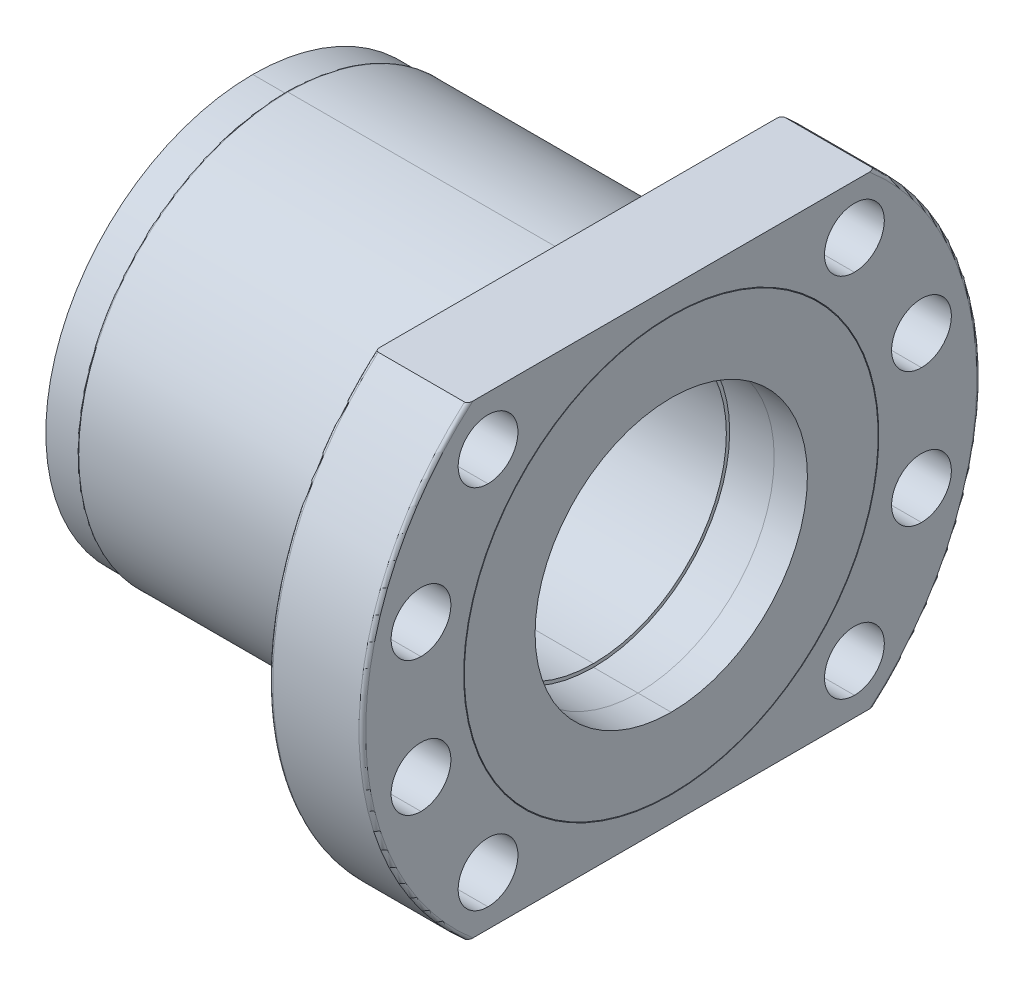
ISO-10303-21;
HEADER;
FILE_DESCRIPTION(('STEP AP214'),'2;1');
FILE_NAME('part.step','',(''),(''),'','','');
FILE_SCHEMA(('AUTOMOTIVE_DESIGN { 1 0 10303 214 1 1 1 1 }'));
ENDSEC;
DATA;
#1=APPLICATION_CONTEXT('core data for automotive mechanical design processes');
#2=APPLICATION_PROTOCOL_DEFINITION('international standard','automotive_design',2000,#1);
#3=PRODUCT_CONTEXT('',#1,'mechanical');
#4=PRODUCT('Part','Part','',(#3));
#5=PRODUCT_RELATED_PRODUCT_CATEGORY('part','',(#4));
#6=PRODUCT_DEFINITION_FORMATION('','',#4);
#7=PRODUCT_DEFINITION_CONTEXT('part definition',#1,'design');
#8=PRODUCT_DEFINITION('design','',#6,#7);
#9=PRODUCT_DEFINITION_SHAPE('','',#8);
#10=(LENGTH_UNIT() NAMED_UNIT(*) SI_UNIT(.MILLI.,.METRE.));
#11=(NAMED_UNIT(*) PLANE_ANGLE_UNIT() SI_UNIT($,.RADIAN.));
#12=(NAMED_UNIT(*) SI_UNIT($,.STERADIAN.) SOLID_ANGLE_UNIT());
#13=UNCERTAINTY_MEASURE_WITH_UNIT(LENGTH_MEASURE(1.E-05),#10,'distance_accuracy_value','');
#14=(GEOMETRIC_REPRESENTATION_CONTEXT(3) GLOBAL_UNCERTAINTY_ASSIGNED_CONTEXT((#13)) GLOBAL_UNIT_ASSIGNED_CONTEXT((#10,
#11,#12)) REPRESENTATION_CONTEXT('',''));
#15=CARTESIAN_POINT('',(0.,0.,0.));
#16=DIRECTION('',(0.,0.,1.));
#17=DIRECTION('',(1.,0.,0.));
#18=AXIS2_PLACEMENT_3D('',#15,#16,#17);
#19=CARTESIAN_POINT('',(0.,0.,0.));
#20=DIRECTION('',(-1.,0.,0.));
#21=DIRECTION('',(0.,-1.,0.));
#22=AXIS2_PLACEMENT_3D('',#19,#20,#21);
#23=CYLINDRICAL_SURFACE('',#22,20.);
#24=DIRECTION('',(-1.,0.,0.));
#25=VECTOR('',#24,1.);
#26=CARTESIAN_POINT('',(0.,20.,0.));
#27=LINE('',#26,#25);
#28=CARTESIAN_POINT('',(-32.8896484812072,20.,0.));
#29=VERTEX_POINT('',#28);
#30=CARTESIAN_POINT('',(-78.8896484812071,20.,0.));
#31=VERTEX_POINT('',#30);
#32=EDGE_CURVE('P0_E337',#29,#31,#27,.T.);
#33=ORIENTED_EDGE('',*,*,#32,.F.);
#34=CARTESIAN_POINT('',(-32.8896484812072,0.,0.));
#35=DIRECTION('',(-1.,0.,0.));
#36=DIRECTION('',(0.,0.,-1.));
#37=AXIS2_PLACEMENT_3D('',#34,#35,#36);
#38=CIRCLE('',#37,20.);
#39=CARTESIAN_POINT('',(-32.8896484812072,-20.,0.));
#40=VERTEX_POINT('',#39);
#41=EDGE_CURVE('P0_E323',#40,#29,#38,.T.);
#42=ORIENTED_EDGE('',*,*,#41,.F.);
#43=DIRECTION('',(-1.,0.,0.));
#44=VECTOR('',#43,1.);
#45=CARTESIAN_POINT('',(0.,-20.,0.));
#46=LINE('',#45,#44);
#47=CARTESIAN_POINT('',(-78.8896484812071,-20.,0.));
#48=VERTEX_POINT('',#47);
#49=EDGE_CURVE('P0_E345',#40,#48,#46,.T.);
#50=ORIENTED_EDGE('',*,*,#49,.T.);
#51=CARTESIAN_POINT('',(-78.8896484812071,0.,0.));
#52=DIRECTION('',(-1.,0.,0.));
#53=DIRECTION('',(0.,0.,-1.));
#54=AXIS2_PLACEMENT_3D('',#51,#52,#53);
#55=CIRCLE('',#54,20.);
#56=EDGE_CURVE('P0_E11',#48,#31,#55,.T.);
#57=ORIENTED_EDGE('',*,*,#56,.T.);
#58=EDGE_LOOP('',(#33,#42,#50,#57));
#59=FACE_BOUND('',#58,.T.);
#60=ADVANCED_FACE('P0_F17',(#59),#23,.F.);
#61=CARTESIAN_POINT('',(-100.,0.,0.));
#62=DIRECTION('',(1.,0.,0.));
#63=DIRECTION('',(0.,1.,0.));
#64=AXIS2_PLACEMENT_3D('',#61,#62,#63);
#65=CYLINDRICAL_SURFACE('',#64,20.5);
#66=CARTESIAN_POINT('',(-32.8896484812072,0.,0.));
#67=DIRECTION('',(1.,0.,0.));
#68=DIRECTION('',(0.,0.,-1.));
#69=AXIS2_PLACEMENT_3D('',#66,#67,#68);
#70=CIRCLE('',#69,20.5);
#71=CARTESIAN_POINT('',(-32.8896484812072,-20.5,0.));
#72=VERTEX_POINT('',#71);
#73=CARTESIAN_POINT('',(-32.8896484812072,20.5,0.));
#74=VERTEX_POINT('',#73);
#75=EDGE_CURVE('P0_E334',#72,#74,#70,.T.);
#76=ORIENTED_EDGE('',*,*,#75,.F.);
#77=DIRECTION('',(1.,0.,0.));
#78=VECTOR('',#77,1.);
#79=CARTESIAN_POINT('',(-100.,-20.5,0.));
#80=LINE('',#79,#78);
#81=CARTESIAN_POINT('',(-26.1896484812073,-20.5,0.));
#82=VERTEX_POINT('',#81);
#83=EDGE_CURVE('P0_E333',#72,#82,#80,.T.);
#84=ORIENTED_EDGE('',*,*,#83,.T.);
#85=CARTESIAN_POINT('',(-26.1896484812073,0.,0.));
#86=DIRECTION('',(-1.,0.,0.));
#87=DIRECTION('',(0.,1.,0.));
#88=AXIS2_PLACEMENT_3D('',#85,#86,#87);
#89=CIRCLE('',#88,20.5);
#90=CARTESIAN_POINT('',(-26.1896484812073,20.5,0.));
#91=VERTEX_POINT('',#90);
#92=EDGE_CURVE('P0_E399',#91,#82,#89,.T.);
#93=ORIENTED_EDGE('',*,*,#92,.F.);
#94=DIRECTION('',(1.,0.,0.));
#95=VECTOR('',#94,1.);
#96=CARTESIAN_POINT('',(-100.,20.5,0.));
#97=LINE('',#96,#95);
#98=EDGE_CURVE('P0_E420',#74,#91,#97,.T.);
#99=ORIENTED_EDGE('',*,*,#98,.F.);
#100=EDGE_LOOP('',(#76,#84,#93,#99));
#101=FACE_BOUND('',#100,.T.);
#102=ADVANCED_FACE('P0_F19',(#101),#65,.F.);
#103=CARTESIAN_POINT('',(-100.,0.,0.));
#104=DIRECTION('',(1.,0.,0.));
#105=DIRECTION('',(0.,1.,0.));
#106=AXIS2_PLACEMENT_3D('',#103,#104,#105);
#107=CYLINDRICAL_SURFACE('',#106,31.25);
#108=CARTESIAN_POINT('',(-26.1896484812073,0.,0.));
#109=DIRECTION('',(1.,0.,0.));
#110=DIRECTION('',(0.,1.,0.));
#111=AXIS2_PLACEMENT_3D('',#108,#109,#110);
#112=CIRCLE('',#111,31.25);
#113=CARTESIAN_POINT('',(-26.1896484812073,-31.25,0.));
#114=VERTEX_POINT('',#113);
#115=CARTESIAN_POINT('',(-26.1896484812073,31.25,0.));
#116=VERTEX_POINT('',#115);
#117=EDGE_CURVE('P0_E395',#114,#116,#112,.T.);
#118=ORIENTED_EDGE('',*,*,#117,.F.);
#119=DIRECTION('',(1.,0.,0.));
#120=VECTOR('',#119,1.);
#121=CARTESIAN_POINT('',(-100.,-31.25,0.));
#122=LINE('',#121,#120);
#123=CARTESIAN_POINT('',(-21.1896484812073,-31.25,0.));
#124=VERTEX_POINT('',#123);
#125=EDGE_CURVE('P0_E386',#114,#124,#122,.T.);
#126=ORIENTED_EDGE('',*,*,#125,.T.);
#127=CARTESIAN_POINT('',(-21.1896484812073,0.,0.));
#128=DIRECTION('',(1.,0.,0.));
#129=DIRECTION('',(0.,1.,0.));
#130=AXIS2_PLACEMENT_3D('',#127,#128,#129);
#131=CIRCLE('',#130,31.25);
#132=CARTESIAN_POINT('',(-21.1896484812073,31.25,0.));
#133=VERTEX_POINT('',#132);
#134=EDGE_CURVE('P0_E379',#124,#133,#131,.T.);
#135=ORIENTED_EDGE('',*,*,#134,.T.);
#136=DIRECTION('',(1.,0.,0.));
#137=VECTOR('',#136,1.);
#138=CARTESIAN_POINT('',(-100.,31.25,0.));
#139=LINE('',#138,#137);
#140=EDGE_CURVE('P0_E381',#116,#133,#139,.T.);
#141=ORIENTED_EDGE('',*,*,#140,.F.);
#142=EDGE_LOOP('',(#118,#126,#135,#141));
#143=FACE_BOUND('',#142,.T.);
#144=ADVANCED_FACE('P0_F985',(#143),#107,.F.);
#145=CARTESIAN_POINT('',(-21.1896484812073,10.0939,37.6711));
#146=DIRECTION('',(-1.,0.,0.));
#147=DIRECTION('',(0.,-1.,0.));
#148=AXIS2_PLACEMENT_3D('',#145,#146,#147);
#149=CYLINDRICAL_SURFACE('',#148,4.5);
#150=CARTESIAN_POINT('',(-21.1896484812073,10.0939,37.6711));
#151=DIRECTION('',(-1.,0.,0.));
#152=DIRECTION('',(0.,-1.,0.));
#153=AXIS2_PLACEMENT_3D('',#150,#151,#152);
#154=CIRCLE('',#153,4.5);
#155=CARTESIAN_POINT('',(-21.1896484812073,14.5939,37.6711));
#156=VERTEX_POINT('',#155);
#157=CARTESIAN_POINT('',(-21.1896484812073,5.5939,37.6711));
#158=VERTEX_POINT('',#157);
#159=EDGE_CURVE('P0_E376',#156,#158,#154,.T.);
#160=ORIENTED_EDGE('',*,*,#159,.F.);
#161=DIRECTION('',(-1.,0.,0.));
#162=VECTOR('',#161,1.);
#163=CARTESIAN_POINT('',(-21.1896484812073,14.5939,37.6711));
#164=LINE('',#163,#162);
#165=CARTESIAN_POINT('',(-35.1896484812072,14.5939,37.6711));
#166=VERTEX_POINT('',#165);
#167=EDGE_CURVE('P0_E551',#156,#166,#164,.T.);
#168=ORIENTED_EDGE('',*,*,#167,.T.);
#169=CARTESIAN_POINT('',(-35.1896484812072,10.0939,37.6711));
#170=DIRECTION('',(1.,0.,0.));
#171=DIRECTION('',(0.,-1.,0.));
#172=AXIS2_PLACEMENT_3D('',#169,#170,#171);
#173=CIRCLE('',#172,4.5);
#174=CARTESIAN_POINT('',(-35.1896484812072,5.5939,37.6711));
#175=VERTEX_POINT('',#174);
#176=EDGE_CURVE('P0_E361',#175,#166,#173,.T.);
#177=ORIENTED_EDGE('',*,*,#176,.F.);
#178=DIRECTION('',(-1.,0.,0.));
#179=VECTOR('',#178,1.);
#180=CARTESIAN_POINT('',(-21.1896484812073,5.5939,37.6711));
#181=LINE('',#180,#179);
#182=EDGE_CURVE('P0_E419',#158,#175,#181,.T.);
#183=ORIENTED_EDGE('',*,*,#182,.F.);
#184=EDGE_LOOP('',(#160,#168,#177,#183));
#185=FACE_BOUND('',#184,.T.);
#186=ADVANCED_FACE('P0_F981',(#185),#149,.F.);
#187=CARTESIAN_POINT('',(-21.1896484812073,-10.0939,37.6711));
#188=DIRECTION('',(-1.,0.,0.));
#189=DIRECTION('',(0.,-1.,0.));
#190=AXIS2_PLACEMENT_3D('',#187,#188,#189);
#191=CYLINDRICAL_SURFACE('',#190,4.5);
#192=CARTESIAN_POINT('',(-21.1896484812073,-10.0939,37.6711));
#193=DIRECTION('',(-1.,0.,0.));
#194=DIRECTION('',(0.,-1.,0.));
#195=AXIS2_PLACEMENT_3D('',#192,#193,#194);
#196=CIRCLE('',#195,4.5);
#197=CARTESIAN_POINT('',(-21.1896484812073,-5.5939,37.6711));
#198=VERTEX_POINT('',#197);
#199=CARTESIAN_POINT('',(-21.1896484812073,-14.5939,37.6711));
#200=VERTEX_POINT('',#199);
#201=EDGE_CURVE('P0_E380',#198,#200,#196,.T.);
#202=ORIENTED_EDGE('',*,*,#201,.F.);
#203=DIRECTION('',(-1.,0.,0.));
#204=VECTOR('',#203,1.);
#205=CARTESIAN_POINT('',(-21.1896484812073,-5.5939,37.6711));
#206=LINE('',#205,#204);
#207=CARTESIAN_POINT('',(-35.1896484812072,-5.5939,37.6711));
#208=VERTEX_POINT('',#207);
#209=EDGE_CURVE('P0_E415',#198,#208,#206,.T.);
#210=ORIENTED_EDGE('',*,*,#209,.T.);
#211=CARTESIAN_POINT('',(-35.1896484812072,-10.0939,37.6711));
#212=DIRECTION('',(1.,0.,0.));
#213=DIRECTION('',(0.,-1.,0.));
#214=AXIS2_PLACEMENT_3D('',#211,#212,#213);
#215=CIRCLE('',#214,4.5);
#216=CARTESIAN_POINT('',(-35.1896484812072,-14.5939,37.6711));
#217=VERTEX_POINT('',#216);
#218=EDGE_CURVE('P0_E362',#217,#208,#215,.T.);
#219=ORIENTED_EDGE('',*,*,#218,.F.);
#220=DIRECTION('',(-1.,0.,0.));
#221=VECTOR('',#220,1.);
#222=CARTESIAN_POINT('',(-21.1896484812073,-14.5939,37.6711));
#223=LINE('',#222,#221);
#224=EDGE_CURVE('P0_E467',#200,#217,#223,.T.);
#225=ORIENTED_EDGE('',*,*,#224,.F.);
#226=EDGE_LOOP('',(#202,#210,#219,#225));
#227=FACE_BOUND('',#226,.T.);
#228=ADVANCED_FACE('P0_F942',(#227),#191,.F.);
#229=CARTESIAN_POINT('',(-21.1896484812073,-10.0939,-37.6711));
#230=DIRECTION('',(-1.,0.,0.));
#231=DIRECTION('',(0.,-1.,0.));
#232=AXIS2_PLACEMENT_3D('',#229,#230,#231);
#233=CYLINDRICAL_SURFACE('',#232,4.5);
#234=CARTESIAN_POINT('',(-21.1896484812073,-10.0939,-37.6711));
#235=DIRECTION('',(-1.,0.,0.));
#236=DIRECTION('',(0.,-1.,0.));
#237=AXIS2_PLACEMENT_3D('',#234,#235,#236);
#238=CIRCLE('',#237,4.5);
#239=CARTESIAN_POINT('',(-21.1896484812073,-5.5939,-37.6711));
#240=VERTEX_POINT('',#239);
#241=CARTESIAN_POINT('',(-21.1896484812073,-14.5939,-37.6711));
#242=VERTEX_POINT('',#241);
#243=EDGE_CURVE('P0_E596',#240,#242,#238,.T.);
#244=ORIENTED_EDGE('',*,*,#243,.F.);
#245=DIRECTION('',(-1.,0.,0.));
#246=VECTOR('',#245,1.);
#247=CARTESIAN_POINT('',(-21.1896484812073,-5.5939,-37.6711));
#248=LINE('',#247,#246);
#249=CARTESIAN_POINT('',(-35.1896484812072,-5.5939,-37.6711));
#250=VERTEX_POINT('',#249);
#251=EDGE_CURVE('P0_E470',#240,#250,#248,.T.);
#252=ORIENTED_EDGE('',*,*,#251,.T.);
#253=CARTESIAN_POINT('',(-35.1896484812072,-10.0939,-37.6711));
#254=DIRECTION('',(1.,0.,0.));
#255=DIRECTION('',(0.,-1.,0.));
#256=AXIS2_PLACEMENT_3D('',#253,#254,#255);
#257=CIRCLE('',#256,4.5);
#258=CARTESIAN_POINT('',(-35.1896484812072,-14.5939,-37.6711));
#259=VERTEX_POINT('',#258);
#260=EDGE_CURVE('P0_E477',#259,#250,#257,.T.);
#261=ORIENTED_EDGE('',*,*,#260,.F.);
#262=DIRECTION('',(-1.,0.,0.));
#263=VECTOR('',#262,1.);
#264=CARTESIAN_POINT('',(-21.1896484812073,-14.5939,-37.6711));
#265=LINE('',#264,#263);
#266=EDGE_CURVE('P0_E564',#242,#259,#265,.T.);
#267=ORIENTED_EDGE('',*,*,#266,.F.);
#268=EDGE_LOOP('',(#244,#252,#261,#267));
#269=FACE_BOUND('',#268,.T.);
#270=ADVANCED_FACE('P0_F938',(#269),#233,.F.);
#271=CARTESIAN_POINT('',(-21.1896484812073,10.0939,-37.6711));
#272=DIRECTION('',(-1.,0.,0.));
#273=DIRECTION('',(0.,-1.,0.));
#274=AXIS2_PLACEMENT_3D('',#271,#272,#273);
#275=CYLINDRICAL_SURFACE('',#274,4.5);
#276=CARTESIAN_POINT('',(-21.1896484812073,10.0939,-37.6711));
#277=DIRECTION('',(-1.,0.,0.));
#278=DIRECTION('',(0.,-1.,0.));
#279=AXIS2_PLACEMENT_3D('',#276,#277,#278);
#280=CIRCLE('',#279,4.5);
#281=CARTESIAN_POINT('',(-21.1896484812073,14.5939,-37.6711));
#282=VERTEX_POINT('',#281);
#283=CARTESIAN_POINT('',(-21.1896484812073,5.5939,-37.6711));
#284=VERTEX_POINT('',#283);
#285=EDGE_CURVE('P0_E527',#282,#284,#280,.T.);
#286=ORIENTED_EDGE('',*,*,#285,.F.);
#287=DIRECTION('',(-1.,0.,0.));
#288=VECTOR('',#287,1.);
#289=CARTESIAN_POINT('',(-21.1896484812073,14.5939,-37.6711));
#290=LINE('',#289,#288);
#291=CARTESIAN_POINT('',(-35.1896484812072,14.5939,-37.6711));
#292=VERTEX_POINT('',#291);
#293=EDGE_CURVE('P0_E531',#282,#292,#290,.T.);
#294=ORIENTED_EDGE('',*,*,#293,.T.);
#295=CARTESIAN_POINT('',(-35.1896484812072,10.0939,-37.6711));
#296=DIRECTION('',(1.,0.,0.));
#297=DIRECTION('',(0.,-1.,0.));
#298=AXIS2_PLACEMENT_3D('',#295,#296,#297);
#299=CIRCLE('',#298,4.5);
#300=CARTESIAN_POINT('',(-35.1896484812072,5.5939,-37.6711));
#301=VERTEX_POINT('',#300);
#302=EDGE_CURVE('P0_E443',#301,#292,#299,.T.);
#303=ORIENTED_EDGE('',*,*,#302,.F.);
#304=DIRECTION('',(-1.,0.,0.));
#305=VECTOR('',#304,1.);
#306=CARTESIAN_POINT('',(-21.1896484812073,5.5939,-37.6711));
#307=LINE('',#306,#305);
#308=EDGE_CURVE('P0_E486',#284,#301,#307,.T.);
#309=ORIENTED_EDGE('',*,*,#308,.F.);
#310=EDGE_LOOP('',(#286,#294,#303,#309));
#311=FACE_BOUND('',#310,.T.);
#312=ADVANCED_FACE('P0_F941',(#311),#275,.F.);
#313=CARTESIAN_POINT('',(-21.1896484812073,-27.5772,-27.5772));
#314=DIRECTION('',(-1.,0.,0.));
#315=DIRECTION('',(0.,-1.,0.));
#316=AXIS2_PLACEMENT_3D('',#313,#314,#315);
#317=CYLINDRICAL_SURFACE('',#316,4.5);
#318=CARTESIAN_POINT('',(-21.1896484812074,-27.5772,-27.5772));
#319=DIRECTION('',(-1.,0.,0.));
#320=DIRECTION('',(0.,-1.,0.));
#321=AXIS2_PLACEMENT_3D('',#318,#319,#320);
#322=CIRCLE('',#321,4.5);
#323=CARTESIAN_POINT('',(-21.1896484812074,-23.0772,-27.5772));
#324=VERTEX_POINT('',#323);
#325=CARTESIAN_POINT('',(-21.1896484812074,-32.0772,-27.5772));
#326=VERTEX_POINT('',#325);
#327=EDGE_CURVE('P0_E460',#324,#326,#322,.T.);
#328=ORIENTED_EDGE('',*,*,#327,.F.);
#329=DIRECTION('',(-1.,0.,0.));
#330=VECTOR('',#329,1.);
#331=CARTESIAN_POINT('',(-21.1896484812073,-23.0772,-27.5772));
#332=LINE('',#331,#330);
#333=CARTESIAN_POINT('',(-35.1896484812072,-23.0772,-27.5772));
#334=VERTEX_POINT('',#333);
#335=EDGE_CURVE('P0_E489',#324,#334,#332,.T.);
#336=ORIENTED_EDGE('',*,*,#335,.T.);
#337=CARTESIAN_POINT('',(-35.1896484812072,-27.5772,-27.5772));
#338=DIRECTION('',(1.,0.,0.));
#339=DIRECTION('',(0.,-1.,0.));
#340=AXIS2_PLACEMENT_3D('',#337,#338,#339);
#341=CIRCLE('',#340,4.5);
#342=CARTESIAN_POINT('',(-35.1896484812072,-32.0772,-27.5772));
#343=VERTEX_POINT('',#342);
#344=EDGE_CURVE('P0_E502',#343,#334,#341,.T.);
#345=ORIENTED_EDGE('',*,*,#344,.F.);
#346=DIRECTION('',(-1.,0.,0.));
#347=VECTOR('',#346,1.);
#348=CARTESIAN_POINT('',(-21.1896484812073,-32.0772,-27.5772));
#349=LINE('',#348,#347);
#350=EDGE_CURVE('P0_E543',#326,#343,#349,.T.);
#351=ORIENTED_EDGE('',*,*,#350,.F.);
#352=EDGE_LOOP('',(#328,#336,#345,#351));
#353=FACE_BOUND('',#352,.T.);
#354=ADVANCED_FACE('P0_F972',(#353),#317,.F.);
#355=CARTESIAN_POINT('',(-21.1896484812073,27.5772,-27.5772));
#356=DIRECTION('',(-1.,0.,0.));
#357=DIRECTION('',(0.,-1.,0.));
#358=AXIS2_PLACEMENT_3D('',#355,#356,#357);
#359=CYLINDRICAL_SURFACE('',#358,4.5);
#360=CARTESIAN_POINT('',(-21.1896484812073,27.5772,-27.5772));
#361=DIRECTION('',(-1.,0.,0.));
#362=DIRECTION('',(0.,-1.,0.));
#363=AXIS2_PLACEMENT_3D('',#360,#361,#362);
#364=CIRCLE('',#363,4.5);
#365=CARTESIAN_POINT('',(-21.1896484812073,32.0772,-27.5772));
#366=VERTEX_POINT('',#365);
#367=CARTESIAN_POINT('',(-21.1896484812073,23.0772,-27.5772));
#368=VERTEX_POINT('',#367);
#369=EDGE_CURVE('P0_E457',#366,#368,#364,.T.);
#370=ORIENTED_EDGE('',*,*,#369,.F.);
#371=DIRECTION('',(-1.,0.,0.));
#372=VECTOR('',#371,1.);
#373=CARTESIAN_POINT('',(-21.1896484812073,32.0772,-27.5772));
#374=LINE('',#373,#372);
#375=CARTESIAN_POINT('',(-35.1896484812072,32.0772,-27.5772));
#376=VERTEX_POINT('',#375);
#377=EDGE_CURVE('P0_E546',#366,#376,#374,.T.);
#378=ORIENTED_EDGE('',*,*,#377,.T.);
#379=CARTESIAN_POINT('',(-35.1896484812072,27.5772,-27.5772));
#380=DIRECTION('',(1.,0.,0.));
#381=DIRECTION('',(0.,-1.,0.));
#382=AXIS2_PLACEMENT_3D('',#379,#380,#381);
#383=CIRCLE('',#382,4.5);
#384=CARTESIAN_POINT('',(-35.1896484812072,23.0772,-27.5772));
#385=VERTEX_POINT('',#384);
#386=EDGE_CURVE('P0_E494',#385,#376,#383,.T.);
#387=ORIENTED_EDGE('',*,*,#386,.F.);
#388=DIRECTION('',(-1.,0.,0.));
#389=VECTOR('',#388,1.);
#390=CARTESIAN_POINT('',(-21.1896484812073,23.0772,-27.5772));
#391=LINE('',#390,#389);
#392=EDGE_CURVE('P0_E508',#368,#385,#391,.T.);
#393=ORIENTED_EDGE('',*,*,#392,.F.);
#394=EDGE_LOOP('',(#370,#378,#387,#393));
#395=FACE_BOUND('',#394,.T.);
#396=ADVANCED_FACE('P0_F970',(#395),#359,.F.);
#397=CARTESIAN_POINT('',(-21.1896484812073,-27.5772,27.5772));
#398=DIRECTION('',(-1.,0.,0.));
#399=DIRECTION('',(0.,-1.,0.));
#400=AXIS2_PLACEMENT_3D('',#397,#398,#399);
#401=CYLINDRICAL_SURFACE('',#400,4.5);
#402=CARTESIAN_POINT('',(-21.1896484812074,-27.5772,27.5772));
#403=DIRECTION('',(-1.,0.,0.));
#404=DIRECTION('',(0.,-1.,0.));
#405=AXIS2_PLACEMENT_3D('',#402,#403,#404);
#406=CIRCLE('',#405,4.5);
#407=CARTESIAN_POINT('',(-21.1896484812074,-23.0772,27.5772));
#408=VERTEX_POINT('',#407);
#409=CARTESIAN_POINT('',(-21.1896484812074,-32.0772,27.5772));
#410=VERTEX_POINT('',#409);
#411=EDGE_CURVE('P0_E461',#408,#410,#406,.T.);
#412=ORIENTED_EDGE('',*,*,#411,.F.);
#413=DIRECTION('',(-1.,0.,0.));
#414=VECTOR('',#413,1.);
#415=CARTESIAN_POINT('',(-21.1896484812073,-23.0772,27.5772));
#416=LINE('',#415,#414);
#417=CARTESIAN_POINT('',(-35.1896484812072,-23.0772,27.5772));
#418=VERTEX_POINT('',#417);
#419=EDGE_CURVE('P0_E511',#408,#418,#416,.T.);
#420=ORIENTED_EDGE('',*,*,#419,.T.);
#421=CARTESIAN_POINT('',(-35.1896484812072,-27.5772,27.5772));
#422=DIRECTION('',(1.,0.,0.));
#423=DIRECTION('',(0.,-1.,0.));
#424=AXIS2_PLACEMENT_3D('',#421,#422,#423);
#425=CIRCLE('',#424,4.5);
#426=CARTESIAN_POINT('',(-35.1896484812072,-32.0772,27.5772));
#427=VERTEX_POINT('',#426);
#428=EDGE_CURVE('P0_E404',#427,#418,#425,.T.);
#429=ORIENTED_EDGE('',*,*,#428,.F.);
#430=DIRECTION('',(-1.,0.,0.));
#431=VECTOR('',#430,1.);
#432=CARTESIAN_POINT('',(-21.1896484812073,-32.0772,27.5772));
#433=LINE('',#432,#431);
#434=EDGE_CURVE('P0_E585',#410,#427,#433,.T.);
#435=ORIENTED_EDGE('',*,*,#434,.F.);
#436=EDGE_LOOP('',(#412,#420,#429,#435));
#437=FACE_BOUND('',#436,.T.);
#438=ADVANCED_FACE('P0_F966',(#437),#401,.F.);
#439=CARTESIAN_POINT('',(-21.1896484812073,27.5772,27.5772));
#440=DIRECTION('',(-1.,0.,0.));
#441=DIRECTION('',(0.,-1.,0.));
#442=AXIS2_PLACEMENT_3D('',#439,#440,#441);
#443=CYLINDRICAL_SURFACE('',#442,4.5);
#444=CARTESIAN_POINT('',(-21.1896484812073,27.5772,27.5772));
#445=DIRECTION('',(-1.,0.,0.));
#446=DIRECTION('',(0.,-1.,0.));
#447=AXIS2_PLACEMENT_3D('',#444,#445,#446);
#448=CIRCLE('',#447,4.5);
#449=CARTESIAN_POINT('',(-21.1896484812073,32.0772,27.5772));
#450=VERTEX_POINT('',#449);
#451=CARTESIAN_POINT('',(-21.1896484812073,23.0772,27.5772));
#452=VERTEX_POINT('',#451);
#453=EDGE_CURVE('P0_E597',#450,#452,#448,.T.);
#454=ORIENTED_EDGE('',*,*,#453,.F.);
#455=DIRECTION('',(-1.,0.,0.));
#456=VECTOR('',#455,1.);
#457=CARTESIAN_POINT('',(-21.1896484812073,32.0772,27.5772));
#458=LINE('',#457,#456);
#459=CARTESIAN_POINT('',(-35.1896484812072,32.0772,27.5772));
#460=VERTEX_POINT('',#459);
#461=EDGE_CURVE('P0_E588',#450,#460,#458,.T.);
#462=ORIENTED_EDGE('',*,*,#461,.T.);
#463=CARTESIAN_POINT('',(-35.1896484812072,27.5772,27.5772));
#464=DIRECTION('',(1.,0.,0.));
#465=DIRECTION('',(0.,-1.,0.));
#466=AXIS2_PLACEMENT_3D('',#463,#464,#465);
#467=CIRCLE('',#466,4.5);
#468=CARTESIAN_POINT('',(-35.1896484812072,23.0772,27.5772));
#469=VERTEX_POINT('',#468);
#470=EDGE_CURVE('P0_E389',#469,#460,#467,.T.);
#471=ORIENTED_EDGE('',*,*,#470,.F.);
#472=DIRECTION('',(-1.,0.,0.));
#473=VECTOR('',#472,1.);
#474=CARTESIAN_POINT('',(-21.1896484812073,23.0772,27.5772));
#475=LINE('',#474,#473);
#476=EDGE_CURVE('P0_E538',#452,#469,#475,.T.);
#477=ORIENTED_EDGE('',*,*,#476,.F.);
#478=EDGE_LOOP('',(#454,#462,#471,#477));
#479=FACE_BOUND('',#478,.T.);
#480=ADVANCED_FACE('P0_F962',(#479),#443,.F.);
#481=CARTESIAN_POINT('',(-78.8896484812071,0.,0.));
#482=DIRECTION('',(1.,0.,0.));
#483=DIRECTION('',(0.,1.,0.));
#484=AXIS2_PLACEMENT_3D('',#481,#482,#483);
#485=TOROIDAL_SURFACE('',#484,31.2,0.299999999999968);
#486=CARTESIAN_POINT('',(-79.1896484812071,31.1999999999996,3.48713869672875E-06));
#487=CARTESIAN_POINT('',(-79.1896484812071,31.1999996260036,3.34620893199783));
#488=CARTESIAN_POINT('',(-79.1896484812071,30.6570814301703,6.69181956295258));
#489=CARTESIAN_POINT('',(-79.1896484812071,29.0698364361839,11.4535532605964));
#490=CARTESIAN_POINT('',(-79.1896484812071,28.4128118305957,12.9981305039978));
#491=CARTESIAN_POINT('',(-79.1896484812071,27.2480644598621,15.2211300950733));
#492=CARTESIAN_POINT('',(-79.1896484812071,26.8299974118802,15.9465061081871));
#493=CARTESIAN_POINT('',(-79.1896484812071,26.1601967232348,17.0076177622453));
#494=CARTESIAN_POINT('',(-79.1896484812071,25.8146257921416,17.5314380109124));
#495=CARTESIAN_POINT('',(-79.1896484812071,25.3932754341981,18.1300333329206));
#496=CARTESIAN_POINT('',(-79.1896484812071,25.1781186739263,18.4261085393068));
#497=CARTESIAN_POINT('',(-79.1896484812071,25.0694280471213,18.5733293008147));
#498=CARTESIAN_POINT('',(-79.1896484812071,25.0148057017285,18.6467340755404));
#499=CARTESIAN_POINT('',(-79.1896484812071,24.9874254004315,18.6833848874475));
#500=CARTESIAN_POINT('',(-79.1896484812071,24.9756761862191,18.6990813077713));
#501=CARTESIAN_POINT('',(-79.1896484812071,24.9678400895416,18.7095431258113));
#502=CARTESIAN_POINT('',(-79.1896484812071,24.9651122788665,18.7131836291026));
#503=CARTESIAN_POINT('',(-79.1896484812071,24.6327347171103,19.1563536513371));
#504=CARTESIAN_POINT('',(-79.1896484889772,24.2940942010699,19.584096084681));
#505=CARTESIAN_POINT('',(-79.1896484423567,23.7697723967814,20.2119297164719));
#506=CARTESIAN_POINT('',(-79.1896484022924,23.5035219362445,20.5224021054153));
#507=CARTESIAN_POINT('',(-79.189648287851,23.1859008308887,20.8784090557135));
#508=CARTESIAN_POINT('',(-79.1896482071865,23.0253620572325,21.0548374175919));
#509=CARTESIAN_POINT('',(-79.1896481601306,22.9446632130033,21.1426550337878));
#510=CARTESIAN_POINT('',(-79.189648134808,22.9042067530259,21.1864643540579));
#511=CARTESIAN_POINT('',(-79.1896481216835,22.8839518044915,21.2083440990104));
#512=CARTESIAN_POINT('',(-79.1896481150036,22.8738176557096,21.2192777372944));
#513=CARTESIAN_POINT('',(-79.1896481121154,22.8694730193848,21.2239622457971));
#514=CARTESIAN_POINT('',(-79.1896481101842,22.8665762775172,21.2270849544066));
#515=CARTESIAN_POINT('',(-79.1896481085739,22.864170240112,21.2296779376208));
#516=CARTESIAN_POINT('',(-79.1896480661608,22.8009078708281,21.2978473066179));
#517=CARTESIAN_POINT('',(-79.189648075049,22.6768355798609,21.4314295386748));
#518=CARTESIAN_POINT('',(-79.1896481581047,22.3936466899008,21.7258055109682));
#519=CARTESIAN_POINT('',(-79.1896481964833,22.2830182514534,21.8395466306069));
#520=CARTESIAN_POINT('',(-79.1896482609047,22.0916419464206,22.032482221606));
#521=CARTESIAN_POINT('',(-79.1896482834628,22.0236079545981,22.1005112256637));
#522=CARTESIAN_POINT('',(-79.1896483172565,21.9150330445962,22.2079603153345));
#523=CARTESIAN_POINT('',(-79.189648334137,21.8591143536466,22.2630359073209));
#524=CARTESIAN_POINT('',(-79.1896483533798,21.7909833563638,22.3296141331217));
#525=CARTESIAN_POINT('',(-79.1896483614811,21.7611603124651,22.3586408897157));
#526=CARTESIAN_POINT('',(-79.1896483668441,21.7411391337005,22.3781011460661));
#527=CARTESIAN_POINT('',(-79.1896483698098,21.7298935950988,22.3890154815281));
#528=CARTESIAN_POINT('',(-79.1896484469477,21.4334087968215,22.6764150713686));
#529=CARTESIAN_POINT('',(-79.1896484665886,21.1864173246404,22.9053862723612));
#530=CARTESIAN_POINT('',(-79.1896484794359,20.8832312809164,23.1808482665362));
#531=CARTESIAN_POINT('',(-79.1896484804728,20.7933563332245,23.2613144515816));
#532=CARTESIAN_POINT('',(-79.189648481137,20.6758883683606,23.3655920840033));
#533=CARTESIAN_POINT('',(-79.18964848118,20.6396214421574,23.3976127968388));
#534=CARTESIAN_POINT('',(-79.1896484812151,20.5729399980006,23.4562597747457));
#535=CARTESIAN_POINT('',(-79.1896484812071,20.5415787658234,23.4837122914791));
#536=CARTESIAN_POINT('',(-79.1896484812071,20.4090246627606,23.5993998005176));
#537=CARTESIAN_POINT('',(-79.1896484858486,20.2439523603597,23.7426282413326));
#538=CARTESIAN_POINT('',(-79.1896484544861,19.9030750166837,24.0278525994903));
#539=CARTESIAN_POINT('',(-79.189648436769,19.77387072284,24.1346146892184));
#540=CARTESIAN_POINT('',(-79.1896483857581,19.5558250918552,24.3111796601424));
#541=CARTESIAN_POINT('',(-79.1896483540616,19.4407397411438,24.4035632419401));
#542=CARTESIAN_POINT('',(-79.1896483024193,19.2956462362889,24.5182310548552));
#543=CARTESIAN_POINT('',(-79.1896482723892,19.2203635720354,24.5772468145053));
#544=CARTESIAN_POINT('',(-79.1896482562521,19.1820345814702,24.6071700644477));
#545=CARTESIAN_POINT('',(-79.1896482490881,19.1654601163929,24.6200827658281));
#546=CARTESIAN_POINT('',(-79.1896482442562,19.1543775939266,24.6287108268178));
#547=CARTESIAN_POINT('',(-79.1896482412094,19.1474609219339,24.6340911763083));
#548=CARTESIAN_POINT('',(-79.1896481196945,18.8734994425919,24.8470805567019));
#549=CARTESIAN_POINT('',(-79.1896479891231,18.6185993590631,25.0381514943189));
#550=CARTESIAN_POINT('',(-79.1896478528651,18.2606202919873,25.2992074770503));
#551=CARTESIAN_POINT('',(-79.1896478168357,18.1453512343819,25.3819652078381));
#552=CARTESIAN_POINT('',(-79.1896477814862,17.9787574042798,25.4999872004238));
#553=CARTESIAN_POINT('',(-79.1896477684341,17.8970375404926,25.5574692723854));
#554=CARTESIAN_POINT('',(-79.1896477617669,17.8045025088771,25.6219136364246));
#555=CARTESIAN_POINT('',(-79.1896477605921,17.7589415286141,25.6534882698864));
#556=CARTESIAN_POINT('',(-79.1896477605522,17.7395673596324,25.6668822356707));
#557=CARTESIAN_POINT('',(-79.1896477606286,17.7266850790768,25.6757809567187));
#558=CARTESIAN_POINT('',(-79.1896477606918,17.7214679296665,25.6793825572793));
#559=CARTESIAN_POINT('',(-79.1896477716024,17.226524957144,26.0207225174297));
#560=CARTESIAN_POINT('',(-79.189647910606,16.7296856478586,26.3428350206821));
#561=CARTESIAN_POINT('',(-79.1896481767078,15.9713926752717,26.8042730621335));
#562=CARTESIAN_POINT('',(-79.1896483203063,15.5889883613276,27.029560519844));
#563=CARTESIAN_POINT('',(-79.1896484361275,15.1374251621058,27.2827349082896));
#564=CARTESIAN_POINT('',(-79.1896484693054,14.9103223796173,27.4068882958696));
#565=CARTESIAN_POINT('',(-79.1896484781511,14.7964450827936,27.4683542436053));
#566=CARTESIAN_POINT('',(-79.189648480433,14.7394255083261,27.4989342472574));
#567=CARTESIAN_POINT('',(-79.1896484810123,14.7108955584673,27.5141859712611));
#568=CARTESIAN_POINT('',(-79.1896484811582,14.6966255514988,27.5218022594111));
#569=CARTESIAN_POINT('',(-79.1896484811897,14.690508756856,27.5250643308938));
#570=CARTESIAN_POINT('',(-79.1896484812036,14.6864306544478,27.5272385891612));
#571=CARTESIAN_POINT('',(-79.1896484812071,14.6825507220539,27.5293063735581));
#572=CARTESIAN_POINT('',(-79.1896484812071,14.5810519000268,27.5833918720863));
#573=CARTESIAN_POINT('',(-79.1896484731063,14.2254783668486,27.7768487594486));
#574=CARTESIAN_POINT('',(-79.1896484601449,12.9756752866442,28.3821566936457));
#575=CARTESIAN_POINT('',(-79.1896484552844,12.080443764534,28.7944070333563));
#576=CARTESIAN_POINT('',(-79.1896484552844,9.69280794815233,29.6834039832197));
#577=CARTESIAN_POINT('',(-79.1896484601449,8.19843214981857,30.1604674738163));
#578=CARTESIAN_POINT('',(-79.1896484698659,5.47711155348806,30.7293811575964));
#579=CARTESIAN_POINT('',(-79.1896484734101,4.49036106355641,30.8936987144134));
#580=CARTESIAN_POINT('',(-79.1896484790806,2.36010631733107,31.1290187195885));
#581=CARTESIAN_POINT('',(-79.1896484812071,1.21649721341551,31.1999791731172));
#582=CARTESIAN_POINT('',(-79.1896484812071,-0.00237491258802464,31.2000000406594));
#583=CARTESIAN_POINT('',(-79.1896484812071,-0.00248751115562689,31.1999999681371));
#584=CARTESIAN_POINT('',(-79.1896484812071,-0.00497557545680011,31.1999997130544));
#585=CARTESIAN_POINT('',(-79.1896484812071,-0.00870767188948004,31.1999991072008));
#586=CARTESIAN_POINT('',(-79.189648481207,-0.0174158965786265,31.1999961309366));
#587=CARTESIAN_POINT('',(-79.1896484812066,-0.0348323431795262,31.1999839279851));
#588=CARTESIAN_POINT('',(-79.1896484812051,-0.069665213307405,31.1999345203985));
#589=CARTESIAN_POINT('',(-79.1896484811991,-0.139330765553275,31.1997356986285));
#590=CARTESIAN_POINT('',(-79.1896484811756,-0.278660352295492,31.1989380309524));
#591=CARTESIAN_POINT('',(-79.1896484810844,-0.557307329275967,31.1957426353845));
#592=CARTESIAN_POINT('',(-79.189648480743,-1.11450349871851,31.1829521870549));
#593=CARTESIAN_POINT('',(-79.1896484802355,-1.59176457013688,31.1610211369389));
#594=CARTESIAN_POINT('',(-79.1896484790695,-2.54539160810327,31.1025557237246));
#595=CARTESIAN_POINT('',(-79.189648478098,-3.17994904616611,31.0441031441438));
#596=CARTESIAN_POINT('',(-79.189648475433,-5.07647060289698,30.8106471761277));
#597=CARTESIAN_POINT('',(-79.1896484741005,-6.33126970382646,30.5774737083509));
#598=CARTESIAN_POINT('',(-79.1896484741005,-10.0388388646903,29.6505815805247));
#599=CARTESIAN_POINT('',(-79.1896484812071,-12.4343322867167,28.728405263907));
#600=CARTESIAN_POINT('',(-79.1896484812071,-14.6845464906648,27.5282418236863));
#601=CARTESIAN_POINT('',(-79.1896484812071,-14.6834078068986,27.5288491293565));
#602=CARTESIAN_POINT('',(-79.1896484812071,-14.6844786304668,27.5282779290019));
#603=CARTESIAN_POINT('',(-79.1896484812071,-14.6861003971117,27.5274127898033));
#604=CARTESIAN_POINT('',(-79.1896484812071,-14.689993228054,27.5253357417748));
#605=CARTESIAN_POINT('',(-79.1896484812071,-14.6982136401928,27.5209479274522));
#606=CARTESIAN_POINT('',(-79.1896484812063,-14.716392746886,27.5112360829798));
#607=CARTESIAN_POINT('',(-79.1896484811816,-14.7596976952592,27.4880556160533));
#608=CARTESIAN_POINT('',(-79.1896484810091,-14.8087008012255,27.4617014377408));
#609=CARTESIAN_POINT('',(-79.1896484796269,-14.9224612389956,27.4001768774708));
#610=CARTESIAN_POINT('',(-79.1896484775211,-15.0193181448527,27.3474233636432));
#611=CARTESIAN_POINT('',(-79.1896484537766,-15.3718195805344,27.1519452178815));
#612=CARTESIAN_POINT('',(-79.1896484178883,-15.6896032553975,26.9722680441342));
#613=CARTESIAN_POINT('',(-79.1896482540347,-16.1837336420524,26.6751414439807));
#614=CARTESIAN_POINT('',(-79.1896482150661,-16.2873884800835,26.612068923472));
#615=CARTESIAN_POINT('',(-79.1896481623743,-16.4093013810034,26.5368117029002));
#616=CARTESIAN_POINT('',(-79.1896481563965,-16.4229208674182,26.5283900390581));
#617=CARTESIAN_POINT('',(-79.1896481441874,-16.4503065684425,26.5114264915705));
#618=CARTESIAN_POINT('',(-79.1896481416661,-16.4558869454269,26.5079620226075));
#619=CARTESIAN_POINT('',(-79.1896481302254,-16.4814170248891,26.4921107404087));
#620=CARTESIAN_POINT('',(-79.1896481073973,-16.5323339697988,26.4604286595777));
#621=CARTESIAN_POINT('',(-79.1896480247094,-16.7174574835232,26.3444940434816));
#622=CARTESIAN_POINT('',(-79.1896479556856,-16.8810085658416,26.2398528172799));
#623=CARTESIAN_POINT('',(-79.1896478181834,-17.2645847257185,25.9905098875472));
#624=CARTESIAN_POINT('',(-79.1896477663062,-17.5083732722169,25.8266814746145));
#625=CARTESIAN_POINT('',(-79.1896477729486,-17.8568142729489,25.5858319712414));
#626=CARTESIAN_POINT('',(-79.1896477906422,-17.9842469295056,25.4964293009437));
#627=CARTESIAN_POINT('',(-79.1896478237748,-18.1081118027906,25.4081829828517));
#628=CARTESIAN_POINT('',(-79.1896478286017,-18.125260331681,25.3959446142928));
#629=CARTESIAN_POINT('',(-79.1896478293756,-18.1279721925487,25.3940081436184));
#630=CARTESIAN_POINT('',(-79.1896478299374,-18.1298911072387,25.3926378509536));
#631=CARTESIAN_POINT('',(-79.189647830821,-18.1328271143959,25.3905409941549));
#632=CARTESIAN_POINT('',(-79.1896478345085,-18.1442262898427,25.3823966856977));
#633=CARTESIAN_POINT('',(-79.1896478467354,-18.1761608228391,25.3595513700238));
#634=CARTESIAN_POINT('',(-79.1896478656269,-18.2166706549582,25.3304635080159));
#635=CARTESIAN_POINT('',(-79.1896479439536,-18.3760487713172,25.2154918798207));
#636=CARTESIAN_POINT('',(-79.1896480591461,-18.5817269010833,25.0662020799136));
#637=CARTESIAN_POINT('',(-79.1896482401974,-19.0010751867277,24.7478043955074));
#638=CARTESIAN_POINT('',(-79.189648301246,-19.1592763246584,24.6258621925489));
#639=CARTESIAN_POINT('',(-79.1896483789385,-19.4228794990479,24.4176134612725));
#640=CARTESIAN_POINT('',(-79.1896484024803,-19.5151269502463,24.343970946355));
#641=CARTESIAN_POINT('',(-79.1896484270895,-19.6357425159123,24.2464395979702));
#642=CARTESIAN_POINT('',(-79.1896484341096,-19.6723250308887,24.2167692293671));
#643=CARTESIAN_POINT('',(-79.1896484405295,-19.7094992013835,24.1864766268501));
#644=CARTESIAN_POINT('',(-79.1896484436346,-19.7281844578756,24.1712261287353));
#645=CARTESIAN_POINT('',(-79.1896484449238,-19.736136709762,24.1647291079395));
#646=CARTESIAN_POINT('',(-79.1896484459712,-19.7426916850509,24.1593711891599));
#647=CARTESIAN_POINT('',(-79.189648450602,-19.7721946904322,24.1352460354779));
#648=CARTESIAN_POINT('',(-79.1896484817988,-20.011905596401,23.9385035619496));
#649=CARTESIAN_POINT('',(-79.1896484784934,-20.4644809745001,23.5560663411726));
#650=CARTESIAN_POINT('',(-79.1896484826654,-20.898879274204,23.1682547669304));
#651=CARTESIAN_POINT('',(-79.1896484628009,-21.1451218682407,22.9419217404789));
#652=CARTESIAN_POINT('',(-79.1896484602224,-21.1725084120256,22.9166598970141));
#653=CARTESIAN_POINT('',(-79.1896484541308,-21.2273322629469,22.8659075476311));
#654=CARTESIAN_POINT('',(-79.1896484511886,-21.2509267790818,22.8439851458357));
#655=CARTESIAN_POINT('',(-79.1896484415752,-21.3257110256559,22.7742915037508));
#656=CARTESIAN_POINT('',(-79.1896484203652,-21.4748214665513,22.6344131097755));
#657=CARTESIAN_POINT('',(-79.1896483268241,-22.0164862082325,22.1161572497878));
#658=CARTESIAN_POINT('',(-79.1896482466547,-22.4933165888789,21.6289469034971));
#659=CARTESIAN_POINT('',(-79.1896482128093,-23.60619119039,20.4304107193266));
#660=CARTESIAN_POINT('',(-79.1896484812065,-24.3060521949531,19.5923863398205));
#661=CARTESIAN_POINT('',(-79.1896484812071,-24.9612754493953,18.7182985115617));
#662=CARTESIAN_POINT('',(-79.1896484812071,-24.9601970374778,18.7197371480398));
#663=CARTESIAN_POINT('',(-79.1896484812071,-24.9604050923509,18.7194596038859));
#664=CARTESIAN_POINT('',(-79.189648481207,-24.9607280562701,18.7190287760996));
#665=CARTESIAN_POINT('',(-79.1896484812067,-24.961557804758,18.7179219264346));
#666=CARTESIAN_POINT('',(-79.1896484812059,-24.9635219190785,18.7153018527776));
#667=CARTESIAN_POINT('',(-79.1896484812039,-24.9686681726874,18.7084358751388));
#668=CARTESIAN_POINT('',(-79.1896484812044,-24.9838280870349,18.6881970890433));
#669=CARTESIAN_POINT('',(-79.1896484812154,-25.0051463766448,18.6596799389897));
#670=CARTESIAN_POINT('',(-79.1896484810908,-25.058780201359,18.5876772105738));
#671=CARTESIAN_POINT('',(-79.189648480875,-25.1092172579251,18.519730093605));
#672=CARTESIAN_POINT('',(-79.189648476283,-25.3031084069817,18.2549819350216));
#673=CARTESIAN_POINT('',(-79.1896484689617,-25.4894526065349,17.9974480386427));
#674=CARTESIAN_POINT('',(-79.1896484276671,-25.7843710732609,17.5678198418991));
#675=CARTESIAN_POINT('',(-79.1896484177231,-25.8464299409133,17.4764951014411));
#676=CARTESIAN_POINT('',(-79.1896484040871,-25.919518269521,17.367561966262));
#677=CARTESIAN_POINT('',(-79.1896484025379,-25.927684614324,17.3553722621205));
#678=CARTESIAN_POINT('',(-79.1896484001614,-25.9400017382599,17.3369583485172));
#679=CARTESIAN_POINT('',(-79.1896483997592,-25.9420656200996,17.3338698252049));
#680=CARTESIAN_POINT('',(-79.1896483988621,-25.9466916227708,17.3269466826));
#681=CARTESIAN_POINT('',(-79.1896483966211,-25.9582471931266,17.3096454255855));
#682=CARTESIAN_POINT('',(-79.1896483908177,-25.9881691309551,17.2647480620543));
#683=CARTESIAN_POINT('',(-79.1896483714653,-26.0884520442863,17.1134891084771));
#684=CARTESIAN_POINT('',(-79.1896483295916,-26.3177384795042,16.7615497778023));
#685=CARTESIAN_POINT('',(-79.1896483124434,-26.5127995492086,16.4495365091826));
#686=CARTESIAN_POINT('',(-79.189648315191,-26.6975379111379,16.1466760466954));
#687=CARTESIAN_POINT('',(-79.1896483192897,-26.7573965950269,16.047247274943));
#688=CARTESIAN_POINT('',(-79.1896483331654,-26.8737909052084,15.8515276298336));
#689=CARTESIAN_POINT('',(-79.1896483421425,-26.9364661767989,15.74481755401));
#690=CARTESIAN_POINT('',(-79.1896483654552,-27.1172743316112,15.4326841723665));
#691=CARTESIAN_POINT('',(-79.1896484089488,-27.4716719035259,14.8042374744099));
#692=CARTESIAN_POINT('',(-79.1896484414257,-27.8041245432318,14.1637528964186));
#693=CARTESIAN_POINT('',(-79.1896484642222,-28.1215918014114,13.5159280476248));
#694=CARTESIAN_POINT('',(-79.1896484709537,-28.2378326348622,13.271617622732));
#695=CARTESIAN_POINT('',(-79.1896484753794,-28.3508779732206,13.0258325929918));
#696=CARTESIAN_POINT('',(-79.1896484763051,-28.3759201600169,12.9711775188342));
#697=CARTESIAN_POINT('',(-79.1896484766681,-28.3867800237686,12.9473834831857));
#698=CARTESIAN_POINT('',(-79.1896484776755,-28.4210366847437,12.8720860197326));
#699=CARTESIAN_POINT('',(-79.1896484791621,-28.4891518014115,12.7213111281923));
#700=CARTESIAN_POINT('',(-79.1896484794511,-28.7345169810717,12.1665134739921));
#701=CARTESIAN_POINT('',(-79.1896484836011,-28.9442088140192,11.6563631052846));
#702=CARTESIAN_POINT('',(-79.1896484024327,-29.4213639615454,10.4219792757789));
#703=CARTESIAN_POINT('',(-79.1896484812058,-29.7050543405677,9.58381588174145));
#704=CARTESIAN_POINT('',(-79.1896484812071,-29.9524813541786,8.73434741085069));
#705=CARTESIAN_POINT('',(-79.1896484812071,-29.9520868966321,8.7357016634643));
#706=CARTESIAN_POINT('',(-79.1896484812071,-29.9521750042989,8.73539916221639));
#707=CARTESIAN_POINT('',(-79.1896484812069,-29.9523082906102,8.73494154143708));
#708=CARTESIAN_POINT('',(-79.1896484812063,-29.9526271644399,8.73384667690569));
#709=CARTESIAN_POINT('',(-79.1896484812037,-29.9532963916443,8.73154861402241));
#710=CARTESIAN_POINT('',(-79.1896484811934,-29.9547606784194,8.72651912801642));
#711=CARTESIAN_POINT('',(-79.1896484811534,-29.9581918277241,8.71472649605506));
#712=CARTESIAN_POINT('',(-79.189648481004,-29.967057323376,8.68420453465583));
#713=CARTESIAN_POINT('',(-79.1896484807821,-29.9780622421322,8.64614318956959));
#714=CARTESIAN_POINT('',(-79.1896484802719,-30.0044928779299,8.55411978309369));
#715=CARTESIAN_POINT('',(-79.1896484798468,-30.0280246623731,8.47157405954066));
#716=CARTESIAN_POINT('',(-79.1896484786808,-30.1147789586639,8.15991014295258));
#717=CARTESIAN_POINT('',(-79.1896484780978,-30.1944381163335,7.86680670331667));
#718=CARTESIAN_POINT('',(-79.1896484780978,-30.3824221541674,7.10627644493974));
#719=CARTESIAN_POINT('',(-79.1896484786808,-30.4907571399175,6.63879437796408));
#720=CARTESIAN_POINT('',(-79.1896484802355,-30.7121165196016,5.52509357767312));
#721=CARTESIAN_POINT('',(-79.1896484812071,-30.8251469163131,4.87879337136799));
#722=CARTESIAN_POINT('',(-79.1896484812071,-30.9242786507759,4.13871983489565));
#723=CARTESIAN_POINT('',(-79.1896484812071,-30.9242523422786,4.13891557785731));
#724=CARTESIAN_POINT('',(-79.1896484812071,-30.9246110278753,4.1362351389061));
#725=CARTESIAN_POINT('',(-79.1896484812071,-30.9251487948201,4.13221444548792));
#726=CARTESIAN_POINT('',(-79.1896484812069,-30.9264017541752,4.12283258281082));
#727=CARTESIAN_POINT('',(-79.1896484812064,-30.9289003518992,4.10406788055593));
#728=CARTESIAN_POINT('',(-79.1896484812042,-30.933868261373,4.06653458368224));
#729=CARTESIAN_POINT('',(-79.1896484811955,-30.9436869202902,3.99145254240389));
#730=CARTESIAN_POINT('',(-79.1896484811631,-30.9628554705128,3.84122764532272));
#731=CARTESIAN_POINT('',(-79.1896484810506,-30.9993165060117,3.54054240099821));
#732=CARTESIAN_POINT('',(-79.1896484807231,-31.0647267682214,2.93829262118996));
#733=CARTESIAN_POINT('',(-79.1896484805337,-31.1078908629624,2.42078570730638));
#734=CARTESIAN_POINT('',(-79.1896484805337,-31.1769685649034,1.38462182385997));
#735=CARTESIAN_POINT('',(-79.1896484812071,-31.2000133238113,0.692312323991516));
#736=CARTESIAN_POINT('',(-79.1896484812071,-31.200000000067,3.48710511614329E-06));
#737=(BOUNDED_CURVE() B_SPLINE_CURVE(3,(#486,#487,#488,#489,#490,#491,#492,#493,#494,#495,#496,
#497,#498,#499,#500,#501,#502,#503,#504,#505,#506,#507,#508,#509,#510,#511,#512,#513,#514,#515,
#516,#517,#518,#519,#520,#521,#522,#523,#524,#525,#526,#527,#528,#529,#530,#531,#532,#533,#534,
#535,#536,#537,#538,#539,#540,#541,#542,#543,#544,#545,#546,#547,#548,#549,#550,#551,#552,#553,
#554,#555,#556,#557,#558,#559,#560,#561,#562,#563,#564,#565,#566,#567,#568,#569,#570,#571,#572,
#573,#574,#575,#576,#577,#578,#579,#580,#581,#582,#583,#584,#585,#586,#587,#588,#589,#590,#591,
#592,#593,#594,#595,#596,#597,#598,#599,#600,#601,#602,#603,#604,#605,#606,#607,#608,#609,#610,
#611,#612,#613,#614,#615,#616,#617,#618,#619,#620,#621,#622,#623,#624,#625,#626,#627,#628,#629,
#630,#631,#632,#633,#634,#635,#636,#637,#638,#639,#640,#641,#642,#643,#644,#645,#646,#647,#648,
#649,#650,#651,#652,#653,#654,#655,#656,#657,#658,#659,#660,#661,#662,#663,#664,#665,#666,#667,
#668,#669,#670,#671,#672,#673,#674,#675,#676,#677,#678,#679,#680,#681,#682,#683,#684,#685,#686,
#687,#688,#689,#690,#691,#692,#693,#694,#695,#696,#697,#698,#699,#700,#701,#702,#703,#704,#705,
#706,#707,#708,#709,#710,#711,#712,#713,#714,#715,#716,#717,#718,#719,#720,#721,#722,#723,#724,
#725,#726,#727,#728,#729,#730,#731,#732,#733,#734,#735,#736),.UNSPECIFIED.,.F.,
.F.) B_SPLINE_CURVE_WITH_KNOTS((4,2,2,2,1,1,1,1,1,1,2,2,2,1,1,1,1,1,1,1,2,2,2,2,2,1,1,2,2,2,2,2,
2,2,2,1,1,1,1,2,2,2,2,1,1,1,2,2,2,1,1,1,1,1,1,1,2,2,2,2,2,2,2,2,1,1,1,1,1,1,1,1,2,2,2,2,2,1,1,1,
1,1,2,2,2,2,2,2,1,1,2,2,1,2,2,1,1,1,2,2,2,2,1,2,2,1,1,1,2,2,2,1,1,2,2,2,1,1,1,1,1,2,2,2,2,2,2,1,
1,1,1,2,2,2,1,2,1,2,2,1,1,2,2,2,1,1,1,1,1,1,2,2,2,2,2,2,1,1,1,1,1,1,1,1,2,4),
(4.34215513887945E-08,0.125000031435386,0.187500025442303,0.218750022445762,0.234375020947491,
0.242187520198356,0.246093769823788,0.248046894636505,0.249023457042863,0.249511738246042,
0.249755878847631,0.250000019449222,0.265625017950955,0.273437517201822,0.277343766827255,
0.279296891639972,0.28027345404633,0.280761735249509,0.281005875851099,0.281127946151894,
0.281188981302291,0.281250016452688,0.289062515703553,0.292968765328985,0.294921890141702,
0.295898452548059,0.296386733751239,0.296630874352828,0.296875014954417,0.304687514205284,
0.308593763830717,0.310546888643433,0.312500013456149,0.320312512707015,0.324218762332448,
0.326171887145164,0.327148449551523,0.327636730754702,0.327880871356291,0.328002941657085,
0.328125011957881,0.335937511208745,0.339843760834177,0.341796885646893,0.342773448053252,
0.343261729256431,0.343505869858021,0.34375001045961,0.359375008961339,0.367187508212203,
0.371093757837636,0.373046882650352,0.37402344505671,0.374511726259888,0.374755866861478,
0.374877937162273,0.37493897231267,0.375000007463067,0.406250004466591,0.437500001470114,
0.468749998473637,0.484374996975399,0.49999999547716,0.500030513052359,0.500061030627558,
0.500122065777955,0.50024413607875,0.50048827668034,0.50097655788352,0.50195312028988,
0.503906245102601,0.507812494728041,0.515624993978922,0.531249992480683,0.562499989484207,
0.624999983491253,0.62506101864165,0.625122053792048,0.625244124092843,0.625488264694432,
0.625976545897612,0.62695310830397,0.628906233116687,0.632812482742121,0.640624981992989,
0.642578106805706,0.642822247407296,0.643066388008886,0.643554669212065,0.644531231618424,
0.648437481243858,0.656249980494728,0.660156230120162,0.660644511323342,0.660766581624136,
0.660888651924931,0.661132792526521,0.66210935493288,0.664062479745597,0.671874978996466,
0.675781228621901,0.677734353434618,0.678222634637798,0.678466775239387,0.678588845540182,
0.678710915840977,0.679687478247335,0.687499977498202,0.695312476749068,0.696289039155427,
0.697265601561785,0.699218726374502,0.703124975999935,0.718749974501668,0.749999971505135,
0.750061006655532,0.750122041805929,0.750244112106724,0.750488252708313,0.750976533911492,
0.751953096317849,0.753906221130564,0.757812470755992,0.765624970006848,0.767578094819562,
0.767822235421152,0.767944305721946,0.768066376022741,0.768554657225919,0.769531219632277,
0.773437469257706,0.781249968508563,0.785156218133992,0.789062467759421,0.796874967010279,
0.812499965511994,0.820312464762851,0.821289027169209,0.822265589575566,0.82421871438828,
0.828124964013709,0.843749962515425,0.874999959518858,0.875060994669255,0.875122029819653,
0.875244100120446,0.875488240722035,0.875976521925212,0.876953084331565,0.878906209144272,
0.882812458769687,0.890624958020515,0.906249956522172,0.921874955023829,0.937499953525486,
0.937560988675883,0.93762202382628,0.937744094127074,0.937988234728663,0.938476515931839,
0.939453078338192,0.941406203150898,0.94531245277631,0.953124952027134,0.968749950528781,
0.999999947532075),
.UNSPECIFIED.) CURVE() GEOMETRIC_REPRESENTATION_ITEM() RATIONAL_B_SPLINE_CURVE((1.,1.,1.,1.,1.,
1.,1.,1.,1.,1.,1.,1.,1.,1.,1.,1.,1.,1.,1.,1.,1.,1.,1.,1.,1.,1.,1.,1.,1.,1.,1.,1.,1.,1.,1.,1.,1.,
1.,1.,1.,1.,1.,1.,1.,1.,1.,1.,1.,1.,1.,1.,1.,1.,1.,1.,1.,1.,1.,1.,1.,1.,1.,1.,1.,1.,1.,1.,1.,1.,
1.,1.,1.,1.,1.,1.,1.,1.,1.,1.,1.,1.,1.,1.,1.,1.,1.,1.,1.,1.,1.,1.,1.,1.,1.,1.,1.,1.,1.,1.,1.,1.,
1.,1.,1.,1.,1.,1.,1.,1.,1.,1.,1.,1.,1.,1.,1.,1.,1.,1.,1.,1.,1.,1.,1.,1.,1.,1.,1.,1.,1.,1.,1.,1.,
1.,1.,1.,1.,1.,1.,1.,1.,1.,1.,1.,1.,1.,1.,1.,1.,1.,1.,1.,1.,1.,1.,1.,1.,1.,1.,1.,1.,1.,1.,1.,1.,
1.,1.,1.,1.,1.,1.,1.,1.,1.,1.,1.,1.,1.,1.,1.,1.,1.,1.,1.,1.,1.,1.,1.,1.,1.,1.,1.,1.,1.,1.,1.,1.,
1.,1.,1.,1.,1.,1.,1.,1.,1.,1.,1.,1.,1.,1.,1.,1.,1.,1.,1.,1.,1.,1.,1.,1.,1.,1.,1.,1.,1.,1.,1.,1.,
1.,1.,1.,1.,1.,1.,1.,1.,1.,1.,1.,1.,1.,1.,1.,1.,1.,1.,1.,1.,1.,1.)) REPRESENTATION_ITEM(''));
#738=CARTESIAN_POINT('',(-79.1896484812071,31.1999999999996,3.48713869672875E-06));
#739=VERTEX_POINT('',#738);
#740=CARTESIAN_POINT('',(-79.1896484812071,-31.200000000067,3.48710511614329E-06));
#741=VERTEX_POINT('',#740);
#742=EDGE_CURVE('P0_E353',#739,#741,#737,.T.);
#743=ORIENTED_EDGE('',*,*,#742,.T.);
#744=CARTESIAN_POINT('',(-78.8896484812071,-31.2,0.));
#745=DIRECTION('',(0.,0.,1.));
#746=DIRECTION('',(1.,0.,0.));
#747=AXIS2_PLACEMENT_3D('',#744,#745,#746);
#748=CIRCLE('',#747,0.299999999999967);
#749=CARTESIAN_POINT('',(-78.8896484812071,-31.5,0.));
#750=VERTEX_POINT('',#749);
#751=EDGE_CURVE('P0_E414',#741,#750,#748,.T.);
#752=ORIENTED_EDGE('',*,*,#751,.T.);
#753=CARTESIAN_POINT('',(-78.8896484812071,0.,0.));
#754=DIRECTION('',(1.,0.,0.));
#755=DIRECTION('',(0.,1.,0.));
#756=AXIS2_PLACEMENT_3D('',#753,#754,#755);
#757=CIRCLE('',#756,31.5);
#758=CARTESIAN_POINT('',(-78.8896484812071,31.5,0.));
#759=VERTEX_POINT('',#758);
#760=EDGE_CURVE('P0_E363',#759,#750,#757,.T.);
#761=ORIENTED_EDGE('',*,*,#760,.F.);
#762=CARTESIAN_POINT('',(-78.8896484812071,31.2,0.));
#763=DIRECTION('',(0.,0.,-1.));
#764=DIRECTION('',(-1.,0.,0.));
#765=AXIS2_PLACEMENT_3D('',#762,#763,#764);
#766=CIRCLE('',#765,0.299999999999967);
#767=EDGE_CURVE('P0_E409',#739,#759,#766,.T.);
#768=ORIENTED_EDGE('',*,*,#767,.F.);
#769=EDGE_LOOP('',(#743,#752,#761,#768));
#770=FACE_BOUND('',#769,.T.);
#771=ADVANCED_FACE('P0_F959',(#770),#485,.T.);
#772=CARTESIAN_POINT('',(-100.,0.,0.));
#773=DIRECTION('',(1.,0.,0.));
#774=DIRECTION('',(0.,1.,0.));
#775=AXIS2_PLACEMENT_3D('',#772,#773,#774);
#776=CYLINDRICAL_SURFACE('',#775,20.5);
#777=CARTESIAN_POINT('',(-79.1896484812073,0.,0.));
#778=DIRECTION('',(-1.,0.,0.));
#779=DIRECTION('',(0.,1.,0.));
#780=AXIS2_PLACEMENT_3D('',#777,#778,#779);
#781=CIRCLE('',#780,20.5);
#782=CARTESIAN_POINT('',(-79.1896484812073,20.5,0.));
#783=VERTEX_POINT('',#782);
#784=CARTESIAN_POINT('',(-79.1896484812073,-20.5,0.));
#785=VERTEX_POINT('',#784);
#786=EDGE_CURVE('P0_E619',#783,#785,#781,.T.);
#787=ORIENTED_EDGE('',*,*,#786,.T.);
#788=DIRECTION('',(1.,0.,0.));
#789=VECTOR('',#788,1.);
#790=CARTESIAN_POINT('',(-100.,-20.5,0.));
#791=LINE('',#790,#789);
#792=CARTESIAN_POINT('',(-78.8896484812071,-20.5,0.));
#793=VERTEX_POINT('',#792);
#794=EDGE_CURVE('P0_E372',#785,#793,#791,.T.);
#795=ORIENTED_EDGE('',*,*,#794,.T.);
#796=CARTESIAN_POINT('',(-78.8896484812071,0.,0.));
#797=DIRECTION('',(1.,0.,0.));
#798=DIRECTION('',(0.,0.,-1.));
#799=AXIS2_PLACEMENT_3D('',#796,#797,#798);
#800=CIRCLE('',#799,20.5);
#801=CARTESIAN_POINT('',(-78.8896484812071,20.5,0.));
#802=VERTEX_POINT('',#801);
#803=EDGE_CURVE('P0_E29',#793,#802,#800,.T.);
#804=ORIENTED_EDGE('',*,*,#803,.T.);
#805=DIRECTION('',(1.,0.,0.));
#806=VECTOR('',#805,1.);
#807=CARTESIAN_POINT('',(-100.,20.5,0.));
#808=LINE('',#807,#806);
#809=EDGE_CURVE('P0_E368',#783,#802,#808,.T.);
#810=ORIENTED_EDGE('',*,*,#809,.F.);
#811=EDGE_LOOP('',(#787,#795,#804,#810));
#812=FACE_BOUND('',#811,.T.);
#813=ADVANCED_FACE('P0_F956',(#812),#776,.F.);
#814=CARTESIAN_POINT('',(-78.8896484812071,0.,0.));
#815=DIRECTION('',(1.,0.,0.));
#816=DIRECTION('',(0.,1.,0.));
#817=AXIS2_PLACEMENT_3D('',#814,#815,#816);
#818=CYLINDRICAL_SURFACE('',#817,31.5);
#819=DIRECTION('',(1.,0.,0.));
#820=VECTOR('',#819,1.);
#821=CARTESIAN_POINT('',(-78.8896484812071,-31.5,0.));
#822=LINE('',#821,#820);
#823=CARTESIAN_POINT('',(-35.1896484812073,-31.5,0.));
#824=VERTEX_POINT('',#823);
#825=EDGE_CURVE('P0_E367',#750,#824,#822,.T.);
#826=ORIENTED_EDGE('',*,*,#825,.F.);
#827=CARTESIAN_POINT('',(-78.8896484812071,0.,0.));
#828=DIRECTION('',(1.,0.,0.));
#829=DIRECTION('',(0.,1.,0.));
#830=AXIS2_PLACEMENT_3D('',#827,#828,#829);
#831=CIRCLE('',#830,31.5);
#832=EDGE_CURVE('P0_E413',#750,#759,#831,.T.);
#833=ORIENTED_EDGE('',*,*,#832,.T.);
#834=DIRECTION('',(1.,0.,0.));
#835=VECTOR('',#834,1.);
#836=CARTESIAN_POINT('',(-78.8896484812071,31.5,0.));
#837=LINE('',#836,#835);
#838=CARTESIAN_POINT('',(-35.1896484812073,31.5,0.));
#839=VERTEX_POINT('',#838);
#840=EDGE_CURVE('P0_E428',#759,#839,#837,.T.);
#841=ORIENTED_EDGE('',*,*,#840,.T.);
#842=CARTESIAN_POINT('',(-35.1896484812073,0.,0.));
#843=DIRECTION('',(1.,0.,0.));
#844=DIRECTION('',(0.,-1.,0.));
#845=AXIS2_PLACEMENT_3D('',#842,#843,#844);
#846=CIRCLE('',#845,31.5);
#847=EDGE_CURVE('P0_E449',#824,#839,#846,.T.);
#848=ORIENTED_EDGE('',*,*,#847,.F.);
#849=EDGE_LOOP('',(#826,#833,#841,#848));
#850=FACE_BOUND('',#849,.T.);
#851=ADVANCED_FACE('P0_F954',(#850),#818,.T.);
#852=CARTESIAN_POINT('',(-78.8896484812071,0.,0.));
#853=DIRECTION('',(1.,0.,0.));
#854=DIRECTION('',(0.,1.,0.));
#855=AXIS2_PLACEMENT_3D('',#852,#853,#854);
#856=PLANE('',#855);
#857=ORIENTED_EDGE('',*,*,#56,.F.);
#858=CARTESIAN_POINT('',(-78.8896484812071,0.,0.));
#859=DIRECTION('',(-1.,0.,0.));
#860=DIRECTION('',(0.,0.,-1.));
#861=AXIS2_PLACEMENT_3D('',#858,#859,#860);
#862=CIRCLE('',#861,20.);
#863=EDGE_CURVE('P0_E342',#31,#48,#862,.T.);
#864=ORIENTED_EDGE('',*,*,#863,.F.);
#865=EDGE_LOOP('',(#857,#864));
#866=FACE_BOUND('',#865,.T.);
#867=CARTESIAN_POINT('',(-78.8896484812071,0.,0.));
#868=DIRECTION('',(1.,0.,0.));
#869=DIRECTION('',(0.,0.,-1.));
#870=AXIS2_PLACEMENT_3D('',#867,#868,#869);
#871=CIRCLE('',#870,20.5);
#872=EDGE_CURVE('P0_E371',#802,#793,#871,.T.);
#873=ORIENTED_EDGE('',*,*,#872,.F.);
#874=ORIENTED_EDGE('',*,*,#803,.F.);
#875=EDGE_LOOP('',(#873,#874));
#876=FACE_BOUND('',#875,.T.);
#877=ADVANCED_FACE('P0_F950',(#866,#876),#856,.F.);
#878=CARTESIAN_POINT('',(-100.,0.,0.));
#879=DIRECTION('',(1.,0.,0.));
#880=DIRECTION('',(0.,1.,0.));
#881=AXIS2_PLACEMENT_3D('',#878,#879,#880);
#882=CYLINDRICAL_SURFACE('',#881,20.5);
#883=ORIENTED_EDGE('',*,*,#794,.F.);
#884=CARTESIAN_POINT('',(-79.1896484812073,0.,0.));
#885=DIRECTION('',(-1.,0.,0.));
#886=DIRECTION('',(0.,1.,0.));
#887=AXIS2_PLACEMENT_3D('',#884,#885,#886);
#888=CIRCLE('',#887,20.5);
#889=EDGE_CURVE('P0_E613',#785,#783,#888,.T.);
#890=ORIENTED_EDGE('',*,*,#889,.T.);
#891=ORIENTED_EDGE('',*,*,#809,.T.);
#892=ORIENTED_EDGE('',*,*,#872,.T.);
#893=EDGE_LOOP('',(#883,#890,#891,#892));
#894=FACE_BOUND('',#893,.T.);
#895=ADVANCED_FACE('P0_F946',(#894),#882,.F.);
#896=CARTESIAN_POINT('',(-78.8896484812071,0.,0.));
#897=DIRECTION('',(1.,0.,0.));
#898=DIRECTION('',(0.,1.,0.));
#899=AXIS2_PLACEMENT_3D('',#896,#897,#898);
#900=TOROIDAL_SURFACE('',#899,31.2,0.299999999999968);
#901=ORIENTED_EDGE('',*,*,#751,.F.);
#902=CARTESIAN_POINT('',(-79.1896484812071,-31.200000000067,3.48710511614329E-06));
#903=CARTESIAN_POINT('',(-79.1896484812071,-31.2,-3.34620576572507));
#904=CARTESIAN_POINT('',(-79.1896484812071,-30.6570820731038,-6.69181677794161));
#905=CARTESIAN_POINT('',(-79.1896484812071,-29.069837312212,-11.4535510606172));
#906=CARTESIAN_POINT('',(-79.1896484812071,-28.412812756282,-12.9981285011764));
#907=CARTESIAN_POINT('',(-79.1896484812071,-27.2480654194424,-15.2211283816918));
#908=CARTESIAN_POINT('',(-79.1896484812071,-26.8299983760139,-15.9465044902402));
#909=CARTESIAN_POINT('',(-79.1896484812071,-26.1601976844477,-17.0076162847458));
#910=CARTESIAN_POINT('',(-79.1896484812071,-25.8146267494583,-17.5314366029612));
#911=CARTESIAN_POINT('',(-79.1896484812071,-25.3932763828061,-18.1300320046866));
#912=CARTESIAN_POINT('',(-79.1896484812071,-25.1781196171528,-18.4261072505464));
#913=CARTESIAN_POINT('',(-79.1896484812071,-25.0694289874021,-18.5733280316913));
#914=CARTESIAN_POINT('',(-79.1896484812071,-25.014806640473,-18.6467328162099));
#915=CARTESIAN_POINT('',(-79.1896484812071,-24.9874263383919,-18.6833836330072));
#916=CARTESIAN_POINT('',(-79.1896484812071,-24.9756771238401,-18.6990800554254));
#917=CARTESIAN_POINT('',(-79.1896484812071,-24.9678410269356,-18.7095418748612));
#918=CARTESIAN_POINT('',(-79.1896484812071,-24.9651135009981,-18.7131819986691));
#919=CARTESIAN_POINT('',(-79.1896484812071,-24.6327359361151,-19.1563520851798));
#920=CARTESIAN_POINT('',(-79.1896484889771,-24.2940954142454,-19.584094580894));
#921=CARTESIAN_POINT('',(-79.1896484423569,-23.7697735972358,-20.2119283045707));
#922=CARTESIAN_POINT('',(-79.1896484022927,-23.5035231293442,-20.5224007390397));
#923=CARTESIAN_POINT('',(-79.1896482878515,-23.1859020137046,-20.8784077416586));
#924=CARTESIAN_POINT('',(-79.1896482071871,-23.0253632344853,-21.0548361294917));
#925=CARTESIAN_POINT('',(-79.1896481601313,-22.9446643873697,-21.1426537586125));
#926=CARTESIAN_POINT('',(-79.1896481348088,-22.904207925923,-21.1864630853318));
#927=CARTESIAN_POINT('',(-79.1896481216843,-22.8839529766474,-21.2083428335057));
#928=CARTESIAN_POINT('',(-79.1896481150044,-22.8738188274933,-21.2192764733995));
#929=CARTESIAN_POINT('',(-79.1896481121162,-22.8694741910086,-21.2239609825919));
#930=CARTESIAN_POINT('',(-79.189648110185,-22.8665774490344,-21.2270836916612));
#931=CARTESIAN_POINT('',(-79.1896481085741,-22.8641706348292,-21.2296775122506));
#932=CARTESIAN_POINT('',(-79.1896480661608,-22.8009084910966,-21.2978466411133));
#933=CARTESIAN_POINT('',(-79.1896480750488,-22.6768364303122,-21.4314286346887));
#934=CARTESIAN_POINT('',(-79.1896481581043,-22.393647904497,-21.7258042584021));
#935=CARTESIAN_POINT('',(-79.1896481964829,-22.2830195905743,-21.8395452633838));
#936=CARTESIAN_POINT('',(-79.1896482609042,-22.0916434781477,-22.032480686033));
#937=CARTESIAN_POINT('',(-79.1896482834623,-22.0236095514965,-22.1005096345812));
#938=CARTESIAN_POINT('',(-79.189648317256,-21.9150347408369,-22.2079586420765));
#939=CARTESIAN_POINT('',(-79.1896483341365,-21.8591160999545,-22.2630341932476));
#940=CARTESIAN_POINT('',(-79.1896483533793,-21.7909851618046,-22.3296123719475));
#941=CARTESIAN_POINT('',(-79.1896483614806,-21.7611621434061,-22.3586391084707));
#942=CARTESIAN_POINT('',(-79.1896483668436,-21.7411409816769,-22.3780993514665));
#943=CARTESIAN_POINT('',(-79.1896483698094,-21.7298952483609,-22.3890138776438));
#944=CARTESIAN_POINT('',(-79.1896484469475,-21.4334103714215,-22.6764135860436));
#945=CARTESIAN_POINT('',(-79.1896484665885,-21.1864187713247,-22.9053849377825));
#946=CARTESIAN_POINT('',(-79.1896484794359,-20.8832324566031,-23.180847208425));
#947=CARTESIAN_POINT('',(-79.1896484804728,-20.7933574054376,-23.2613134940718));
#948=CARTESIAN_POINT('',(-79.189648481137,-20.6758892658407,-23.3655912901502));
#949=CARTESIAN_POINT('',(-79.1896484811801,-20.639622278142,-23.3976120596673));
#950=CARTESIAN_POINT('',(-79.1896484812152,-20.5729407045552,-23.4562591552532));
#951=CARTESIAN_POINT('',(-79.1896484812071,-20.5415792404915,-23.4837118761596));
#952=CARTESIAN_POINT('',(-79.1896484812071,-20.4090255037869,-23.5993990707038));
#953=CARTESIAN_POINT('',(-79.1896484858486,-20.2439534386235,-23.7426273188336));
#954=CARTESIAN_POINT('',(-79.1896484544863,-19.9030763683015,-24.027851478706));
#955=CARTESIAN_POINT('',(-79.1896484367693,-19.7738721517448,-24.1346135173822));
#956=CARTESIAN_POINT('',(-79.1896483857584,-19.5558266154,-24.3111784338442));
#957=CARTESIAN_POINT('',(-79.1896483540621,-19.440741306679,-24.4035619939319));
#958=CARTESIAN_POINT('',(-79.18964830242,-19.2956478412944,-24.5182297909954));
#959=CARTESIAN_POINT('',(-79.1896482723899,-19.2203651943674,-24.577245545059));
#960=CARTESIAN_POINT('',(-79.1896482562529,-19.1820362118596,-24.6071687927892));
#961=CARTESIAN_POINT('',(-79.1896482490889,-19.165461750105,-24.6200814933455));
#962=CARTESIAN_POINT('',(-79.1896482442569,-19.1543792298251,-24.6287095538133));
#963=CARTESIAN_POINT('',(-79.18964824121,-19.147462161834,-24.6340902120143));
#964=CARTESIAN_POINT('',(-79.1896481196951,-18.8735005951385,-24.8470796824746));
#965=CARTESIAN_POINT('',(-79.1896479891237,-18.6186004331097,-25.0381506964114));
#966=CARTESIAN_POINT('',(-79.1896478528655,-18.2606212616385,-25.299206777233));
#967=CARTESIAN_POINT('',(-79.189647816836,-18.1453521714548,-25.3819645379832));
#968=CARTESIAN_POINT('',(-79.1896477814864,-17.9787582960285,-25.4999865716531));
#969=CARTESIAN_POINT('',(-79.1896477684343,-17.8970384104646,-25.5574686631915));
#970=CARTESIAN_POINT('',(-79.189647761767,-17.8045033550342,-25.6219130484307));
#971=CARTESIAN_POINT('',(-79.1896477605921,-17.7589423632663,-25.6534876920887));
#972=CARTESIAN_POINT('',(-79.1896477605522,-17.739568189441,-25.6668816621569));
#973=CARTESIAN_POINT('',(-79.1896477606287,-17.7266859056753,-25.6757803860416));
#974=CARTESIAN_POINT('',(-79.1896477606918,-17.7214689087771,-25.6793818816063));
#975=CARTESIAN_POINT('',(-79.1896477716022,-17.2265259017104,-26.0207218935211));
#976=CARTESIAN_POINT('',(-79.1896479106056,-16.7296865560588,-26.3428344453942));
#977=CARTESIAN_POINT('',(-79.1896481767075,-15.9713935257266,-26.8042725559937));
#978=CARTESIAN_POINT('',(-79.189648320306,-15.588989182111,-27.0295600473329));
#979=CARTESIAN_POINT('',(-79.1896484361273,-15.1374259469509,-27.2827344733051));
#980=CARTESIAN_POINT('',(-79.1896484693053,-14.9103231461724,-27.4068878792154));
#981=CARTESIAN_POINT('',(-79.1896484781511,-14.7964458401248,-27.4683538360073));
#982=CARTESIAN_POINT('',(-79.1896484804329,-14.7394262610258,-27.4989338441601));
#983=CARTESIAN_POINT('',(-79.1896484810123,-14.7108963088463,-27.5141855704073));
#984=CARTESIAN_POINT('',(-79.1896484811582,-14.6966263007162,-27.5218018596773));
#985=CARTESIAN_POINT('',(-79.1896484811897,-14.6905095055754,-27.5250639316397));
#986=CARTESIAN_POINT('',(-79.1896484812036,-14.686431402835,-27.5272381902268));
#987=CARTESIAN_POINT('',(-79.1896484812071,-14.6825507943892,-27.5293063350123));
#988=CARTESIAN_POINT('',(-79.1896484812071,-14.581052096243,-27.5833917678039));
#989=CARTESIAN_POINT('',(-79.1896484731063,-14.225478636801,-27.7768486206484));
#990=CARTESIAN_POINT('',(-79.1896484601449,-12.9756756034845,-28.3821565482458));
#991=CARTESIAN_POINT('',(-79.1896484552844,-12.0804440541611,-28.7944069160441));
#992=CARTESIAN_POINT('',(-79.1896484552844,-9.69280806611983,-29.6834039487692));
#993=CARTESIAN_POINT('',(-79.1896484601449,-8.19843212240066,-30.1604674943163));
#994=CARTESIAN_POINT('',(-79.189648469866,-5.47711120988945,-30.7293812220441));
#995=CARTESIAN_POINT('',(-79.1896484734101,-4.49036059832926,-30.8936987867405));
#996=CARTESIAN_POINT('',(-79.189648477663,-2.89266933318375,-31.0701887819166));
#997=CARTESIAN_POINT('',(-79.1896484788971,-2.34056435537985,-31.117303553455));
#998=CARTESIAN_POINT('',(-79.1896484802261,-1.48390769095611,-31.1659795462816));
#999=CARTESIAN_POINT('',(-79.1896484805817,-1.19361013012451,-31.1785361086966));
#1000=CARTESIAN_POINT('',(-79.1896484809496,-0.751191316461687,-31.1912918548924));
#1001=CARTESIAN_POINT('',(-79.1896484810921,-0.528239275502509,-31.1961497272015));
#1002=CARTESIAN_POINT('',(-79.189648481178,-0.265116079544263,-31.1990289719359));
#1003=CARTESIAN_POINT('',(-79.1896484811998,-0.132806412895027,-31.1997553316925));
#1004=CARTESIAN_POINT('',(-79.1896484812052,-0.0664652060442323,-31.1999381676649));
#1005=CARTESIAN_POINT('',(-79.1896484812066,-0.0332480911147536,-31.1999842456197));
#1006=CARTESIAN_POINT('',(-79.189648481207,-0.0166279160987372,-31.1999959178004));
#1007=CARTESIAN_POINT('',(-79.1896484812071,-0.00950249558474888,-31.1999984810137));
#1008=CARTESIAN_POINT('',(-79.1896484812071,-0.00475166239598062,-31.1999996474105));
#1009=CARTESIAN_POINT('',(-79.1896484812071,-0.00124403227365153,-31.1999999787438));
#1010=CARTESIAN_POINT('',(-79.1896484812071,2.54777809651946,-31.2000435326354));
#1011=CARTESIAN_POINT('',(-79.1896484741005,5.09541435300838,-30.8864376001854));
#1012=CARTESIAN_POINT('',(-79.1896484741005,8.8029838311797,-29.9595452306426));
#1013=CARTESIAN_POINT('',(-79.189648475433,10.019888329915,-29.5747928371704));
#1014=CARTESIAN_POINT('',(-79.189648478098,11.8031515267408,-28.888302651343));
#1015=CARTESIAN_POINT('',(-79.1896484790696,12.3905623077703,-28.641263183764));
#1016=CARTESIAN_POINT('',(-79.1896484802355,13.2595111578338,-28.2440846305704));
#1017=CARTESIAN_POINT('',(-79.189648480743,13.690944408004,-28.0388421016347));
#1018=CARTESIAN_POINT('',(-79.1896484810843,14.1886071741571,-27.7879178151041));
#1019=CARTESIAN_POINT('',(-79.1896484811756,14.4359758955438,-27.6596092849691));
#1020=CARTESIAN_POINT('',(-79.1896484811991,14.5592891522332,-27.5947462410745));
#1021=CARTESIAN_POINT('',(-79.1896484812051,14.6208523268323,-27.5621378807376));
#1022=CARTESIAN_POINT('',(-79.1896484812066,14.6516104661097,-27.5457895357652));
#1023=CARTESIAN_POINT('',(-79.1896484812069,14.6669836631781,-27.537604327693));
#1024=CARTESIAN_POINT('',(-79.189648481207,14.673570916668,-27.5340940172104));
#1025=CARTESIAN_POINT('',(-79.1896484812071,14.6779621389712,-27.5317532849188));
#1026=CARTESIAN_POINT('',(-79.1896484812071,14.681827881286,-27.5296918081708));
#1027=CARTESIAN_POINT('',(-79.1896484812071,14.7495606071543,-27.4935662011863));
#1028=CARTESIAN_POINT('',(-79.189648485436,14.9018188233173,-27.4125821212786));
#1029=CARTESIAN_POINT('',(-79.1896484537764,15.3718215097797,-27.1519441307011));
#1030=CARTESIAN_POINT('',(-79.1896484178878,15.6896055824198,-26.9722666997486));
#1031=CARTESIAN_POINT('',(-79.1896482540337,16.1837364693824,-26.6751397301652));
#1032=CARTESIAN_POINT('',(-79.1896482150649,16.2873914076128,-26.6120671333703));
#1033=CARTESIAN_POINT('',(-79.1896481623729,16.4093044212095,-26.5368098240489));
#1034=CARTESIAN_POINT('',(-79.1896481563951,16.4229239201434,-26.5283881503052));
#1035=CARTESIAN_POINT('',(-79.189648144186,16.4503096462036,-26.511424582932));
#1036=CARTESIAN_POINT('',(-79.1896481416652,16.4558888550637,-26.5079608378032));
#1037=CARTESIAN_POINT('',(-79.1896481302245,16.4814189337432,-26.4921095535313));
#1038=CARTESIAN_POINT('',(-79.1896481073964,16.5323358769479,-26.46042746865));
#1039=CARTESIAN_POINT('',(-79.1896480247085,16.7174593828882,-26.3444928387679));
#1040=CARTESIAN_POINT('',(-79.1896479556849,16.8810104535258,-26.2398516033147));
#1041=CARTESIAN_POINT('',(-79.1896478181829,17.2645865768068,-25.9905086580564));
#1042=CARTESIAN_POINT('',(-79.1896477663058,17.5083750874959,-25.8266802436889));
#1043=CARTESIAN_POINT('',(-79.1896477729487,17.8568160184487,-25.5858307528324));
#1044=CARTESIAN_POINT('',(-79.1896477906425,17.9842486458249,-25.4964280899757));
#1045=CARTESIAN_POINT('',(-79.1896478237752,18.1081134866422,-25.4081817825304));
#1046=CARTESIAN_POINT('',(-79.1896478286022,18.1252620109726,-25.3959434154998));
#1047=CARTESIAN_POINT('',(-79.1896478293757,18.1279726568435,-25.3940078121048));
#1048=CARTESIAN_POINT('',(-79.1896478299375,18.1298915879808,-25.3926375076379));
#1049=CARTESIAN_POINT('',(-79.1896478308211,18.1328276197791,-25.3905406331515));
#1050=CARTESIAN_POINT('',(-79.1896478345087,18.1442268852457,-25.3823962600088));
#1051=CARTESIAN_POINT('',(-79.1896478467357,18.1761616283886,-25.3595507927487));
#1052=CARTESIAN_POINT('',(-79.1896478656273,18.2166716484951,-25.3304627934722));
#1053=CARTESIAN_POINT('',(-79.1896479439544,18.3760503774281,-25.2154907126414));
#1054=CARTESIAN_POINT('',(-79.1896480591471,18.5817289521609,-25.0662005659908));
#1055=CARTESIAN_POINT('',(-79.1896482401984,19.0010778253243,-24.747802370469));
#1056=CARTESIAN_POINT('',(-79.1896483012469,19.1592791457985,-24.625859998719));
#1057=CARTESIAN_POINT('',(-79.1896483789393,19.4228825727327,-24.4176110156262));
#1058=CARTESIAN_POINT('',(-79.189648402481,19.5151301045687,-24.3439684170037));
#1059=CARTESIAN_POINT('',(-79.1896484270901,19.6357457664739,-24.2464369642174));
#1060=CARTESIAN_POINT('',(-79.1896484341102,19.6723283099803,-24.2167665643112));
#1061=CARTESIAN_POINT('',(-79.18964844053,19.7095025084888,-24.1864739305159));
#1062=CARTESIAN_POINT('',(-79.1896484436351,19.7281877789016,-24.171223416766));
#1063=CARTESIAN_POINT('',(-79.1896484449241,19.7361384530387,-24.1647276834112));
#1064=CARTESIAN_POINT('',(-79.1896484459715,19.7426934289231,-24.159369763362));
#1065=CARTESIAN_POINT('',(-79.1896484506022,19.7721964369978,-24.1352446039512));
#1066=CARTESIAN_POINT('',(-79.1896484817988,20.0119073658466,-23.9385020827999));
#1067=CARTESIAN_POINT('',(-79.1896484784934,20.4644828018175,-23.5560647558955));
#1068=CARTESIAN_POINT('',(-79.1896484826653,20.8988811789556,-23.1682530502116));
#1069=CARTESIAN_POINT('',(-79.1896484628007,21.1451238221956,-22.9419199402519));
#1070=CARTESIAN_POINT('',(-79.1896484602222,21.1725103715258,-22.9166580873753));
#1071=CARTESIAN_POINT('',(-79.1896484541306,21.2273342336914,-22.8659057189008));
#1072=CARTESIAN_POINT('',(-79.1896484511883,21.2509285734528,-22.8439834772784));
#1073=CARTESIAN_POINT('',(-79.189648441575,21.3257128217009,-22.774289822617));
#1074=CARTESIAN_POINT('',(-79.1896484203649,21.4748232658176,-22.6344114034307));
#1075=CARTESIAN_POINT('',(-79.1896483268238,22.01648801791,-22.1161554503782));
#1076=CARTESIAN_POINT('',(-79.1896481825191,22.8747828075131,-21.2391765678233));
#1077=CARTESIAN_POINT('',(-79.1896482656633,23.5956868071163,-20.4206649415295));
#1078=CARTESIAN_POINT('',(-79.1896483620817,24.1198589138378,-19.7930166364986));
#1079=CARTESIAN_POINT('',(-79.1896484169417,24.3778191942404,-19.4757519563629));
#1080=CARTESIAN_POINT('',(-79.1896484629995,24.6713969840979,-19.099781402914));
#1081=CARTESIAN_POINT('',(-79.1896484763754,24.816323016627,-18.910363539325));
#1082=CARTESIAN_POINT('',(-79.1896484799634,24.8883179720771,-18.81529953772));
#1083=CARTESIAN_POINT('',(-79.1896484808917,24.9241981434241,-18.767679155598));
#1084=CARTESIAN_POINT('',(-79.1896484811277,24.9421088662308,-18.7438469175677));
#1085=CARTESIAN_POINT('',(-79.1896484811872,24.9510568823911,-18.7319252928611));
#1086=CARTESIAN_POINT('',(-79.1896484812,24.9548901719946,-18.7268148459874));
#1087=CARTESIAN_POINT('',(-79.1896484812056,24.9574453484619,-18.7234076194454));
#1088=CARTESIAN_POINT('',(-79.1896484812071,24.9599032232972,-18.7201291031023));
#1089=CARTESIAN_POINT('',(-79.1896484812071,24.9723874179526,-18.7034748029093));
#1090=CARTESIAN_POINT('',(-79.1896484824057,25.0445879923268,-18.6079779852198));
#1091=CARTESIAN_POINT('',(-79.1896484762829,25.3031104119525,-18.2549791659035));
#1092=CARTESIAN_POINT('',(-79.1896484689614,25.4894550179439,-17.9974446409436));
#1093=CARTESIAN_POINT('',(-79.1896484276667,25.7843739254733,-17.5678156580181));
#1094=CARTESIAN_POINT('',(-79.1896484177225,25.8464328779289,-17.4764907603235));
#1095=CARTESIAN_POINT('',(-79.1896484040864,25.9195212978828,-17.3675574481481));
#1096=CARTESIAN_POINT('',(-79.1896484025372,25.927687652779,-17.3553677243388));
#1097=CARTESIAN_POINT('',(-79.1896484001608,25.9400047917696,-17.3369537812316));
#1098=CARTESIAN_POINT('',(-79.1896483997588,25.9420673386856,-17.3338672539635));
#1099=CARTESIAN_POINT('',(-79.1896483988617,25.9466933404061,-17.3269441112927));
#1100=CARTESIAN_POINT('',(-79.1896483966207,25.958248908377,-17.3096428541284));
#1101=CARTESIAN_POINT('',(-79.1896483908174,25.988170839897,-17.2647454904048));
#1102=CARTESIAN_POINT('',(-79.1896483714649,26.0884537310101,-17.1134865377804));
#1103=CARTESIAN_POINT('',(-79.1896483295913,26.3177401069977,-16.7615472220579));
#1104=CARTESIAN_POINT('',(-79.1896483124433,26.5128011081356,-16.4495339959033));
#1105=CARTESIAN_POINT('',(-79.189648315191,26.6975393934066,-16.1466735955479));
#1106=CARTESIAN_POINT('',(-79.1896483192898,26.7573980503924,-16.0472448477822));
#1107=CARTESIAN_POINT('',(-79.1896483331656,26.8737923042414,-15.851525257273));
#1108=CARTESIAN_POINT('',(-79.1896483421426,26.9364676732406,-15.7448149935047));
#1109=CARTESIAN_POINT('',(-79.1896483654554,27.1172758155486,-15.432681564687));
#1110=CARTESIAN_POINT('',(-79.1896484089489,27.4716733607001,-14.8042347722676));
#1111=CARTESIAN_POINT('',(-79.1896484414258,27.8041259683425,-14.1637500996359));
#1112=CARTESIAN_POINT('',(-79.1896484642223,28.1215931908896,-13.5159251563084));
#1113=CARTESIAN_POINT('',(-79.1896484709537,28.2378340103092,-13.2716146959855));
#1114=CARTESIAN_POINT('',(-79.1896484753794,28.350879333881,-13.0258296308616));
#1115=CARTESIAN_POINT('',(-79.1896484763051,28.3759215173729,-12.9711745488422));
#1116=CARTESIAN_POINT('',(-79.1896484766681,28.3867812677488,-12.9473807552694));
#1117=CARTESIAN_POINT('',(-79.1896484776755,28.4210379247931,-12.8720832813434));
#1118=CARTESIAN_POINT('',(-79.1896484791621,28.4891530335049,-12.7213083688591));
#1119=CARTESIAN_POINT('',(-79.1896484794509,28.7345181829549,-12.1665106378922));
#1120=CARTESIAN_POINT('',(-79.189648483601,28.9442099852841,-11.6563601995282));
#1121=CARTESIAN_POINT('',(-79.1896484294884,29.26231336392,-10.8334375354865));
#1122=CARTESIAN_POINT('',(-79.1896483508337,29.4128987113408,-10.4179618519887));
#1123=CARTESIAN_POINT('',(-79.1896483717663,29.6252001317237,-9.79041775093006));
#1124=CARTESIAN_POINT('',(-79.1896484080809,29.7279860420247,-9.47553307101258));
#1125=CARTESIAN_POINT('',(-79.189648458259,29.8419756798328,-9.10634842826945));
#1126=CARTESIAN_POINT('',(-79.1896484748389,29.8974841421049,-8.92131738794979));
#1127=CARTESIAN_POINT('',(-79.1896484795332,29.9248662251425,-8.82869419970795));
#1128=CARTESIAN_POINT('',(-79.1896484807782,29.9384641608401,-8.78235594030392));
#1129=CARTESIAN_POINT('',(-79.1896484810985,29.945239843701,-8.75918017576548));
#1130=CARTESIAN_POINT('',(-79.1896484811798,29.9486218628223,-8.74759063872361));
#1131=CARTESIAN_POINT('',(-79.1896484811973,29.9500700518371,-8.74262334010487));
#1132=CARTESIAN_POINT('',(-79.1896484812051,29.9510352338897,-8.73931172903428));
#1133=CARTESIAN_POINT('',(-79.1896484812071,29.9519566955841,-8.73614867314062));
#1134=CARTESIAN_POINT('',(-79.1896484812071,29.9630859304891,-8.69793967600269));
#1135=CARTESIAN_POINT('',(-79.1896484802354,29.9991069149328,-8.57546081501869));
#1136=CARTESIAN_POINT('',(-79.1896484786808,30.1147795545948,-8.15990795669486));
#1137=CARTESIAN_POINT('',(-79.1896484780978,30.1944388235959,-7.86680401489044));
#1138=CARTESIAN_POINT('',(-79.1896484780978,30.3824230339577,-7.10627271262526));
#1139=CARTESIAN_POINT('',(-79.1896484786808,30.4907580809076,-6.63879010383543));
#1140=CARTESIAN_POINT('',(-79.1896484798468,30.6567776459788,-5.80351366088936));
#1141=CARTESIAN_POINT('',(-79.1896484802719,30.7126321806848,-5.50274605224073));
#1142=CARTESIAN_POINT('',(-79.189648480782,30.7942858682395,-5.01775084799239));
#1143=CARTESIAN_POINT('',(-79.18964848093,30.8211445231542,-4.85044605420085));
#1144=CARTESIAN_POINT('',(-79.1896484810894,30.8604900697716,-4.59099885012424));
#1145=CARTESIAN_POINT('',(-79.1896484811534,30.8799268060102,-4.45915288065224));
#1146=CARTESIAN_POINT('',(-79.1896484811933,30.9020971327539,-4.30161338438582));
#1147=CARTESIAN_POINT('',(-79.1896484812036,30.9130438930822,-4.22191333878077));
#1148=CARTESIAN_POINT('',(-79.1896484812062,30.9184811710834,-4.18183068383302));
#1149=CARTESIAN_POINT('',(-79.1896484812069,30.9211905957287,-4.16173119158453));
#1150=CARTESIAN_POINT('',(-79.189648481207,30.9223497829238,-4.15310465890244));
#1151=CARTESIAN_POINT('',(-79.1896484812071,30.9231221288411,-4.14735086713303));
#1152=CARTESIAN_POINT('',(-79.1896484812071,30.9237142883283,-4.14293311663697));
#1153=CARTESIAN_POINT('',(-79.1896484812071,31.1077191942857,-2.76923192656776));
#1154=CARTESIAN_POINT('',(-79.1896484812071,31.2000268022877,-1.38461780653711));
#1155=CARTESIAN_POINT('',(-79.1896484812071,31.1999999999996,3.48713869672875E-06));
#1156=(BOUNDED_CURVE() B_SPLINE_CURVE(3,(#902,#903,#904,#905,#906,#907,#908,#909,#910,#911,#912,
#913,#914,#915,#916,#917,#918,#919,#920,#921,#922,#923,#924,#925,#926,#927,#928,#929,#930,#931,
#932,#933,#934,#935,#936,#937,#938,#939,#940,#941,#942,#943,#944,#945,#946,#947,#948,#949,#950,
#951,#952,#953,#954,#955,#956,#957,#958,#959,#960,#961,#962,#963,#964,#965,#966,#967,#968,#969,
#970,#971,#972,#973,#974,#975,#976,#977,#978,#979,#980,#981,#982,#983,#984,#985,#986,#987,#988,
#989,#990,#991,#992,#993,#994,#995,#996,#997,#998,#999,#1000,#1001,#1002,#1003,#1004,#1005,
#1006,#1007,#1008,#1009,#1010,#1011,#1012,#1013,#1014,#1015,#1016,#1017,#1018,#1019,#1020,#1021,
#1022,#1023,#1024,#1025,#1026,#1027,#1028,#1029,#1030,#1031,#1032,#1033,#1034,#1035,#1036,#1037,
#1038,#1039,#1040,#1041,#1042,#1043,#1044,#1045,#1046,#1047,#1048,#1049,#1050,#1051,#1052,#1053,
#1054,#1055,#1056,#1057,#1058,#1059,#1060,#1061,#1062,#1063,#1064,#1065,#1066,#1067,#1068,#1069,
#1070,#1071,#1072,#1073,#1074,#1075,#1076,#1077,#1078,#1079,#1080,#1081,#1082,#1083,#1084,#1085,
#1086,#1087,#1088,#1089,#1090,#1091,#1092,#1093,#1094,#1095,#1096,#1097,#1098,#1099,#1100,#1101,
#1102,#1103,#1104,#1105,#1106,#1107,#1108,#1109,#1110,#1111,#1112,#1113,#1114,#1115,#1116,#1117,
#1118,#1119,#1120,#1121,#1122,#1123,#1124,#1125,#1126,#1127,#1128,#1129,#1130,#1131,#1132,#1133,
#1134,#1135,#1136,#1137,#1138,#1139,#1140,#1141,#1142,#1143,#1144,#1145,#1146,#1147,#1148,#1149,
#1150,#1151,#1152,#1153,#1154,#1155),.UNSPECIFIED.,.F.,.F.) B_SPLINE_CURVE_WITH_KNOTS((4,2,2,2,
1,1,1,1,1,1,2,2,2,1,1,1,1,1,1,1,2,2,2,2,2,1,1,2,2,2,2,2,2,2,2,1,1,1,1,2,2,2,2,1,1,1,2,2,2,1,1,1,
1,1,1,1,2,2,2,2,2,2,2,2,1,1,1,1,1,1,2,2,2,2,2,1,1,1,1,1,1,1,2,2,2,2,2,2,2,1,1,2,2,1,2,2,1,1,1,2,
2,2,2,1,2,2,1,1,1,2,2,2,1,1,1,2,1,1,1,1,1,1,1,2,2,2,2,2,2,2,1,1,1,1,2,2,2,1,2,1,2,2,1,1,2,2,1,1,
1,1,1,1,1,2,2,2,2,2,2,2,1,1,1,1,1,2,2,4),(0.,0.125000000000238,0.187500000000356,
0.218750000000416,0.234375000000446,0.24218750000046,0.246093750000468,0.248046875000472,
0.249023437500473,0.249511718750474,0.249755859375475,0.250000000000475,0.265625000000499,
0.273437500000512,0.277343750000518,0.279296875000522,0.280273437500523,0.280761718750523,
0.281005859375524,0.281127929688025,0.281188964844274,0.281250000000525,0.289062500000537,
0.292968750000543,0.294921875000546,0.295898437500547,0.296386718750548,0.296630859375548,
0.296875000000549,0.304687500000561,0.308593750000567,0.31054687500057,0.312500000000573,
0.320312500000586,0.324218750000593,0.326171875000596,0.327148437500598,0.327636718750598,
0.327880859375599,0.328002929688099,0.328125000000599,0.335937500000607,0.339843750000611,
0.341796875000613,0.342773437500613,0.343261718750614,0.343505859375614,0.343750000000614,
0.359375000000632,0.367187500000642,0.371093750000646,0.373046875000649,0.37402343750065,
0.37451171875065,0.374755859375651,0.374877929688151,0.374938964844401,0.375000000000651,
0.406250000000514,0.437500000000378,0.468750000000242,0.484375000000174,0.49218750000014,
0.496093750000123,0.498046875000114,0.49902343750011,0.499511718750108,0.499755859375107,
0.499877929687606,0.499938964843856,0.499969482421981,0.500000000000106,0.562499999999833,
0.593749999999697,0.609374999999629,0.617187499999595,0.621093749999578,0.623046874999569,
0.624023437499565,0.624511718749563,0.624755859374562,0.624877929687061,0.624938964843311,
0.624999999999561,0.632812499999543,0.640624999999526,0.642578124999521,0.642822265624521,
0.64306640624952,0.643554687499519,0.644531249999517,0.648437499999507,0.656249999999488,
0.660156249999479,0.660644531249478,0.660766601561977,0.660888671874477,0.661132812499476,
0.662109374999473,0.664062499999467,0.671874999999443,0.675781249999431,0.677734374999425,
0.678222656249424,0.678466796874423,0.678588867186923,0.678710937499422,0.679687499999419,
0.687499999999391,0.695312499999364,0.69628906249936,0.697265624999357,0.69921874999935,
0.703124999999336,0.718749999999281,0.734374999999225,0.742187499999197,0.746093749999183,
0.748046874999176,0.749023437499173,0.749511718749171,0.74975585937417,0.74987792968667,
0.74993896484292,0.749999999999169,0.757812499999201,0.765624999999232,0.767578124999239,
0.76782226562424,0.767944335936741,0.768066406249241,0.768554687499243,0.769531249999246,
0.77343749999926,0.781249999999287,0.7851562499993,0.789062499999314,0.796874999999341,
0.812499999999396,0.820312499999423,0.821289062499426,0.82226562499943,0.824218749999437,
0.82812499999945,0.843749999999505,0.85937499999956,0.867187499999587,0.871093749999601,
0.873046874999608,0.874023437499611,0.874511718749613,0.874755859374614,0.874877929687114,
0.874938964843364,0.874999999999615,0.890624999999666,0.906249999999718,0.92187499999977,
0.929687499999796,0.933593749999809,0.935546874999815,0.936523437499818,0.93701171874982,
0.937255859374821,0.937377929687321,0.937438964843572,0.937499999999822,1.),
.UNSPECIFIED.) CURVE() GEOMETRIC_REPRESENTATION_ITEM() RATIONAL_B_SPLINE_CURVE((1.,1.,1.,1.,1.,
1.,1.,1.,1.,1.,1.,1.,1.,1.,1.,1.,1.,1.,1.,1.,1.,1.,1.,1.,1.,1.,1.,1.,1.,1.,1.,1.,1.,1.,1.,1.,1.,
1.,1.,1.,1.,1.,1.,1.,1.,1.,1.,1.,1.,1.,1.,1.,1.,1.,1.,1.,1.,1.,1.,1.,1.,1.,1.,1.,1.,1.,1.,1.,1.,
1.,1.,1.,1.,1.,1.,1.,1.,1.,1.,1.,1.,1.,1.,1.,1.,1.,1.,1.,1.,1.,1.,1.,1.,1.,1.,1.,1.,1.,1.,1.,1.,
1.,1.,1.,1.,1.,1.,1.,1.,1.,1.,1.,1.,1.,1.,1.,1.,1.,1.,1.,1.,1.,1.,1.,1.,1.,1.,1.,1.,1.,1.,1.,1.,
1.,1.,1.,1.,1.,1.,1.,1.,1.,1.,1.,1.,1.,1.,1.,1.,1.,1.,1.,1.,1.,1.,1.,1.,1.,1.,1.,1.,1.,1.,1.,1.,
1.,1.,1.,1.,1.,1.,1.,1.,1.,1.,1.,1.,1.,1.,1.,1.,1.,1.,1.,1.,1.,1.,1.,1.,1.,1.,1.,1.,1.,1.,1.,1.,
1.,1.,1.,1.,1.,1.,1.,1.,1.,1.,1.,1.,1.,1.,1.,1.,1.,1.,1.,1.,1.,1.,1.,1.,1.,1.,1.,1.,1.,1.,1.,1.,
1.,1.,1.,1.,1.,1.,1.,1.,1.,1.,1.,1.,1.,1.,1.,1.,1.,1.,1.,1.,1.,1.,1.,1.,1.)) REPRESENTATION_ITEM(''));
#1157=EDGE_CURVE('P0_E609',#741,#739,#1156,.T.);
#1158=ORIENTED_EDGE('',*,*,#1157,.T.);
#1159=ORIENTED_EDGE('',*,*,#767,.T.);
#1160=ORIENTED_EDGE('',*,*,#832,.F.);
#1161=EDGE_LOOP('',(#901,#1158,#1159,#1160));
#1162=FACE_BOUND('',#1161,.T.);
#1163=ADVANCED_FACE('P0_F936',(#1162),#900,.T.);
#1164=CARTESIAN_POINT('',(-79.1896484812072,25.85,0.));
#1165=DIRECTION('',(1.,0.,0.));
#1166=DIRECTION('',(0.,-1.,0.));
#1167=AXIS2_PLACEMENT_3D('',#1164,#1165,#1166);
#1168=PLANE('',#1167);
#1169=ORIENTED_EDGE('',*,*,#786,.F.);
#1170=ORIENTED_EDGE('',*,*,#889,.F.);
#1171=EDGE_LOOP('',(#1169,#1170));
#1172=FACE_BOUND('',#1171,.T.);
#1173=ORIENTED_EDGE('',*,*,#1157,.F.);
#1174=ORIENTED_EDGE('',*,*,#742,.F.);
#1175=EDGE_LOOP('',(#1173,#1174));
#1176=FACE_BOUND('',#1175,.T.);
#1177=ADVANCED_FACE('P0_F916',(#1172,#1176),#1168,.F.);
#1178=CARTESIAN_POINT('',(-21.6896484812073,0.,0.));
#1179=DIRECTION('',(1.,0.,0.));
#1180=DIRECTION('',(0.,1.,0.));
#1181=AXIS2_PLACEMENT_3D('',#1178,#1179,#1180);
#1182=TOROIDAL_SURFACE('',#1181,46.,0.5);
#1183=CARTESIAN_POINT('',(-21.6896484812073,34.9999999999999,-30.6145390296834));
#1184=CARTESIAN_POINT('',(-21.6853102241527,35.0000000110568,-30.6145391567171));
#1185=CARTESIAN_POINT('',(-21.6809720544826,35.000003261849,-30.6144495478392));
#1186=CARTESIAN_POINT('',(-21.672279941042,35.0000151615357,-30.6140921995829));
#1187=CARTESIAN_POINT('',(-21.6679260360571,35.0000238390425,-30.6138235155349));
#1188=CARTESIAN_POINT('',(-21.6592054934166,35.0000455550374,-30.6131071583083));
#1189=CARTESIAN_POINT('',(-21.6548389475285,35.0000586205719,-30.6126583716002));
#1190=CARTESIAN_POINT('',(-21.6460961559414,35.0000881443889,-30.6115811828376));
#1191=CARTESIAN_POINT('',(-21.6417200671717,35.0001046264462,-30.6109515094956));
#1192=CARTESIAN_POINT('',(-21.6329613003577,35.0001400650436,-30.6095119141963));
#1193=CARTESIAN_POINT('',(-21.6285788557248,35.0001590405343,-30.6087005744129));
#1194=CARTESIAN_POINT('',(-21.6198105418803,35.0001986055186,-30.6068970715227));
#1195=CARTESIAN_POINT('',(-21.615424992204,35.000219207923,-30.605903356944));
#1196=CARTESIAN_POINT('',(-21.6066536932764,35.0002612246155,-30.6037345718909));
#1197=CARTESIAN_POINT('',(-21.6022683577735,35.0002826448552,-30.6025578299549));
#1198=CARTESIAN_POINT('',(-21.5935007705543,35.0003255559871,-30.6000225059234));
#1199=CARTESIAN_POINT('',(-21.589119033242,35.0003470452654,-30.5986621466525));
#1200=CARTESIAN_POINT('',(-21.5803619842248,35.000389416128,-30.5957591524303));
#1201=CARTESIAN_POINT('',(-21.5759872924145,35.0004102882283,-30.5942146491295));
#1202=CARTESIAN_POINT('',(-21.5672477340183,35.0004508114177,-30.5909429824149));
#1203=CARTESIAN_POINT('',(-21.5628835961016,35.0004704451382,-30.589213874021));
#1204=CARTESIAN_POINT('',(-21.5541686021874,35.0005079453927,-30.5855726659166));
#1205=CARTESIAN_POINT('',(-21.5498185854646,35.000525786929,-30.583658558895));
#1206=CARTESIAN_POINT('',(-21.5411353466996,35.000559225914,-30.5796470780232));
#1207=CARTESIAN_POINT('',(-21.5368030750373,35.0005747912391,-30.5775476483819));
#1208=CARTESIAN_POINT('',(-21.5281588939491,35.0006032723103,-30.5731653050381));
#1209=CARTESIAN_POINT('',(-21.5238480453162,35.0006161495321,-30.5708803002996));
#1210=CARTESIAN_POINT('',(-21.5152503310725,35.0006389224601,-30.5661266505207));
#1211=CARTESIAN_POINT('',(-21.5109646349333,35.0006487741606,-30.5636558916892));
#1212=CARTESIAN_POINT('',(-21.5024208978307,35.0006652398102,-30.5585306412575));
#1213=CARTESIAN_POINT('',(-21.4981641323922,35.0006718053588,-30.5558740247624));
#1214=CARTESIAN_POINT('',(-21.4896819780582,35.0006815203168,-30.5503770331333));
#1215=CARTESIAN_POINT('',(-21.4854579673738,35.0006846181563,-30.5475345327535));
#1216=CARTESIAN_POINT('',(-21.4770450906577,35.0006872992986,-30.5416658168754));
#1217=CARTESIAN_POINT('',(-21.4728577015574,35.0006868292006,-30.5386374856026));
#1218=CARTESIAN_POINT('',(-21.4645218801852,35.0006823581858,-30.5323972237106));
#1219=CARTESIAN_POINT('',(-21.4603750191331,35.0006783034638,-30.5291831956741));
#1220=CARTESIAN_POINT('',(-21.4521241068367,35.0006667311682,-30.5225717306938));
#1221=CARTESIAN_POINT('',(-21.4480217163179,35.0006591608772,-30.519172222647));
#1222=CARTESIAN_POINT('',(-21.4398636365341,35.0006407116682,-30.5121900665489));
#1223=CARTESIAN_POINT('',(-21.4358096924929,35.0006297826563,-30.5086053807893));
#1224=CARTESIAN_POINT('',(-21.4277524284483,35.0006048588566,-30.5012532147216));
#1225=CARTESIAN_POINT('',(-21.4237509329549,35.000590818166,-30.4974837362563));
#1226=CARTESIAN_POINT('',(-21.4158025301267,35.000560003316,-30.4897624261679));
#1227=CARTESIAN_POINT('',(-21.411857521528,35.0005431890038,-30.4858086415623));
#1228=CARTESIAN_POINT('',(-21.404026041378,35.0005072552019,-30.47771919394));
#1229=CARTESIAN_POINT('',(-21.4001415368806,35.000488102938,-30.4735816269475));
#1230=CARTESIAN_POINT('',(-21.392435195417,35.0004480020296,-30.4651253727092));
#1231=CARTESIAN_POINT('',(-21.3886153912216,35.0004270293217,-30.4608048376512));
#1232=CARTESIAN_POINT('',(-21.377163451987,35.00036188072,-30.4474647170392));
#1233=CARTESIAN_POINT('',(-21.3697347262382,35.0003164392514,-30.4382693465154));
#1234=CARTESIAN_POINT('',(-21.3551679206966,35.0002264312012,-30.419170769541));
#1235=CARTESIAN_POINT('',(-21.3480473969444,35.000181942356,-30.4092542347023));
#1236=CARTESIAN_POINT('',(-21.334129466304,35.0001037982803,-30.3887197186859));
#1237=CARTESIAN_POINT('',(-21.3273503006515,35.0000705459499,-30.3780893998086));
#1238=CARTESIAN_POINT('',(-21.3141425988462,35.0000150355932,-30.3561383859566));
#1239=CARTESIAN_POINT('',(-21.3077326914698,34.9999931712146,-30.3448064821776));
#1240=CARTESIAN_POINT('',(-21.2983142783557,35.0000036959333,-30.327098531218));
#1241=CARTESIAN_POINT('',(-21.2950944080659,35.0000157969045,-30.3208339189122));
#1242=CARTESIAN_POINT('',(-21.2886273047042,35.0000638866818,-30.3078160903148));
#1243=CARTESIAN_POINT('',(-21.2853914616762,35.000101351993,-30.3010572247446));
#1244=CARTESIAN_POINT('',(-21.2753898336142,35.0002341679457,-30.2794248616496));
#1245=CARTESIAN_POINT('',(-21.2689668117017,35.0003456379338,-30.2643919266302));
#1246=CARTESIAN_POINT('',(-21.2562591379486,35.0005617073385,-30.2323237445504));
#1247=CARTESIAN_POINT('',(-21.2500688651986,35.0006641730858,-30.2152513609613));
#1248=CARTESIAN_POINT('',(-21.2380593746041,35.0008217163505,-30.1790676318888));
#1249=CARTESIAN_POINT('',(-21.232339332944,35.0008710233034,-30.1599232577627));
#1250=CARTESIAN_POINT('',(-21.2244108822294,35.0008929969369,-30.1303288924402));
#1251=CARTESIAN_POINT('',(-21.2218077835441,35.0008906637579,-30.1199825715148));
#1252=CARTESIAN_POINT('',(-21.2168078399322,35.00086782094,-30.0987733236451));
#1253=CARTESIAN_POINT('',(-21.2144245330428,35.0008465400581,-30.0879071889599));
#1254=CARTESIAN_POINT('',(-21.2099010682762,35.0007870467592,-30.0656611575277));
#1255=CARTESIAN_POINT('',(-21.2077748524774,35.0007481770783,-30.0542784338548));
#1256=CARTESIAN_POINT('',(-21.2038037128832,35.0006569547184,-30.0310032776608));
#1257=CARTESIAN_POINT('',(-21.2019731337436,35.0006041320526,-30.0191083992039));
#1258=CARTESIAN_POINT('',(-21.1986326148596,35.0004907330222,-29.9948152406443));
#1259=CARTESIAN_POINT('',(-21.1971374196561,35.0004299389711,-29.9824149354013));
#1260=CARTESIAN_POINT('',(-21.1945079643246,35.0003088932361,-29.9571194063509));
#1261=CARTESIAN_POINT('',(-21.1933888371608,35.0002487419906,-29.944222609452));
#1262=CARTESIAN_POINT('',(-21.191552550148,35.0001400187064,-29.9179450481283));
#1263=CARTESIAN_POINT('',(-21.1908508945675,35.0000919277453,-29.9045631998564));
#1264=CARTESIAN_POINT('',(-21.1898909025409,35.0000215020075,-29.8773289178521));
#1265=CARTESIAN_POINT('',(-21.1896484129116,35.0000000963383,-29.8634759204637));
#1266=CARTESIAN_POINT('',(-21.1896484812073,35.,-29.8496231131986));
#1267=B_SPLINE_CURVE_WITH_KNOTS('',3,(#1183,#1184,#1185,#1186,#1187,#1188,#1189,#1190,#1191,
#1192,#1193,#1194,#1195,#1196,#1197,#1198,#1199,#1200,#1201,#1202,#1203,#1204,#1205,#1206,#1207,
#1208,#1209,#1210,#1211,#1212,#1213,#1214,#1215,#1216,#1217,#1218,#1219,#1220,#1221,#1222,#1223,
#1224,#1225,#1226,#1227,#1228,#1229,#1230,#1231,#1232,#1233,#1234,#1235,#1236,#1237,#1238,#1239,
#1240,#1241,#1242,#1243,#1244,#1245,#1246,#1247,#1248,#1249,#1250,#1251,#1252,#1253,#1254,#1255,
#1256,#1257,#1258,#1259,#1260,#1261,#1262,#1263,#1264,#1265,#1266),.UNSPECIFIED.,.F.,.F.,(4,2,2,
2,2,2,2,2,2,2,2,2,2,2,2,2,2,2,2,2,2,2,2,2,2,2,2,2,2,2,2,2,2,2,2,2,2,2,2,2,2,4),(0.,
0.0130137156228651,0.0260966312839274,0.0392617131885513,0.0525216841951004,0.0658889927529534,
0.0793757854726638,0.0929938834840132,0.106754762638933,0.120669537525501,0.134748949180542,
0.149003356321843,0.16344272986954,0.178076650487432,0.192914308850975,0.207964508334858,
0.223235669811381,0.238735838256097,0.254472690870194,0.270453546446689,0.286685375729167,
0.303174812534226,0.319928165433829,0.336951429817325,0.354250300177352,0.389692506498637,
0.42629861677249,0.464104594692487,0.503142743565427,0.524271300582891,0.54674948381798,
0.595765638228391,0.650218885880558,0.710123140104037,0.742125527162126,0.77549328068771,
0.810226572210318,0.846325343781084,0.88378933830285,0.922618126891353,0.962811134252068,
1.00436766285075),.UNSPECIFIED.);
#1268=CARTESIAN_POINT('',(-21.6896484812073,35.,-30.6145390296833));
#1269=VERTEX_POINT('',#1268);
#1270=CARTESIAN_POINT('',(-21.1896484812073,35.,-29.8496231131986));
#1271=VERTEX_POINT('',#1270);
#1272=EDGE_CURVE('P0_E864',#1269,#1271,#1267,.T.);
#1273=ORIENTED_EDGE('',*,*,#1272,.T.);
#1274=CARTESIAN_POINT('',(-21.1896484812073,0.,0.));
#1275=DIRECTION('',(-1.,0.,0.));
#1276=DIRECTION('',(0.,1.,0.));
#1277=AXIS2_PLACEMENT_3D('',#1274,#1275,#1276);
#1278=CIRCLE('',#1277,46.);
#1279=CARTESIAN_POINT('',(-21.1896484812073,-35.,-29.8496231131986));
#1280=VERTEX_POINT('',#1279);
#1281=EDGE_CURVE('P0_E600',#1271,#1280,#1278,.T.);
#1282=ORIENTED_EDGE('',*,*,#1281,.T.);
#1283=CARTESIAN_POINT('',(-21.1896484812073,-35.,-29.8496231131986));
#1284=CARTESIAN_POINT('',(-21.1896484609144,-35.0000002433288,-29.8625974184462));
#1285=CARTESIAN_POINT('',(-21.1898611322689,-35.0000085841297,-29.875571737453));
#1286=CARTESIAN_POINT('',(-21.1906903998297,-35.0000308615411,-29.9007723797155));
#1287=CARTESIAN_POINT('',(-21.191283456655,-35.0000444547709,-29.9129994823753));
#1288=CARTESIAN_POINT('',(-21.1928057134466,-35.0000681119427,-29.9366958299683));
#1289=CARTESIAN_POINT('',(-21.1937125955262,-35.0000783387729,-29.9481665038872));
#1290=CARTESIAN_POINT('',(-21.1957982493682,-35.0000913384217,-29.970343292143));
#1291=CARTESIAN_POINT('',(-21.1969559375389,-35.0000945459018,-29.9810514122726));
#1292=CARTESIAN_POINT('',(-21.2006116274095,-35.0000900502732,-30.0109290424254));
#1293=CARTESIAN_POINT('',(-21.203443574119,-35.0000716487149,-30.0300589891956));
#1294=CARTESIAN_POINT('',(-21.2095918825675,-35.0000283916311,-30.0652427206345));
#1295=CARTESIAN_POINT('',(-21.2127686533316,-35.0000049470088,-30.0813210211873));
#1296=CARTESIAN_POINT('',(-21.2188712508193,-34.9999964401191,-30.1088269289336));
#1297=CARTESIAN_POINT('',(-21.2216176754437,-35.0000024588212,-30.1202944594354));
#1298=CARTESIAN_POINT('',(-21.2274049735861,-35.0000138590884,-30.1427574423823));
#1299=CARTESIAN_POINT('',(-21.2304333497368,-35.0000192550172,-30.1537561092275));
#1300=CARTESIAN_POINT('',(-21.2367559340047,-35.000029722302,-30.1752762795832));
#1301=CARTESIAN_POINT('',(-21.2400378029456,-35.0000347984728,-30.1858014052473));
#1302=CARTESIAN_POINT('',(-21.2468384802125,-35.0000415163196,-30.2063711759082));
#1303=CARTESIAN_POINT('',(-21.250345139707,-35.0000432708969,-30.21641983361));
#1304=CARTESIAN_POINT('',(-21.2575675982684,-35.0000430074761,-30.2360345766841));
#1305=CARTESIAN_POINT('',(-21.261271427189,-35.0000411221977,-30.2456050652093));
#1306=CARTESIAN_POINT('',(-21.2688613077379,-35.000034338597,-30.2642625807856));
#1307=CARTESIAN_POINT('',(-21.2727355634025,-35.000029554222,-30.2733544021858));
#1308=CARTESIAN_POINT('',(-21.2806403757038,-35.0000189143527,-30.2910548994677));
#1309=CARTESIAN_POINT('',(-21.2846593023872,-35.000013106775,-30.2996687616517));
#1310=CARTESIAN_POINT('',(-21.2928287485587,-35.0000040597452,-30.3164142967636));
#1311=CARTESIAN_POINT('',(-21.2969677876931,-35.0000007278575,-30.3245515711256));
#1312=CARTESIAN_POINT('',(-21.3067567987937,-34.9999990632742,-30.3429905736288));
#1313=CARTESIAN_POINT('',(-21.3124995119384,-35.0000024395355,-30.3532433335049));
#1314=CARTESIAN_POINT('',(-21.3242735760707,-35.0000113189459,-30.3731393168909));
#1315=CARTESIAN_POINT('',(-21.3302897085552,-35.0000167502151,-30.3827915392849));
#1316=CARTESIAN_POINT('',(-21.3425822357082,-35.0000268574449,-30.4014814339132));
#1317=CARTESIAN_POINT('',(-21.3488437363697,-35.0000315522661,-30.4105288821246));
#1318=CARTESIAN_POINT('',(-21.3615985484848,-35.0000380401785,-30.4280053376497));
#1319=CARTESIAN_POINT('',(-21.3680773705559,-35.000039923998,-30.4364449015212));
#1320=CARTESIAN_POINT('',(-21.3812390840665,-35.0000401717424,-30.4527030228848));
#1321=CARTESIAN_POINT('',(-21.3879079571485,-35.0000386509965,-30.4605329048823));
#1322=CARTESIAN_POINT('',(-21.4014223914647,-35.0000327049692,-30.4755700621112));
#1323=CARTESIAN_POINT('',(-21.4082544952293,-35.0000283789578,-30.4827894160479));
#1324=CARTESIAN_POINT('',(-21.422069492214,-35.0000186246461,-30.4966057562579));
#1325=CARTESIAN_POINT('',(-21.4290395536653,-35.0000132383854,-30.503215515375));
#1326=CARTESIAN_POINT('',(-21.4396767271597,-35.0000065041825,-30.5127430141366));
#1327=CARTESIAN_POINT('',(-21.4432053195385,-35.0000045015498,-30.5158163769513));
#1328=CARTESIAN_POINT('',(-21.4502889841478,-35.000001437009,-30.5218094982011));
#1329=CARTESIAN_POINT('',(-21.4538425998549,-35.0000003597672,-30.5247309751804));
#1330=CARTESIAN_POINT('',(-21.4619374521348,-34.9999995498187,-30.5311899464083));
#1331=CARTESIAN_POINT('',(-21.4665024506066,-35.0000002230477,-30.5346977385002));
#1332=CARTESIAN_POINT('',(-21.4756929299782,-35.0000030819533,-30.5414867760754));
#1333=CARTESIAN_POINT('',(-21.4803164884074,-35.0000052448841,-30.5447706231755));
#1334=CARTESIAN_POINT('',(-21.4896192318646,-35.0000103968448,-30.5511110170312));
#1335=CARTESIAN_POINT('',(-21.4942966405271,-35.0000133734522,-30.5541701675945));
#1336=CARTESIAN_POINT('',(-21.5037021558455,-35.0000195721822,-30.5600604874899));
#1337=CARTESIAN_POINT('',(-21.5084286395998,-35.0000227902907,-30.5628942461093));
#1338=CARTESIAN_POINT('',(-21.5179273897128,-35.0000290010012,-30.5683332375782));
#1339=CARTESIAN_POINT('',(-21.5226981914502,-35.0000319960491,-30.5709410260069));
#1340=CARTESIAN_POINT('',(-21.5322806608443,-35.0000373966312,-30.5759276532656));
#1341=CARTESIAN_POINT('',(-21.5370910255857,-35.0000398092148,-30.5783089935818));
#1342=CARTESIAN_POINT('',(-21.5467477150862,-35.0000437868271,-30.5828424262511));
#1343=CARTESIAN_POINT('',(-21.5515929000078,-35.0000453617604,-30.5849969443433));
#1344=CARTESIAN_POINT('',(-21.5613143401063,-35.0000475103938,-30.5890765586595));
#1345=CARTESIAN_POINT('',(-21.5661896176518,-35.0000480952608,-30.5910039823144));
#1346=CARTESIAN_POINT('',(-21.5759663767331,-35.0000482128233,-30.5946293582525));
#1347=CARTESIAN_POINT('',(-21.5808670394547,-35.0000477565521,-30.596329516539));
#1348=CARTESIAN_POINT('',(-21.5906897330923,-35.0000458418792,-30.5995004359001));
#1349=CARTESIAN_POINT('',(-21.59561109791,-35.0000443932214,-30.6009732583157));
#1350=CARTESIAN_POINT('',(-21.6054703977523,-35.0000406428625,-30.6036897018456));
#1351=CARTESIAN_POINT('',(-21.6104078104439,-35.0000383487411,-30.6049352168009));
#1352=CARTESIAN_POINT('',(-21.6202944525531,-35.0000331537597,-30.6071973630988));
#1353=CARTESIAN_POINT('',(-21.6252432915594,-35.0000302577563,-30.6082156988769));
#1354=CARTESIAN_POINT('',(-21.6351480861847,-35.0000241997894,-30.6100239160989));
#1355=CARTESIAN_POINT('',(-21.6401037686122,-35.0000210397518,-30.6108152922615));
#1356=CARTESIAN_POINT('',(-21.6500176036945,-35.0000148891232,-30.6121701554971));
#1357=CARTESIAN_POINT('',(-21.6549755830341,-35.0000118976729,-30.6127349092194));
#1358=CARTESIAN_POINT('',(-21.6648894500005,-35.0000066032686,-30.6136371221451));
#1359=CARTESIAN_POINT('',(-21.6698452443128,-35.0000042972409,-30.6139756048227));
#1360=CARTESIAN_POINT('',(-21.6797501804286,-35.0000010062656,-30.6144262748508));
#1361=CARTESIAN_POINT('',(-21.6846992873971,-35.0000000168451,-30.6145392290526));
#1362=CARTESIAN_POINT('',(-21.6896484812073,-35.,-30.6145390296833));
#1363=B_SPLINE_CURVE_WITH_KNOTS('',3,(#1283,#1284,#1285,#1286,#1287,#1288,#1289,#1290,#1291,
#1292,#1293,#1294,#1295,#1296,#1297,#1298,#1299,#1300,#1301,#1302,#1303,#1304,#1305,#1306,#1307,
#1308,#1309,#1310,#1311,#1312,#1313,#1314,#1315,#1316,#1317,#1318,#1319,#1320,#1321,#1322,#1323,
#1324,#1325,#1326,#1327,#1328,#1329,#1330,#1331,#1332,#1333,#1334,#1335,#1336,#1337,#1338,#1339,
#1340,#1341,#1342,#1343,#1344,#1345,#1346,#1347,#1348,#1349,#1350,#1351,#1352,#1353,#1354,#1355,
#1356,#1357,#1358,#1359,#1360,#1361,#1362),.UNSPECIFIED.,.F.,.F.,(4,2,2,2,2,2,2,2,2,2,2,2,2,2,2,
2,2,2,2,2,2,2,2,2,2,2,2,2,2,2,2,2,2,2,2,2,2,2,2,4),(0.,0.038921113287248,0.0756396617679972,
0.11015380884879,0.142461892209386,0.200449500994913,0.249600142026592,0.284969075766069,
0.319186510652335,0.352255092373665,0.384177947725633,0.414958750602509,0.444601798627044,
0.473112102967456,0.500495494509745,0.535736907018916,0.569845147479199,0.602840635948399,
0.634746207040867,0.665587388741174,0.695392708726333,0.724194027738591,0.73823054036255,
0.752029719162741,0.76929681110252,0.786305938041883,0.803068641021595,0.819597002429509,
0.835903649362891,0.852001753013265,0.86790502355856,0.883627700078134,0.899184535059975,
0.914590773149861,0.92986212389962,0.945014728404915,0.960065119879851,0.97503017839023,
0.989927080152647,1.0047732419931),.UNSPECIFIED.);
#1364=CARTESIAN_POINT('',(-21.6896484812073,-35.,-30.6145390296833));
#1365=VERTEX_POINT('',#1364);
#1366=EDGE_CURVE('P0_E843',#1280,#1365,#1363,.T.);
#1367=ORIENTED_EDGE('',*,*,#1366,.T.);
#1368=CARTESIAN_POINT('',(-21.6896484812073,0.,0.));
#1369=DIRECTION('',(-1.,0.,0.));
#1370=DIRECTION('',(0.,1.,0.));
#1371=AXIS2_PLACEMENT_3D('',#1368,#1369,#1370);
#1372=CIRCLE('',#1371,46.5);
#1373=EDGE_CURVE('P0_E541',#1269,#1365,#1372,.T.);
#1374=ORIENTED_EDGE('',*,*,#1373,.F.);
#1375=EDGE_LOOP('',(#1273,#1282,#1367,#1374));
#1376=FACE_BOUND('',#1375,.T.);
#1377=ADVANCED_FACE('P0_F907',(#1376),#1182,.T.);
#1378=CARTESIAN_POINT('',(-21.1896484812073,38.625,0.));
#1379=DIRECTION('',(-1.,0.,0.));
#1380=DIRECTION('',(0.,0.,1.));
#1381=AXIS2_PLACEMENT_3D('',#1378,#1379,#1380);
#1382=PLANE('',#1381);
#1383=CARTESIAN_POINT('',(-21.1896484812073,0.,0.));
#1384=DIRECTION('',(1.,0.,0.));
#1385=DIRECTION('',(0.,1.,0.));
#1386=AXIS2_PLACEMENT_3D('',#1383,#1384,#1385);
#1387=CIRCLE('',#1386,31.25);
#1388=EDGE_CURVE('P0_E385',#133,#124,#1387,.T.);
#1389=ORIENTED_EDGE('',*,*,#1388,.F.);
#1390=ORIENTED_EDGE('',*,*,#134,.F.);
#1391=EDGE_LOOP('',(#1389,#1390));
#1392=FACE_BOUND('',#1391,.T.);
#1393=CARTESIAN_POINT('',(-21.1896484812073,10.0939,37.6711));
#1394=DIRECTION('',(-1.,0.,0.));
#1395=DIRECTION('',(0.,-1.,0.));
#1396=AXIS2_PLACEMENT_3D('',#1393,#1394,#1395);
#1397=CIRCLE('',#1396,4.5);
#1398=EDGE_CURVE('P0_E537',#158,#156,#1397,.T.);
#1399=ORIENTED_EDGE('',*,*,#1398,.T.);
#1400=ORIENTED_EDGE('',*,*,#159,.T.);
#1401=EDGE_LOOP('',(#1399,#1400));
#1402=FACE_BOUND('',#1401,.T.);
#1403=CARTESIAN_POINT('',(-21.1896484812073,-10.0939,37.6711));
#1404=DIRECTION('',(-1.,0.,0.));
#1405=DIRECTION('',(0.,-1.,0.));
#1406=AXIS2_PLACEMENT_3D('',#1403,#1404,#1405);
#1407=CIRCLE('',#1406,4.5);
#1408=EDGE_CURVE('P0_E418',#200,#198,#1407,.T.);
#1409=ORIENTED_EDGE('',*,*,#1408,.T.);
#1410=ORIENTED_EDGE('',*,*,#201,.T.);
#1411=EDGE_LOOP('',(#1409,#1410));
#1412=FACE_BOUND('',#1411,.T.);
#1413=CARTESIAN_POINT('',(-21.1896484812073,-10.0939,-37.6711));
#1414=DIRECTION('',(-1.,0.,0.));
#1415=DIRECTION('',(0.,-1.,0.));
#1416=AXIS2_PLACEMENT_3D('',#1413,#1414,#1415);
#1417=CIRCLE('',#1416,4.5);
#1418=EDGE_CURVE('P0_E560',#242,#240,#1417,.T.);
#1419=ORIENTED_EDGE('',*,*,#1418,.T.);
#1420=ORIENTED_EDGE('',*,*,#243,.T.);
#1421=EDGE_LOOP('',(#1419,#1420));
#1422=FACE_BOUND('',#1421,.T.);
#1423=CARTESIAN_POINT('',(-21.1896484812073,10.0939,-37.6711));
#1424=DIRECTION('',(-1.,0.,0.));
#1425=DIRECTION('',(0.,-1.,0.));
#1426=AXIS2_PLACEMENT_3D('',#1423,#1424,#1425);
#1427=CIRCLE('',#1426,4.5);
#1428=EDGE_CURVE('P0_E490',#284,#282,#1427,.T.);
#1429=ORIENTED_EDGE('',*,*,#1428,.T.);
#1430=ORIENTED_EDGE('',*,*,#285,.T.);
#1431=EDGE_LOOP('',(#1429,#1430));
#1432=FACE_BOUND('',#1431,.T.);
#1433=CARTESIAN_POINT('',(-21.1896484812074,-27.5772,-27.5772));
#1434=DIRECTION('',(-1.,0.,0.));
#1435=DIRECTION('',(0.,-1.,0.));
#1436=AXIS2_PLACEMENT_3D('',#1433,#1434,#1435);
#1437=CIRCLE('',#1436,4.5);
#1438=EDGE_CURVE('P0_E547',#326,#324,#1437,.T.);
#1439=ORIENTED_EDGE('',*,*,#1438,.T.);
#1440=ORIENTED_EDGE('',*,*,#327,.T.);
#1441=EDGE_LOOP('',(#1439,#1440));
#1442=FACE_BOUND('',#1441,.T.);
#1443=CARTESIAN_POINT('',(-21.1896484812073,27.5772,-27.5772));
#1444=DIRECTION('',(-1.,0.,0.));
#1445=DIRECTION('',(0.,-1.,0.));
#1446=AXIS2_PLACEMENT_3D('',#1443,#1444,#1445);
#1447=CIRCLE('',#1446,4.5);
#1448=EDGE_CURVE('P0_E512',#368,#366,#1447,.T.);
#1449=ORIENTED_EDGE('',*,*,#1448,.T.);
#1450=ORIENTED_EDGE('',*,*,#369,.T.);
#1451=EDGE_LOOP('',(#1449,#1450));
#1452=FACE_BOUND('',#1451,.T.);
#1453=CARTESIAN_POINT('',(-21.1896484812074,-27.5772,27.5772));
#1454=DIRECTION('',(-1.,0.,0.));
#1455=DIRECTION('',(0.,-1.,0.));
#1456=AXIS2_PLACEMENT_3D('',#1453,#1454,#1455);
#1457=CIRCLE('',#1456,4.5);
#1458=EDGE_CURVE('P0_E581',#410,#408,#1457,.T.);
#1459=ORIENTED_EDGE('',*,*,#1458,.T.);
#1460=ORIENTED_EDGE('',*,*,#411,.T.);
#1461=EDGE_LOOP('',(#1459,#1460));
#1462=FACE_BOUND('',#1461,.T.);
#1463=CARTESIAN_POINT('',(-21.1896484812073,27.5772,27.5772));
#1464=DIRECTION('',(-1.,0.,0.));
#1465=DIRECTION('',(0.,-1.,0.));
#1466=AXIS2_PLACEMENT_3D('',#1463,#1464,#1465);
#1467=CIRCLE('',#1466,4.5);
#1468=EDGE_CURVE('P0_E542',#452,#450,#1467,.T.);
#1469=ORIENTED_EDGE('',*,*,#1468,.T.);
#1470=ORIENTED_EDGE('',*,*,#453,.T.);
#1471=EDGE_LOOP('',(#1469,#1470));
#1472=FACE_BOUND('',#1471,.T.);
#1473=CARTESIAN_POINT('',(-21.1896484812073,0.,0.));
#1474=DIRECTION('',(-1.,0.,0.));
#1475=DIRECTION('',(0.,1.,0.));
#1476=AXIS2_PLACEMENT_3D('',#1473,#1474,#1475);
#1477=CIRCLE('',#1476,46.);
#1478=CARTESIAN_POINT('',(-21.1896484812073,-35.,29.8496231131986));
#1479=VERTEX_POINT('',#1478);
#1480=CARTESIAN_POINT('',(-21.1896484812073,35.,29.8496231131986));
#1481=VERTEX_POINT('',#1480);
#1482=EDGE_CURVE('P0_E832',#1479,#1481,#1477,.T.);
#1483=ORIENTED_EDGE('',*,*,#1482,.F.);
#1484=DIRECTION('',(0.,0.,1.));
#1485=VECTOR('',#1484,1.);
#1486=CARTESIAN_POINT('',(-21.1896484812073,-35.,-60.0762744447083));
#1487=LINE('',#1486,#1485);
#1488=EDGE_CURVE('P0_E890',#1280,#1479,#1487,.T.);
#1489=ORIENTED_EDGE('',*,*,#1488,.F.);
#1490=ORIENTED_EDGE('',*,*,#1281,.F.);
#1491=DIRECTION('',(0.,0.,1.));
#1492=VECTOR('',#1491,1.);
#1493=CARTESIAN_POINT('',(-21.1896484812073,35.,-60.0762744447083));
#1494=LINE('',#1493,#1492);
#1495=EDGE_CURVE('P0_E869',#1271,#1481,#1494,.T.);
#1496=ORIENTED_EDGE('',*,*,#1495,.T.);
#1497=EDGE_LOOP('',(#1483,#1489,#1490,#1496));
#1498=FACE_BOUND('',#1497,.T.);
#1499=ADVANCED_FACE('P0_F657',(#1392,#1402,#1412,#1422,#1432,#1442,#1452,#1462,#1472,#1498),
#1382,.F.);
#1500=CARTESIAN_POINT('',(-21.6896484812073,0.,0.));
#1501=DIRECTION('',(1.,0.,0.));
#1502=DIRECTION('',(0.,1.,0.));
#1503=AXIS2_PLACEMENT_3D('',#1500,#1501,#1502);
#1504=TOROIDAL_SURFACE('',#1503,46.,0.5);
#1505=CARTESIAN_POINT('',(-21.1896484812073,35.,29.8496231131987));
#1506=CARTESIAN_POINT('',(-21.1896484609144,35.0000002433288,29.8625974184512));
#1507=CARTESIAN_POINT('',(-21.189861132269,35.0000085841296,29.875571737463));
#1508=CARTESIAN_POINT('',(-21.1906903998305,35.0000308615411,29.900772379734));
#1509=CARTESIAN_POINT('',(-21.1912834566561,35.0000444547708,29.9129994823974));
#1510=CARTESIAN_POINT('',(-21.1928057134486,35.0000681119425,29.936695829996));
#1511=CARTESIAN_POINT('',(-21.1937125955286,35.0000783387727,29.9481665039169));
#1512=CARTESIAN_POINT('',(-21.1957982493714,35.0000913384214,29.9703432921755));
#1513=CARTESIAN_POINT('',(-21.1969559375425,35.0000945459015,29.9810514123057));
#1514=CARTESIAN_POINT('',(-21.2006116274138,35.0000900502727,30.0109290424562));
#1515=CARTESIAN_POINT('',(-21.2034435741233,35.0000716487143,30.0300589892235));
#1516=CARTESIAN_POINT('',(-21.2095918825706,35.0000283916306,30.0652427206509));
#1517=CARTESIAN_POINT('',(-21.2127686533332,35.0000049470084,30.0813210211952));
#1518=CARTESIAN_POINT('',(-21.2188712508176,34.9999964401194,30.1088269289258));
#1519=CARTESIAN_POINT('',(-21.2216176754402,35.0000024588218,30.1202944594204));
#1520=CARTESIAN_POINT('',(-21.2274049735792,35.0000138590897,30.1427574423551));
#1521=CARTESIAN_POINT('',(-21.2304333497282,35.0000192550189,30.1537561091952));
#1522=CARTESIAN_POINT('',(-21.2367559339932,35.0000297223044,30.1752762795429));
#1523=CARTESIAN_POINT('',(-21.2400378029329,35.0000347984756,30.1858014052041));
#1524=CARTESIAN_POINT('',(-21.2468384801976,35.000041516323,30.2063711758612));
#1525=CARTESIAN_POINT('',(-21.2503451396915,35.0000432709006,30.2164198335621));
#1526=CARTESIAN_POINT('',(-21.257567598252,35.0000430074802,30.2360345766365));
#1527=CARTESIAN_POINT('',(-21.2612714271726,35.0000411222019,30.2456050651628));
#1528=CARTESIAN_POINT('',(-21.2688613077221,35.0000343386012,30.2642625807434));
#1529=CARTESIAN_POINT('',(-21.2727355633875,35.000029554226,30.2733544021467));
#1530=CARTESIAN_POINT('',(-21.2806403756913,35.0000189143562,30.2910548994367));
#1531=CARTESIAN_POINT('',(-21.2846593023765,35.0000131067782,30.2996687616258));
#1532=CARTESIAN_POINT('',(-21.2928287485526,35.000004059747,30.3164142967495));
#1533=CARTESIAN_POINT('',(-21.2969677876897,35.0000007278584,30.3245515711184));
#1534=CARTESIAN_POINT('',(-21.3067567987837,34.9999990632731,30.3429905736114));
#1535=CARTESIAN_POINT('',(-21.3124995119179,35.0000024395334,30.3532433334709));
#1536=CARTESIAN_POINT('',(-21.3242735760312,35.0000113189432,30.3731393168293));
#1537=CARTESIAN_POINT('',(-21.3302897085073,35.0000167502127,30.382791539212));
#1538=CARTESIAN_POINT('',(-21.3425822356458,35.0000268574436,30.401481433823));
#1539=CARTESIAN_POINT('',(-21.3488437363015,35.0000315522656,30.4105288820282));
#1540=CARTESIAN_POINT('',(-21.3615985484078,35.00003804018,30.4280053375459));
#1541=CARTESIAN_POINT('',(-21.3680773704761,35.0000399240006,30.436444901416));
#1542=CARTESIAN_POINT('',(-21.3812390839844,35.0000401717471,30.4527030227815));
#1543=CARTESIAN_POINT('',(-21.3879079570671,35.0000386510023,30.4605329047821));
#1544=CARTESIAN_POINT('',(-21.4014223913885,35.0000327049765,30.4755700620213));
#1545=CARTESIAN_POINT('',(-21.4082544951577,35.0000283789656,30.4827894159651));
#1546=CARTESIAN_POINT('',(-21.4220694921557,35.0000186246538,30.4966057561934));
#1547=CARTESIAN_POINT('',(-21.4290395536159,35.0000132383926,30.5032155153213));
#1548=CARTESIAN_POINT('',(-21.4396767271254,35.0000065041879,30.5127430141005));
#1549=CARTESIAN_POINT('',(-21.4432053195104,35.0000045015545,30.5158163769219));
#1550=CARTESIAN_POINT('',(-21.4502889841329,35.0000014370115,30.521809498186));
#1551=CARTESIAN_POINT('',(-21.4538425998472,35.0000003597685,30.5247309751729));
#1552=CARTESIAN_POINT('',(-21.4619374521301,34.999999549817,30.5311899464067));
#1553=CARTESIAN_POINT('',(-21.4665024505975,35.0000002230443,30.5346977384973));
#1554=CARTESIAN_POINT('',(-21.4756929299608,35.000003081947,30.5414867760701));
#1555=CARTESIAN_POINT('',(-21.4803164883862,35.0000052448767,30.5447706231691));
#1556=CARTESIAN_POINT('',(-21.4896192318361,35.0000103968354,30.551111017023));
#1557=CARTESIAN_POINT('',(-21.4942966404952,35.000013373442,30.5541701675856));
#1558=CARTESIAN_POINT('',(-21.5037021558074,35.0000195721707,30.5600604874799));
#1559=CARTESIAN_POINT('',(-21.5084286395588,35.0000227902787,30.5628942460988));
#1560=CARTESIAN_POINT('',(-21.5179273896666,35.0000290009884,30.5683332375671));
#1561=CARTESIAN_POINT('',(-21.5226981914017,35.0000319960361,30.5709410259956));
#1562=CARTESIAN_POINT('',(-21.5322806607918,35.0000373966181,30.5759276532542));
#1563=CARTESIAN_POINT('',(-21.5370910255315,35.0000398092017,30.5783089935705));
#1564=CARTESIAN_POINT('',(-21.5467477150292,35.0000437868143,30.58284242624));
#1565=CARTESIAN_POINT('',(-21.5515928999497,35.0000453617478,30.5849969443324));
#1566=CARTESIAN_POINT('',(-21.5613143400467,35.0000475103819,30.5890765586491));
#1567=CARTESIAN_POINT('',(-21.5661896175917,35.0000480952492,30.5910039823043));
#1568=CARTESIAN_POINT('',(-21.5759663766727,35.0000482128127,30.5946293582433));
#1569=CARTESIAN_POINT('',(-21.5808670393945,35.000047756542,30.5963295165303));
#1570=CARTESIAN_POINT('',(-21.5906897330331,35.0000458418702,30.5995004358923));
#1571=CARTESIAN_POINT('',(-21.5956110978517,35.000044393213,30.6009732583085));
#1572=CARTESIAN_POINT('',(-21.6054703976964,35.0000406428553,30.6036897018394));
#1573=CARTESIAN_POINT('',(-21.6104078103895,35.0000383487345,30.6049352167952));
#1574=CARTESIAN_POINT('',(-21.6202944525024,35.0000331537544,30.6071973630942));
#1575=CARTESIAN_POINT('',(-21.6252432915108,35.0000302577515,30.6082156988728));
#1576=CARTESIAN_POINT('',(-21.6351480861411,35.0000241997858,30.6100239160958));
#1577=CARTESIAN_POINT('',(-21.6401037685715,35.0000210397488,30.6108152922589));
#1578=CARTESIAN_POINT('',(-21.6500176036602,35.0000148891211,30.6121701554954));
#1579=CARTESIAN_POINT('',(-21.6549755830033,35.0000118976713,30.612734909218));
#1580=CARTESIAN_POINT('',(-21.6648894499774,35.0000066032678,30.6136371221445));
#1581=CARTESIAN_POINT('',(-21.669845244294,35.0000042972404,30.6139756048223));
#1582=CARTESIAN_POINT('',(-21.6797501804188,35.0000010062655,30.6144262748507));
#1583=CARTESIAN_POINT('',(-21.6846992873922,35.0000000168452,30.6145392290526));
#1584=CARTESIAN_POINT('',(-21.6896484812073,35.,30.6145390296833));
#1585=B_SPLINE_CURVE_WITH_KNOTS('',3,(#1505,#1506,#1507,#1508,#1509,#1510,#1511,#1512,#1513,
#1514,#1515,#1516,#1517,#1518,#1519,#1520,#1521,#1522,#1523,#1524,#1525,#1526,#1527,#1528,#1529,
#1530,#1531,#1532,#1533,#1534,#1535,#1536,#1537,#1538,#1539,#1540,#1541,#1542,#1543,#1544,#1545,
#1546,#1547,#1548,#1549,#1550,#1551,#1552,#1553,#1554,#1555,#1556,#1557,#1558,#1559,#1560,#1561,
#1562,#1563,#1564,#1565,#1566,#1567,#1568,#1569,#1570,#1571,#1572,#1573,#1574,#1575,#1576,#1577,
#1578,#1579,#1580,#1581,#1582,#1583,#1584),.UNSPECIFIED.,.F.,.F.,(4,2,2,2,2,2,2,2,2,2,2,2,2,2,2,
2,2,2,2,2,2,2,2,2,2,2,2,2,2,2,2,2,2,2,2,2,2,2,2,4),(0.,0.0389211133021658,0.0756396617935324,
0.110153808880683,0.142461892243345,0.20044950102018,0.249600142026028,0.28496907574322,
0.319186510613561,0.352255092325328,0.384177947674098,0.414958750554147,0.444601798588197,
0.473112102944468,0.500495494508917,0.535736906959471,0.569845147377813,0.602840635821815,
0.634746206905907,0.665587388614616,0.695392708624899,0.724194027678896,0.738230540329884,
0.752029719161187,0.769296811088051,0.786305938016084,0.803068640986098,0.819597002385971,
0.835903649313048,0.852001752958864,0.867905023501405,0.88362770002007,0.899184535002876,
0.914590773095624,0.929862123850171,0.945014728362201,0.96006511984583,0.975030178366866,
0.989927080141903,1.00477324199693),.UNSPECIFIED.);
#1586=CARTESIAN_POINT('',(-21.6896484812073,35.,30.6145390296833));
#1587=VERTEX_POINT('',#1586);
#1588=EDGE_CURVE('P0_E678',#1481,#1587,#1585,.T.);
#1589=ORIENTED_EDGE('',*,*,#1588,.T.);
#1590=CARTESIAN_POINT('',(-21.6896484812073,0.,0.));
#1591=DIRECTION('',(-1.,0.,0.));
#1592=DIRECTION('',(0.,1.,0.));
#1593=AXIS2_PLACEMENT_3D('',#1590,#1591,#1592);
#1594=CIRCLE('',#1593,46.5);
#1595=CARTESIAN_POINT('',(-21.6896484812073,-35.,30.6145390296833));
#1596=VERTEX_POINT('',#1595);
#1597=EDGE_CURVE('P0_E837',#1596,#1587,#1594,.T.);
#1598=ORIENTED_EDGE('',*,*,#1597,.F.);
#1599=CARTESIAN_POINT('',(-21.6896484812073,-35.0000000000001,30.6145390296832));
#1600=CARTESIAN_POINT('',(-21.6853102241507,-35.0000000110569,30.6145391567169));
#1601=CARTESIAN_POINT('',(-21.6809720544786,-35.0000032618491,30.6144495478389));
#1602=CARTESIAN_POINT('',(-21.6722799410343,-35.0000151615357,30.6140921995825));
#1603=CARTESIAN_POINT('',(-21.6679260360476,-35.0000238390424,30.6138235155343));
#1604=CARTESIAN_POINT('',(-21.6592054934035,-35.000045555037,30.6131071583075));
#1605=CARTESIAN_POINT('',(-21.6548389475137,-35.0000586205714,30.6126583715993));
#1606=CARTESIAN_POINT('',(-21.6460961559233,-35.0000881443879,30.6115811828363));
#1607=CARTESIAN_POINT('',(-21.6417200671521,-35.000104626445,30.6109515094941));
#1608=CARTESIAN_POINT('',(-21.6329613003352,-35.0001400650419,30.6095119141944));
#1609=CARTESIAN_POINT('',(-21.6285788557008,-35.0001590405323,30.6087005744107));
#1610=CARTESIAN_POINT('',(-21.6198105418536,-35.000198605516,30.6068970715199));
#1611=CARTESIAN_POINT('',(-21.615424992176,-35.00021920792,30.605903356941));
#1612=CARTESIAN_POINT('',(-21.606653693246,-35.0002612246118,30.6037345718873));
#1613=CARTESIAN_POINT('',(-21.602268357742,-35.0002826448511,30.602557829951));
#1614=CARTESIAN_POINT('',(-21.5935007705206,-35.0003255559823,30.6000225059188));
#1615=CARTESIAN_POINT('',(-21.5891190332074,-35.0003470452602,30.5986621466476));
#1616=CARTESIAN_POINT('',(-21.5803619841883,-35.000389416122,30.5957591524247));
#1617=CARTESIAN_POINT('',(-21.5759872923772,-35.0004102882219,30.5942146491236));
#1618=CARTESIAN_POINT('',(-21.5672477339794,-35.0004508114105,30.5909429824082));
#1619=CARTESIAN_POINT('',(-21.562883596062,-35.0004704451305,30.589213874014));
#1620=CARTESIAN_POINT('',(-21.5541686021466,-35.0005079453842,30.5855726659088));
#1621=CARTESIAN_POINT('',(-21.5498185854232,-35.0005257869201,30.5836585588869));
#1622=CARTESIAN_POINT('',(-21.5411353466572,-35.0005592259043,30.5796470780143));
#1623=CARTESIAN_POINT('',(-21.5368030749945,-35.0005747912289,30.5775476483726));
#1624=CARTESIAN_POINT('',(-21.5281588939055,-35.0006032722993,30.5731653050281));
#1625=CARTESIAN_POINT('',(-21.5238480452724,-35.0006161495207,30.5708803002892));
#1626=CARTESIAN_POINT('',(-21.5152503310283,-35.0006389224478,30.5661266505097));
#1627=CARTESIAN_POINT('',(-21.5109646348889,-35.0006487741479,30.5636558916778));
#1628=CARTESIAN_POINT('',(-21.5024208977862,-35.0006652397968,30.5585306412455));
#1629=CARTESIAN_POINT('',(-21.4981641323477,-35.000671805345,30.5558740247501));
#1630=CARTESIAN_POINT('',(-21.4896819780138,-35.0006815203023,30.5503770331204));
#1631=CARTESIAN_POINT('',(-21.4854579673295,-35.0006846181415,30.5475345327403));
#1632=CARTESIAN_POINT('',(-21.4770450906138,-35.0006872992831,30.5416658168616));
#1633=CARTESIAN_POINT('',(-21.4728577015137,-35.0006868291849,30.5386374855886));
#1634=CARTESIAN_POINT('',(-21.4645218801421,-35.0006823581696,30.5323972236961));
#1635=CARTESIAN_POINT('',(-21.4603750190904,-35.0006783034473,30.5291831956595));
#1636=CARTESIAN_POINT('',(-21.4521241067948,-35.0006667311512,30.5225717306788));
#1637=CARTESIAN_POINT('',(-21.4480217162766,-35.0006591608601,30.5191722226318));
#1638=CARTESIAN_POINT('',(-21.4398636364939,-35.0006407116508,30.5121900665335));
#1639=CARTESIAN_POINT('',(-21.4358096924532,-35.0006297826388,30.5086053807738));
#1640=CARTESIAN_POINT('',(-21.4277524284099,-35.0006048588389,30.501253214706));
#1641=CARTESIAN_POINT('',(-21.4237509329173,-35.0005908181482,30.4974837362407));
#1642=CARTESIAN_POINT('',(-21.4158025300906,-35.0005600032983,30.4897624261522));
#1643=CARTESIAN_POINT('',(-21.4118575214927,-35.0005431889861,30.4858086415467));
#1644=CARTESIAN_POINT('',(-21.4040260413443,-35.0005072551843,30.4777191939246));
#1645=CARTESIAN_POINT('',(-21.4001415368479,-35.0004881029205,30.4735816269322));
#1646=CARTESIAN_POINT('',(-21.3924351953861,-35.0004480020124,30.4651253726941));
#1647=CARTESIAN_POINT('',(-21.3886153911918,-35.0004270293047,30.4608048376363));
#1648=CARTESIAN_POINT('',(-21.3771634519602,-35.0003618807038,30.4474647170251));
#1649=CARTESIAN_POINT('',(-21.3697347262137,-35.0003164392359,30.438269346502));
#1650=CARTESIAN_POINT('',(-21.3551679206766,-35.0002264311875,30.4191707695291));
#1651=CARTESIAN_POINT('',(-21.3480473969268,-35.0001819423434,30.4092542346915));
#1652=CARTESIAN_POINT('',(-21.3341294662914,-35.0001037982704,30.3887197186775));
#1653=CARTESIAN_POINT('',(-21.3273503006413,-35.0000705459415,30.3780893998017));
#1654=CARTESIAN_POINT('',(-21.3141425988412,-35.0000150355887,30.3561383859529));
#1655=CARTESIAN_POINT('',(-21.3077326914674,-34.9999931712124,30.3448064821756));
#1656=CARTESIAN_POINT('',(-21.2983142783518,-35.0000036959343,30.3270985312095));
#1657=CARTESIAN_POINT('',(-21.2950944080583,-35.0000157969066,30.320833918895));
#1658=CARTESIAN_POINT('',(-21.2886273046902,-35.0000638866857,30.3078160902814));
#1659=CARTESIAN_POINT('',(-21.2853914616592,-35.0001013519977,30.3010572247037));
#1660=CARTESIAN_POINT('',(-21.2753898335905,-35.0002341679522,30.279424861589));
#1661=CARTESIAN_POINT('',(-21.2689668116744,-35.0003456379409,30.2643919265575));
#1662=CARTESIAN_POINT('',(-21.256259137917,-35.000561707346,30.2323237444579));
#1663=CARTESIAN_POINT('',(-21.250068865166,-35.0006641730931,30.2152513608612));
#1664=CARTESIAN_POINT('',(-21.2380593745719,-35.000821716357,30.1790676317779));
#1665=CARTESIAN_POINT('',(-21.232339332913,-35.0008710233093,30.1599232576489));
#1666=CARTESIAN_POINT('',(-21.224410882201,-35.0008929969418,30.1303288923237));
#1667=CARTESIAN_POINT('',(-21.2218077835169,-35.0008906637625,30.1199825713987));
#1668=CARTESIAN_POINT('',(-21.2168078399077,-35.0008678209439,30.098773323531));
#1669=CARTESIAN_POINT('',(-21.2144245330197,-35.0008465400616,30.0879071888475));
#1670=CARTESIAN_POINT('',(-21.2099010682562,-35.0007870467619,30.0656611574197));
#1671=CARTESIAN_POINT('',(-21.207774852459,-35.0007481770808,30.0542784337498));
#1672=CARTESIAN_POINT('',(-21.2038037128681,-35.0006569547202,30.0310032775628));
#1673=CARTESIAN_POINT('',(-21.20197313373,-35.0006041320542,30.0191083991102));
#1674=CARTESIAN_POINT('',(-21.1986326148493,-35.0004907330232,29.9948152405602));
#1675=CARTESIAN_POINT('',(-21.1971374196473,-35.0004299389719,29.9824149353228));
#1676=CARTESIAN_POINT('',(-21.1945079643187,-35.0003088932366,29.9571194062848));
#1677=CARTESIAN_POINT('',(-21.1933888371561,-35.000248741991,29.9442226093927));
#1678=CARTESIAN_POINT('',(-21.1915525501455,-35.0001400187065,29.9179450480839));
#1679=CARTESIAN_POINT('',(-21.1908508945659,-35.0000919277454,29.9045631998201));
#1680=CARTESIAN_POINT('',(-21.1898909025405,-35.0000215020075,29.8773289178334));
#1681=CARTESIAN_POINT('',(-21.1896484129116,-35.0000000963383,29.8634759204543));
#1682=CARTESIAN_POINT('',(-21.1896484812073,-35.,29.8496231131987));
#1683=B_SPLINE_CURVE_WITH_KNOTS('',3,(#1599,#1600,#1601,#1602,#1603,#1604,#1605,#1606,#1607,
#1608,#1609,#1610,#1611,#1612,#1613,#1614,#1615,#1616,#1617,#1618,#1619,#1620,#1621,#1622,#1623,
#1624,#1625,#1626,#1627,#1628,#1629,#1630,#1631,#1632,#1633,#1634,#1635,#1636,#1637,#1638,#1639,
#1640,#1641,#1642,#1643,#1644,#1645,#1646,#1647,#1648,#1649,#1650,#1651,#1652,#1653,#1654,#1655,
#1656,#1657,#1658,#1659,#1660,#1661,#1662,#1663,#1664,#1665,#1666,#1667,#1668,#1669,#1670,#1671,
#1672,#1673,#1674,#1675,#1676,#1677,#1678,#1679,#1680,#1681,#1682),.UNSPECIFIED.,.F.,.F.,(4,2,2,
2,2,2,2,2,2,2,2,2,2,2,2,2,2,2,2,2,2,2,2,2,2,2,2,2,2,2,2,2,2,2,2,2,2,2,2,2,2,4),(0.,
0.0130137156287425,0.0260966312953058,0.0392617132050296,0.0525216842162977,0.0658889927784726,
0.0793757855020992,0.092993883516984,0.106754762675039,0.120669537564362,0.134748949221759,
0.14900335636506,0.163442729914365,0.178076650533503,0.1929143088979,0.207964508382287,
0.223235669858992,0.238735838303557,0.254472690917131,0.270453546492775,0.2866853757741,
0.303174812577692,0.319928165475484,0.336951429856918,0.354250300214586,0.389692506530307,
0.426298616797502,0.464104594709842,0.50314274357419,0.52427130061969,0.546749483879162,
0.595765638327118,0.650218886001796,0.710123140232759,0.742125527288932,0.775493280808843,
0.810226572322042,0.846325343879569,0.883789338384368,0.922618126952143,0.962811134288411,
1.00436766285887),.UNSPECIFIED.);
#1684=EDGE_CURVE('P0_E639',#1596,#1479,#1683,.T.);
#1685=ORIENTED_EDGE('',*,*,#1684,.T.);
#1686=ORIENTED_EDGE('',*,*,#1482,.T.);
#1687=EDGE_LOOP('',(#1589,#1598,#1685,#1686));
#1688=FACE_BOUND('',#1687,.T.);
#1689=ADVANCED_FACE('P0_F646',(#1688),#1504,.T.);
#1690=CARTESIAN_POINT('',(-100.,0.,0.));
#1691=DIRECTION('',(1.,0.,0.));
#1692=DIRECTION('',(0.,1.,0.));
#1693=AXIS2_PLACEMENT_3D('',#1690,#1691,#1692);
#1694=CYLINDRICAL_SURFACE('',#1693,46.5);
#1695=ORIENTED_EDGE('',*,*,#1597,.T.);
#1696=DIRECTION('',(-1.,0.,0.));
#1697=VECTOR('',#1696,1.);
#1698=CARTESIAN_POINT('',(-21.1896484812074,35.,30.6145390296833));
#1699=LINE('',#1698,#1697);
#1700=CARTESIAN_POINT('',(-34.6896484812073,35.,30.6145390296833));
#1701=VERTEX_POINT('',#1700);
#1702=EDGE_CURVE('P0_E682',#1587,#1701,#1699,.T.);
#1703=ORIENTED_EDGE('',*,*,#1702,.T.);
#1704=CARTESIAN_POINT('',(-34.6896484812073,0.,0.));
#1705=DIRECTION('',(-1.,0.,0.));
#1706=DIRECTION('',(0.,-1.,0.));
#1707=AXIS2_PLACEMENT_3D('',#1704,#1705,#1706);
#1708=CIRCLE('',#1707,46.5);
#1709=CARTESIAN_POINT('',(-34.6896484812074,-35.,30.6145390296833));
#1710=VERTEX_POINT('',#1709);
#1711=EDGE_CURVE('P0_E554',#1710,#1701,#1708,.T.);
#1712=ORIENTED_EDGE('',*,*,#1711,.F.);
#1713=DIRECTION('',(-1.,0.,0.));
#1714=VECTOR('',#1713,1.);
#1715=CARTESIAN_POINT('',(-21.1896484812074,-35.,30.6145390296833));
#1716=LINE('',#1715,#1714);
#1717=EDGE_CURVE('P0_E781',#1596,#1710,#1716,.T.);
#1718=ORIENTED_EDGE('',*,*,#1717,.F.);
#1719=EDGE_LOOP('',(#1695,#1703,#1712,#1718));
#1720=FACE_BOUND('',#1719,.T.);
#1721=ADVANCED_FACE('P0_F656',(#1720),#1694,.T.);
#1722=CARTESIAN_POINT('',(-100.,0.,0.));
#1723=DIRECTION('',(1.,0.,0.));
#1724=DIRECTION('',(0.,1.,0.));
#1725=AXIS2_PLACEMENT_3D('',#1722,#1723,#1724);
#1726=CYLINDRICAL_SURFACE('',#1725,46.5);
#1727=CARTESIAN_POINT('',(-34.6896484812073,0.,0.));
#1728=DIRECTION('',(-1.,0.,0.));
#1729=DIRECTION('',(0.,-1.,0.));
#1730=AXIS2_PLACEMENT_3D('',#1727,#1728,#1729);
#1731=CIRCLE('',#1730,46.5);
#1732=CARTESIAN_POINT('',(-34.6896484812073,35.,-30.6145390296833));
#1733=VERTEX_POINT('',#1732);
#1734=CARTESIAN_POINT('',(-34.6896484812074,-35.,-30.6145390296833));
#1735=VERTEX_POINT('',#1734);
#1736=EDGE_CURVE('P0_E798',#1733,#1735,#1731,.T.);
#1737=ORIENTED_EDGE('',*,*,#1736,.F.);
#1738=DIRECTION('',(1.,0.,0.));
#1739=VECTOR('',#1738,1.);
#1740=CARTESIAN_POINT('',(-21.1896484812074,35.,-30.6145390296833));
#1741=LINE('',#1740,#1739);
#1742=EDGE_CURVE('P0_E452',#1733,#1269,#1741,.T.);
#1743=ORIENTED_EDGE('',*,*,#1742,.T.);
#1744=ORIENTED_EDGE('',*,*,#1373,.T.);
#1745=DIRECTION('',(1.,0.,0.));
#1746=VECTOR('',#1745,1.);
#1747=CARTESIAN_POINT('',(-21.1896484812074,-35.,-30.6145390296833));
#1748=LINE('',#1747,#1746);
#1749=EDGE_CURVE('P0_E840',#1735,#1365,#1748,.T.);
#1750=ORIENTED_EDGE('',*,*,#1749,.F.);
#1751=EDGE_LOOP('',(#1737,#1743,#1744,#1750));
#1752=FACE_BOUND('',#1751,.T.);
#1753=ADVANCED_FACE('P0_F696',(#1752),#1726,.T.);
#1754=CARTESIAN_POINT('',(-21.1896484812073,27.5772,27.5772));
#1755=DIRECTION('',(-1.,0.,0.));
#1756=DIRECTION('',(0.,-1.,0.));
#1757=AXIS2_PLACEMENT_3D('',#1754,#1755,#1756);
#1758=CYLINDRICAL_SURFACE('',#1757,4.5);
#1759=ORIENTED_EDGE('',*,*,#461,.F.);
#1760=ORIENTED_EDGE('',*,*,#1468,.F.);
#1761=ORIENTED_EDGE('',*,*,#476,.T.);
#1762=CARTESIAN_POINT('',(-35.1896484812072,27.5772,27.5772));
#1763=DIRECTION('',(1.,0.,0.));
#1764=DIRECTION('',(0.,-1.,0.));
#1765=AXIS2_PLACEMENT_3D('',#1762,#1763,#1764);
#1766=CIRCLE('',#1765,4.5);
#1767=EDGE_CURVE('P0_E393',#460,#469,#1766,.T.);
#1768=ORIENTED_EDGE('',*,*,#1767,.F.);
#1769=EDGE_LOOP('',(#1759,#1760,#1761,#1768));
#1770=FACE_BOUND('',#1769,.T.);
#1771=ADVANCED_FACE('P0_F1343',(#1770),#1758,.F.);
#1772=CARTESIAN_POINT('',(-21.1896484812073,-27.5772,27.5772));
#1773=DIRECTION('',(-1.,0.,0.));
#1774=DIRECTION('',(0.,-1.,0.));
#1775=AXIS2_PLACEMENT_3D('',#1772,#1773,#1774);
#1776=CYLINDRICAL_SURFACE('',#1775,4.5);
#1777=ORIENTED_EDGE('',*,*,#419,.F.);
#1778=ORIENTED_EDGE('',*,*,#1458,.F.);
#1779=ORIENTED_EDGE('',*,*,#434,.T.);
#1780=CARTESIAN_POINT('',(-35.1896484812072,-27.5772,27.5772));
#1781=DIRECTION('',(1.,0.,0.));
#1782=DIRECTION('',(0.,-1.,0.));
#1783=AXIS2_PLACEMENT_3D('',#1780,#1781,#1782);
#1784=CIRCLE('',#1783,4.5);
#1785=EDGE_CURVE('P0_E485',#418,#427,#1784,.T.);
#1786=ORIENTED_EDGE('',*,*,#1785,.F.);
#1787=EDGE_LOOP('',(#1777,#1778,#1779,#1786));
#1788=FACE_BOUND('',#1787,.T.);
#1789=ADVANCED_FACE('P0_F1455',(#1788),#1776,.F.);
#1790=CARTESIAN_POINT('',(-21.1896484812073,27.5772,-27.5772));
#1791=DIRECTION('',(-1.,0.,0.));
#1792=DIRECTION('',(0.,-1.,0.));
#1793=AXIS2_PLACEMENT_3D('',#1790,#1791,#1792);
#1794=CYLINDRICAL_SURFACE('',#1793,4.5);
#1795=ORIENTED_EDGE('',*,*,#377,.F.);
#1796=ORIENTED_EDGE('',*,*,#1448,.F.);
#1797=ORIENTED_EDGE('',*,*,#392,.T.);
#1798=CARTESIAN_POINT('',(-35.1896484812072,27.5772,-27.5772));
#1799=DIRECTION('',(1.,0.,0.));
#1800=DIRECTION('',(0.,-1.,0.));
#1801=AXIS2_PLACEMENT_3D('',#1798,#1799,#1800);
#1802=CIRCLE('',#1801,4.5);
#1803=EDGE_CURVE('P0_E498',#376,#385,#1802,.T.);
#1804=ORIENTED_EDGE('',*,*,#1803,.F.);
#1805=EDGE_LOOP('',(#1795,#1796,#1797,#1804));
#1806=FACE_BOUND('',#1805,.T.);
#1807=ADVANCED_FACE('P0_F1428',(#1806),#1794,.F.);
#1808=CARTESIAN_POINT('',(-21.1896484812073,-27.5772,-27.5772));
#1809=DIRECTION('',(-1.,0.,0.));
#1810=DIRECTION('',(0.,-1.,0.));
#1811=AXIS2_PLACEMENT_3D('',#1808,#1809,#1810);
#1812=CYLINDRICAL_SURFACE('',#1811,4.5);
#1813=ORIENTED_EDGE('',*,*,#335,.F.);
#1814=ORIENTED_EDGE('',*,*,#1438,.F.);
#1815=ORIENTED_EDGE('',*,*,#350,.T.);
#1816=CARTESIAN_POINT('',(-35.1896484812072,-27.5772,-27.5772));
#1817=DIRECTION('',(1.,0.,0.));
#1818=DIRECTION('',(0.,-1.,0.));
#1819=AXIS2_PLACEMENT_3D('',#1816,#1817,#1818);
#1820=CIRCLE('',#1819,4.5);
#1821=EDGE_CURVE('P0_E447',#334,#343,#1820,.T.);
#1822=ORIENTED_EDGE('',*,*,#1821,.F.);
#1823=EDGE_LOOP('',(#1813,#1814,#1815,#1822));
#1824=FACE_BOUND('',#1823,.T.);
#1825=ADVANCED_FACE('P0_F1280',(#1824),#1812,.F.);
#1826=CARTESIAN_POINT('',(-21.1896484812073,10.0939,-37.6711));
#1827=DIRECTION('',(-1.,0.,0.));
#1828=DIRECTION('',(0.,-1.,0.));
#1829=AXIS2_PLACEMENT_3D('',#1826,#1827,#1828);
#1830=CYLINDRICAL_SURFACE('',#1829,4.5);
#1831=ORIENTED_EDGE('',*,*,#293,.F.);
#1832=ORIENTED_EDGE('',*,*,#1428,.F.);
#1833=ORIENTED_EDGE('',*,*,#308,.T.);
#1834=CARTESIAN_POINT('',(-35.1896484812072,10.0939,-37.6711));
#1835=DIRECTION('',(1.,0.,0.));
#1836=DIRECTION('',(0.,-1.,0.));
#1837=AXIS2_PLACEMENT_3D('',#1834,#1835,#1836);
#1838=CIRCLE('',#1837,4.5);
#1839=EDGE_CURVE('P0_E446',#292,#301,#1838,.T.);
#1840=ORIENTED_EDGE('',*,*,#1839,.F.);
#1841=EDGE_LOOP('',(#1831,#1832,#1833,#1840));
#1842=FACE_BOUND('',#1841,.T.);
#1843=ADVANCED_FACE('P0_F1274',(#1842),#1830,.F.);
#1844=CARTESIAN_POINT('',(-21.1896484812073,-10.0939,-37.6711));
#1845=DIRECTION('',(-1.,0.,0.));
#1846=DIRECTION('',(0.,-1.,0.));
#1847=AXIS2_PLACEMENT_3D('',#1844,#1845,#1846);
#1848=CYLINDRICAL_SURFACE('',#1847,4.5);
#1849=ORIENTED_EDGE('',*,*,#251,.F.);
#1850=ORIENTED_EDGE('',*,*,#1418,.F.);
#1851=ORIENTED_EDGE('',*,*,#266,.T.);
#1852=CARTESIAN_POINT('',(-35.1896484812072,-10.0939,-37.6711));
#1853=DIRECTION('',(1.,0.,0.));
#1854=DIRECTION('',(0.,-1.,0.));
#1855=AXIS2_PLACEMENT_3D('',#1852,#1853,#1854);
#1856=CIRCLE('',#1855,4.5);
#1857=EDGE_CURVE('P0_E442',#250,#259,#1856,.T.);
#1858=ORIENTED_EDGE('',*,*,#1857,.F.);
#1859=EDGE_LOOP('',(#1849,#1850,#1851,#1858));
#1860=FACE_BOUND('',#1859,.T.);
#1861=ADVANCED_FACE('P0_F1279',(#1860),#1848,.F.);
#1862=CARTESIAN_POINT('',(-21.1896484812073,-10.0939,37.6711));
#1863=DIRECTION('',(-1.,0.,0.));
#1864=DIRECTION('',(0.,-1.,0.));
#1865=AXIS2_PLACEMENT_3D('',#1862,#1863,#1864);
#1866=CYLINDRICAL_SURFACE('',#1865,4.5);
#1867=ORIENTED_EDGE('',*,*,#209,.F.);
#1868=ORIENTED_EDGE('',*,*,#1408,.F.);
#1869=ORIENTED_EDGE('',*,*,#224,.T.);
#1870=CARTESIAN_POINT('',(-35.1896484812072,-10.0939,37.6711));
#1871=DIRECTION('',(1.,0.,0.));
#1872=DIRECTION('',(0.,-1.,0.));
#1873=AXIS2_PLACEMENT_3D('',#1870,#1871,#1872);
#1874=CIRCLE('',#1873,4.5);
#1875=EDGE_CURVE('P0_E357',#208,#217,#1874,.T.);
#1876=ORIENTED_EDGE('',*,*,#1875,.F.);
#1877=EDGE_LOOP('',(#1867,#1868,#1869,#1876));
#1878=FACE_BOUND('',#1877,.T.);
#1879=ADVANCED_FACE('P0_F1394',(#1878),#1866,.F.);
#1880=CARTESIAN_POINT('',(-21.1896484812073,10.0939,37.6711));
#1881=DIRECTION('',(-1.,0.,0.));
#1882=DIRECTION('',(0.,-1.,0.));
#1883=AXIS2_PLACEMENT_3D('',#1880,#1881,#1882);
#1884=CYLINDRICAL_SURFACE('',#1883,4.5);
#1885=ORIENTED_EDGE('',*,*,#167,.F.);
#1886=ORIENTED_EDGE('',*,*,#1398,.F.);
#1887=ORIENTED_EDGE('',*,*,#182,.T.);
#1888=CARTESIAN_POINT('',(-35.1896484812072,10.0939,37.6711));
#1889=DIRECTION('',(1.,0.,0.));
#1890=DIRECTION('',(0.,-1.,0.));
#1891=AXIS2_PLACEMENT_3D('',#1888,#1889,#1890);
#1892=CIRCLE('',#1891,4.5);
#1893=EDGE_CURVE('P0_E453',#166,#175,#1892,.T.);
#1894=ORIENTED_EDGE('',*,*,#1893,.F.);
#1895=EDGE_LOOP('',(#1885,#1886,#1887,#1894));
#1896=FACE_BOUND('',#1895,.T.);
#1897=ADVANCED_FACE('P0_F1383',(#1896),#1884,.F.);
#1898=CARTESIAN_POINT('',(-34.6896484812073,0.,0.));
#1899=DIRECTION('',(1.,0.,0.));
#1900=DIRECTION('',(0.,1.,0.));
#1901=AXIS2_PLACEMENT_3D('',#1898,#1899,#1900);
#1902=TOROIDAL_SURFACE('',#1901,46.,0.49999999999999);
#1903=CARTESIAN_POINT('',(-34.6896484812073,35.,30.6145390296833));
#1904=CARTESIAN_POINT('',(-34.6939867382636,35.0000000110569,30.614539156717));
#1905=CARTESIAN_POINT('',(-34.6983249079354,35.000003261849,30.614449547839));
#1906=CARTESIAN_POINT('',(-34.7070170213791,35.0000151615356,30.6140921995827));
#1907=CARTESIAN_POINT('',(-34.7113709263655,35.0000238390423,30.6138235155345));
#1908=CARTESIAN_POINT('',(-34.7200914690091,35.000045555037,30.6131071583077));
#1909=CARTESIAN_POINT('',(-34.7244580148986,35.0000586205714,30.6126583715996));
#1910=CARTESIAN_POINT('',(-34.7332008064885,35.000088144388,30.6115811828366));
#1911=CARTESIAN_POINT('',(-34.7375768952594,35.0001046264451,30.6109515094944));
#1912=CARTESIAN_POINT('',(-34.7463356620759,35.0001400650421,30.6095119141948));
#1913=CARTESIAN_POINT('',(-34.7507181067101,35.0001590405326,30.6087005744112));
#1914=CARTESIAN_POINT('',(-34.7594864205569,35.0001986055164,30.6068970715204));
#1915=CARTESIAN_POINT('',(-34.7638719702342,35.0002192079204,30.6059033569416));
#1916=CARTESIAN_POINT('',(-34.7726432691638,35.0002612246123,30.603734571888));
#1917=CARTESIAN_POINT('',(-34.7770286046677,35.0002826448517,30.6025578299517));
#1918=CARTESIAN_POINT('',(-34.7857961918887,35.000325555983,30.6000225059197));
#1919=CARTESIAN_POINT('',(-34.7901779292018,35.000347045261,30.5986621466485));
#1920=CARTESIAN_POINT('',(-34.7989349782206,35.0003894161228,30.5957591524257));
#1921=CARTESIAN_POINT('',(-34.8033096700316,35.0004102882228,30.5942146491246));
#1922=CARTESIAN_POINT('',(-34.8120492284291,35.0004508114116,30.5909429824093));
#1923=CARTESIAN_POINT('',(-34.8164133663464,35.0004704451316,30.5892138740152));
#1924=CARTESIAN_POINT('',(-34.8251283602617,35.0005079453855,30.5855726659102));
#1925=CARTESIAN_POINT('',(-34.829478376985,35.0005257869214,30.5836585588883));
#1926=CARTESIAN_POINT('',(-34.8381616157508,35.0005592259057,30.5796470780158));
#1927=CARTESIAN_POINT('',(-34.8424938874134,35.0005747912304,30.5775476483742));
#1928=CARTESIAN_POINT('',(-34.8511380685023,35.0006032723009,30.5731653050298));
#1929=CARTESIAN_POINT('',(-34.8554489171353,35.0006161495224,30.570880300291));
#1930=CARTESIAN_POINT('',(-34.8640466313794,35.0006389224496,30.5661266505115));
#1931=CARTESIAN_POINT('',(-34.8683323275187,35.0006487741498,30.5636558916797));
#1932=CARTESIAN_POINT('',(-34.8768760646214,35.0006652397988,30.5585306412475));
#1933=CARTESIAN_POINT('',(-34.8811328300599,35.0006718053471,30.5558740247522));
#1934=CARTESIAN_POINT('',(-34.8896149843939,35.0006815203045,30.5503770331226));
#1935=CARTESIAN_POINT('',(-34.8938389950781,35.0006846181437,30.5475345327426));
#1936=CARTESIAN_POINT('',(-34.9022518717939,35.0006872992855,30.541665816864));
#1937=CARTESIAN_POINT('',(-34.9064392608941,35.0006868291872,30.5386374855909));
#1938=CARTESIAN_POINT('',(-34.9147750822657,35.000682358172,30.5323972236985));
#1939=CARTESIAN_POINT('',(-34.9189219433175,35.0006783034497,30.5291831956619));
#1940=CARTESIAN_POINT('',(-34.9271728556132,35.0006667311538,30.5225717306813));
#1941=CARTESIAN_POINT('',(-34.9312752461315,35.0006591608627,30.5191722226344));
#1942=CARTESIAN_POINT('',(-34.9394333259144,35.0006407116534,30.5121900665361));
#1943=CARTESIAN_POINT('',(-34.9434872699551,35.0006297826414,30.5086053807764));
#1944=CARTESIAN_POINT('',(-34.9515445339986,35.0006048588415,30.5012532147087));
#1945=CARTESIAN_POINT('',(-34.9555460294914,35.0005908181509,30.4974837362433));
#1946=CARTESIAN_POINT('',(-34.9634944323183,35.0005600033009,30.4897624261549));
#1947=CARTESIAN_POINT('',(-34.9674394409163,35.0005431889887,30.4858086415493));
#1948=CARTESIAN_POINT('',(-34.975270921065,35.0005072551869,30.4777191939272));
#1949=CARTESIAN_POINT('',(-34.9791554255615,35.0004881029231,30.4735816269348));
#1950=CARTESIAN_POINT('',(-34.9868617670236,35.0004480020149,30.4651253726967));
#1951=CARTESIAN_POINT('',(-34.9906815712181,35.0004270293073,30.4608048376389));
#1952=CARTESIAN_POINT('',(-35.0021335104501,35.0003618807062,30.4474647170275));
#1953=CARTESIAN_POINT('',(-35.009562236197,35.0003164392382,30.4382693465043));
#1954=CARTESIAN_POINT('',(-35.0241290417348,35.0002264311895,30.4191707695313));
#1955=CARTESIAN_POINT('',(-35.031249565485,35.0001819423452,30.4092542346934));
#1956=CARTESIAN_POINT('',(-35.0451674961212,35.0001037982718,30.3887197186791));
#1957=CARTESIAN_POINT('',(-35.0519466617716,35.0000705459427,30.3780893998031));
#1958=CARTESIAN_POINT('',(-35.0651543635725,35.0000150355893,30.3561383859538));
#1959=CARTESIAN_POINT('',(-35.0715642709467,34.9999931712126,30.3448064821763));
#1960=CARTESIAN_POINT('',(-35.0809826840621,35.000003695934,30.3270985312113));
#1961=CARTESIAN_POINT('',(-35.084202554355,35.0000157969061,30.3208339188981));
#1962=CARTESIAN_POINT('',(-35.0906696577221,35.000063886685,30.3078160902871));
#1963=CARTESIAN_POINT('',(-35.0939055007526,35.0001013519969,30.3010572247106));
#1964=CARTESIAN_POINT('',(-35.1039071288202,35.0002341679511,30.279424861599));
#1965=CARTESIAN_POINT('',(-35.1103301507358,35.0003456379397,30.2643919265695));
#1966=CARTESIAN_POINT('',(-35.1230378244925,35.0005617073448,30.232323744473));
#1967=CARTESIAN_POINT('',(-35.1292280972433,35.0006641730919,30.2152513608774));
#1968=CARTESIAN_POINT('',(-35.1412375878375,35.000821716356,30.1790676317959));
#1969=CARTESIAN_POINT('',(-35.1469576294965,35.0008710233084,30.1599232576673));
#1970=CARTESIAN_POINT('',(-35.154886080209,35.000892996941,30.1303288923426));
#1971=CARTESIAN_POINT('',(-35.1574891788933,35.0008906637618,30.1199825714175));
#1972=CARTESIAN_POINT('',(-35.1624891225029,35.0008678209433,30.0987733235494));
#1973=CARTESIAN_POINT('',(-35.1648724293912,35.0008465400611,30.0879071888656));
#1974=CARTESIAN_POINT('',(-35.1693958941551,35.0007870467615,30.0656611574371));
#1975=CARTESIAN_POINT('',(-35.1715221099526,35.0007481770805,30.0542784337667));
#1976=CARTESIAN_POINT('',(-35.1754932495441,35.00065695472,30.0310032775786));
#1977=CARTESIAN_POINT('',(-35.1773238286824,35.000604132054,30.0191083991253));
#1978=CARTESIAN_POINT('',(-35.1806643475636,35.0004907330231,29.9948152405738));
#1979=CARTESIAN_POINT('',(-35.1821595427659,35.0004299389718,29.9824149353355));
#1980=CARTESIAN_POINT('',(-35.1847889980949,35.0003088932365,29.9571194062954));
#1981=CARTESIAN_POINT('',(-35.1859081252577,35.0002487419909,29.9442226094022));
#1982=CARTESIAN_POINT('',(-35.1877444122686,35.0001400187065,29.917945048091));
#1983=CARTESIAN_POINT('',(-35.1884460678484,35.0000919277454,29.904563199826));
#1984=CARTESIAN_POINT('',(-35.189406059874,35.0000215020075,29.8773289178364));
#1985=CARTESIAN_POINT('',(-35.189648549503,35.0000000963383,29.8634759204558));
#1986=CARTESIAN_POINT('',(-35.1896484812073,35.,29.8496231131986));
#1987=B_SPLINE_CURVE_WITH_KNOTS('',3,(#1903,#1904,#1905,#1906,#1907,#1908,#1909,#1910,#1911,
#1912,#1913,#1914,#1915,#1916,#1917,#1918,#1919,#1920,#1921,#1922,#1923,#1924,#1925,#1926,#1927,
#1928,#1929,#1930,#1931,#1932,#1933,#1934,#1935,#1936,#1937,#1938,#1939,#1940,#1941,#1942,#1943,
#1944,#1945,#1946,#1947,#1948,#1949,#1950,#1951,#1952,#1953,#1954,#1955,#1956,#1957,#1958,#1959,
#1960,#1961,#1962,#1963,#1964,#1965,#1966,#1967,#1968,#1969,#1970,#1971,#1972,#1973,#1974,#1975,
#1976,#1977,#1978,#1979,#1980,#1981,#1982,#1983,#1984,#1985,#1986),.UNSPECIFIED.,.F.,.F.,(4,2,2,
2,2,2,2,2,2,2,2,2,2,2,2,2,2,2,2,2,2,2,2,2,2,2,2,2,2,2,2,2,2,2,2,2,2,2,2,2,2,4),(0.,
0.0130137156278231,0.0260966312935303,0.0392617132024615,0.0525216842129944,0.0658889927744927,
0.0793757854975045,0.0929938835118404,0.1067547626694,0.120669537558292,0.134748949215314,
0.1490033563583,0.163442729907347,0.178076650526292,0.192914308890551,0.207964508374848,
0.223235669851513,0.238735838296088,0.254472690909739,0.270453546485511,0.286685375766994,
0.303174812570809,0.319928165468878,0.336951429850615,0.354250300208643,0.389692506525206,
0.426298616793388,0.464104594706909,0.503142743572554,0.524271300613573,0.546749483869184,
0.595765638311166,0.650218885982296,0.7101231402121,0.74212552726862,0.775493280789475,
0.810226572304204,0.846325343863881,0.883789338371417,0.922618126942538,0.96281113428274,
1.00436766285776),.UNSPECIFIED.);
#1988=CARTESIAN_POINT('',(-35.1896484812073,35.,29.8496231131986));
#1989=VERTEX_POINT('',#1988);
#1990=EDGE_CURVE('P0_E744',#1701,#1989,#1987,.T.);
#1991=ORIENTED_EDGE('',*,*,#1990,.T.);
#1992=CARTESIAN_POINT('',(-35.1896484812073,-35.,29.8496231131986));
#1993=CARTESIAN_POINT('',(-35.1896484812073,-33.933366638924,31.1002977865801));
#1994=CARTESIAN_POINT('',(-35.1896484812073,-32.2429903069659,32.880947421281));
#1995=CARTESIAN_POINT('',(-35.1896484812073,-30.1126385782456,34.7914878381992));
#1996=CARTESIAN_POINT('',(-35.1896484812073,-29.0079012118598,35.7050370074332));
#1997=CARTESIAN_POINT('',(-35.1896484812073,-28.4456421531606,36.1513813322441));
#1998=CARTESIAN_POINT('',(-35.1896484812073,-28.2025546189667,36.3404367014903));
#1999=CARTESIAN_POINT('',(-35.1896484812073,-28.0400252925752,36.4659769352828));
#2000=CARTESIAN_POINT('',(-35.1896484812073,-27.9599510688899,36.5274123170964));
#2001=CARTESIAN_POINT('',(-35.1896484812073,-27.2114970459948,37.0976508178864));
#2002=CARTESIAN_POINT('',(-35.1896484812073,-26.1941325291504,37.8298273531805));
#2003=CARTESIAN_POINT('',(-35.1896484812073,-25.1476292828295,38.519791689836));
#2004=CARTESIAN_POINT('',(-35.1896484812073,-24.443485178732,38.9703874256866));
#2005=CARTESIAN_POINT('',(-35.1896484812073,-24.0900350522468,39.189875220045));
#2006=CARTESIAN_POINT('',(-35.1896484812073,-22.288000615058,40.275061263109));
#2007=CARTESIAN_POINT('',(-35.1896484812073,-20.8012576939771,41.0625870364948));
#2008=CARTESIAN_POINT('',(-35.1896484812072,-18.5092657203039,42.1202666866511));
#2009=CARTESIAN_POINT('',(-35.1896484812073,-17.3502660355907,42.6170343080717));
#2010=CARTESIAN_POINT('',(-35.1896484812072,-15.9753432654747,43.1404701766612));
#2011=CARTESIAN_POINT('',(-35.1896484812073,-15.381214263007,43.3527727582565));
#2012=CARTESIAN_POINT('',(-35.1896484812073,-14.9840446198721,43.4916351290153));
#2013=CARTESIAN_POINT('',(-35.1896484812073,-14.7835536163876,43.5601861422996));
#2014=CARTESIAN_POINT('',(-35.1896484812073,-13.7920331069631,43.8916978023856));
#2015=CARTESIAN_POINT('',(-35.1896484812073,-12.5928922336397,44.2566100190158));
#2016=CARTESIAN_POINT('',(-35.1896484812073,-11.1775910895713,44.6247628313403));
#2017=CARTESIAN_POINT('',(-35.1896484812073,-10.465864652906,44.7944447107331));
#2018=CARTESIAN_POINT('',(-35.1896484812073,-10.1599656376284,44.8640809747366));
#2019=CARTESIAN_POINT('',(-35.1896484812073,-9.95583887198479,44.9098196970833));
#2020=CARTESIAN_POINT('',(-35.1896484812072,-9.85180846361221,44.932752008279));
#2021=CARTESIAN_POINT('',(-35.1896484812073,-6.53902127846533,45.6514336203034));
#2022=CARTESIAN_POINT('',(-35.1896484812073,-3.28713534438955,45.9999235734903));
#2023=CARTESIAN_POINT('',(-35.1896484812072,1.643567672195,46.0000382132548));
#2024=CARTESIAN_POINT('',(-35.1896484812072,4.09517104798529,45.8693831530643));
#2025=CARTESIAN_POINT('',(-35.1896484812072,6.93131575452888,45.4882055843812));
#2026=CARTESIAN_POINT('',(-35.1896484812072,8.34337329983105,45.2404301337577));
#2027=CARTESIAN_POINT('',(-35.1896484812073,9.04789837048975,45.1022457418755));
#2028=CARTESIAN_POINT('',(-35.1896484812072,9.3495154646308,45.0399602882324));
#2029=CARTESIAN_POINT('',(-35.1896484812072,9.55052192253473,44.997755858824));
#2030=CARTESIAN_POINT('',(-35.1896484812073,9.64924846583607,44.9766908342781));
#2031=CARTESIAN_POINT('',(-35.1896484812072,10.5688010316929,44.7772454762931));
#2032=CARTESIAN_POINT('',(-35.1896484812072,11.7860646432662,44.4782766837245));
#2033=CARTESIAN_POINT('',(-35.1896484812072,12.9901185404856,44.1297454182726));
#2034=CARTESIAN_POINT('',(-35.1896484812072,13.7898856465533,43.8863773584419));
#2035=CARTESIAN_POINT('',(-35.1896484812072,14.1862427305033,43.7598746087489));
#2036=CARTESIAN_POINT('',(-35.1896484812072,16.1812766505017,43.0929439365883));
#2037=CARTESIAN_POINT('',(-35.1896484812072,17.7452357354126,42.4727557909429));
#2038=CARTESIAN_POINT('',(-35.1896484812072,20.0372766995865,41.415182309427));
#2039=CARTESIAN_POINT('',(-35.1896484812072,21.1673325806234,40.855689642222));
#2040=CARTESIAN_POINT('',(-35.1896484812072,22.4577930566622,40.1492128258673));
#2041=CARTESIAN_POINT('',(-35.1896484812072,23.0048608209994,39.8349223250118));
#2042=CARTESIAN_POINT('',(-35.1896484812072,23.3682422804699,39.6228364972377));
#2043=CARTESIAN_POINT('',(-35.1896484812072,23.5505002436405,39.5147720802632));
#2044=CARTESIAN_POINT('',(-35.1896484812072,24.446139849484,38.9754738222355));
#2045=CARTESIAN_POINT('',(-35.1896484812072,25.5019187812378,38.2998773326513));
#2046=CARTESIAN_POINT('',(-35.1896484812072,26.7004308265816,37.4619139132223));
#2047=CARTESIAN_POINT('',(-35.1896484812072,27.291379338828,37.0304903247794));
#2048=CARTESIAN_POINT('',(-35.1896484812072,27.5428628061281,36.8429283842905));
#2049=CARTESIAN_POINT('',(-35.1896484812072,27.7101228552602,36.7172946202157));
#2050=CARTESIAN_POINT('',(-35.1896484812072,27.7950682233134,36.6530287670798));
#2051=CARTESIAN_POINT('',(-35.1896484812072,30.4918707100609,34.5985604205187));
#2052=CARTESIAN_POINT('',(-35.1896484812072,32.866274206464,32.3515107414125));
#2053=CARTESIAN_POINT('',(-35.1896484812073,35.,29.8496231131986));
#2054=(BOUNDED_CURVE() B_SPLINE_CURVE(3,(#1992,#1993,#1994,#1995,#1996,#1997,#1998,#1999,#2000,
#2001,#2002,#2003,#2004,#2005,#2006,#2007,#2008,#2009,#2010,#2011,#2012,#2013,#2014,#2015,#2016,
#2017,#2018,#2019,#2020,#2021,#2022,#2023,#2024,#2025,#2026,#2027,#2028,#2029,#2030,#2031,#2032,
#2033,#2034,#2035,#2036,#2037,#2038,#2039,#2040,#2041,#2042,#2043,#2044,#2045,#2046,#2047,#2048,
#2049,#2050,#2051,#2052,#2053),.UNSPECIFIED.,.F.,.F.) B_SPLINE_CURVE_WITH_KNOTS((4,1,1,1,1,2,2,
1,2,2,2,1,1,2,2,1,1,1,2,2,2,1,1,1,1,2,2,1,2,2,2,1,1,2,2,1,1,1,2,2,4),(0.,0.0625,0.09375,
0.109375,0.1171875,0.12109375,0.125,0.15625,0.171875,0.1875,0.25,0.28125,0.296875,0.3046875,
0.3125,0.34375,0.359375,0.3671875,0.371093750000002,0.375,0.5,0.5625,0.59375,0.609375,0.6171875,
0.621093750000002,0.625,0.65625,0.671875,0.6875,0.75,0.78125,0.796875,0.8046875,0.8125,0.84375,
0.859375,0.8671875,0.871093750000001,0.875,1.),
.UNSPECIFIED.) CURVE() GEOMETRIC_REPRESENTATION_ITEM() RATIONAL_B_SPLINE_CURVE((1.,1.,1.,1.,1.,
1.,1.,1.,1.,1.,1.,1.,1.,1.,1.,1.,1.,1.,1.,1.,1.,1.,1.,1.,1.,1.,1.,1.,1.,1.,1.,1.,1.,1.,1.,1.,1.,
1.,1.,1.,1.,1.,1.,1.,1.,1.,1.,1.,1.,1.,1.,1.,1.,1.,1.,1.,1.,1.,1.,1.,1.,1.)) REPRESENTATION_ITEM(''));
#2055=CARTESIAN_POINT('',(-35.1896484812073,-35.,29.8496231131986));
#2056=VERTEX_POINT('',#2055);
#2057=EDGE_CURVE('P0_E394',#2056,#1989,#2054,.T.);
#2058=ORIENTED_EDGE('',*,*,#2057,.F.);
#2059=CARTESIAN_POINT('',(-35.1896484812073,-35.,29.8496231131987));
#2060=CARTESIAN_POINT('',(-35.1896485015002,-35.0000002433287,29.8625974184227));
#2061=CARTESIAN_POINT('',(-35.1894358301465,-35.0000085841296,29.8755717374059));
#2062=CARTESIAN_POINT('',(-35.1886065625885,-35.0000308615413,29.9007723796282));
#2063=CARTESIAN_POINT('',(-35.188013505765,-35.0000444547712,29.9129994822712));
#2064=CARTESIAN_POINT('',(-35.1864912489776,-35.0000681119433,29.9366958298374));
#2065=CARTESIAN_POINT('',(-35.1855843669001,-35.0000783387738,29.9481665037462));
#2066=CARTESIAN_POINT('',(-35.1834987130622,-35.000091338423,29.9703432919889));
#2067=CARTESIAN_POINT('',(-35.1823410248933,-35.0000945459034,29.9810514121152));
#2068=CARTESIAN_POINT('',(-35.1786853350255,-35.0000900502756,30.0109290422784));
#2069=CARTESIAN_POINT('',(-35.1758533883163,-35.0000716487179,30.0300589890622));
#2070=CARTESIAN_POINT('',(-35.1697050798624,-35.0000283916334,30.0652427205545));
#2071=CARTESIAN_POINT('',(-35.1665283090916,-35.0000049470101,30.0813210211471));
#2072=CARTESIAN_POINT('',(-35.1604257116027,-34.9999964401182,30.1088269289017));
#2073=CARTESIAN_POINT('',(-35.1576792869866,-35.0000024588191,30.1202944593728));
#2074=CARTESIAN_POINT('',(-35.1518919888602,-35.0000138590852,30.1427574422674));
#2075=CARTESIAN_POINT('',(-35.148863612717,-35.0000192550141,30.153756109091));
#2076=CARTESIAN_POINT('',(-35.1425410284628,-35.0000297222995,30.1752762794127));
#2077=CARTESIAN_POINT('',(-35.1392591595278,-35.0000347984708,30.1858014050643));
#2078=CARTESIAN_POINT('',(-35.1324584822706,-35.000041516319,30.2063711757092));
#2079=CARTESIAN_POINT('',(-35.1289518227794,-35.0000432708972,30.2164198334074));
#2080=CARTESIAN_POINT('',(-35.121729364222,-35.0000430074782,30.2360345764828));
#2081=CARTESIAN_POINT('',(-35.1180255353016,-35.0000411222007,30.245605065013));
#2082=CARTESIAN_POINT('',(-35.1104356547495,-35.0000343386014,30.2642625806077));
#2083=CARTESIAN_POINT('',(-35.1065613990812,-35.0000295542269,30.2733544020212));
#2084=CARTESIAN_POINT('',(-35.0986565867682,-35.0000189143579,30.2910548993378));
#2085=CARTESIAN_POINT('',(-35.0946376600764,-35.0000131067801,30.2996687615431));
#2086=CARTESIAN_POINT('',(-35.0864682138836,-35.0000040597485,30.3164142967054));
#2087=CARTESIAN_POINT('',(-35.082329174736,-35.0000007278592,30.3245515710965));
#2088=CARTESIAN_POINT('',(-35.0725401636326,-34.999999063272,30.3429905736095));
#2089=CARTESIAN_POINT('',(-35.0667974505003,-35.0000024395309,30.3532433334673));
#2090=CARTESIAN_POINT('',(-35.0550233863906,-35.0000113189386,30.3731393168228));
#2091=CARTESIAN_POINT('',(-35.0490072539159,-35.0000167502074,30.3827915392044));
#2092=CARTESIAN_POINT('',(-35.0367147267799,-35.0000268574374,30.4014814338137));
#2093=CARTESIAN_POINT('',(-35.0304532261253,-35.000031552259,30.4105288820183));
#2094=CARTESIAN_POINT('',(-35.0176984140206,-35.0000380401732,30.4280053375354));
#2095=CARTESIAN_POINT('',(-35.0112195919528,-35.0000399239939,30.4364449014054));
#2096=CARTESIAN_POINT('',(-34.9980578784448,-35.0000401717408,30.4527030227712));
#2097=CARTESIAN_POINT('',(-34.991389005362,-35.0000386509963,30.4605329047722));
#2098=CARTESIAN_POINT('',(-34.9778745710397,-35.0000327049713,30.4755700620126));
#2099=CARTESIAN_POINT('',(-34.9710424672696,-35.0000283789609,30.4827894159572));
#2100=CARTESIAN_POINT('',(-34.9572274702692,-35.0000186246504,30.4966057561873));
#2101=CARTESIAN_POINT('',(-34.9502574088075,-35.0000132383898,30.5032155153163));
#2102=CARTESIAN_POINT('',(-34.9396202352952,-35.0000065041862,30.5127430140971));
#2103=CARTESIAN_POINT('',(-34.9360916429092,-35.0000045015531,30.5158163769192));
#2104=CARTESIAN_POINT('',(-34.9290079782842,-35.0000014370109,30.5218094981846));
#2105=CARTESIAN_POINT('',(-34.9254543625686,-35.0000003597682,30.5247309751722));
#2106=CARTESIAN_POINT('',(-34.9173595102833,-34.9999995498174,30.531189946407));
#2107=CARTESIAN_POINT('',(-34.9127945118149,-35.0000002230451,30.5346977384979));
#2108=CARTESIAN_POINT('',(-34.9036040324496,-35.0000030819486,30.5414867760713));
#2109=CARTESIAN_POINT('',(-34.8989804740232,-35.0000052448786,30.5447706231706));
#2110=CARTESIAN_POINT('',(-34.8896777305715,-35.0000103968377,30.5511110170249));
#2111=CARTESIAN_POINT('',(-34.8850003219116,-35.0000133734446,30.5541701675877));
#2112=CARTESIAN_POINT('',(-34.8755948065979,-35.0000195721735,30.5600604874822));
#2113=CARTESIAN_POINT('',(-34.8708683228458,-35.0000227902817,30.5628942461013));
#2114=CARTESIAN_POINT('',(-34.8613695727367,-35.0000290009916,30.5683332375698));
#2115=CARTESIAN_POINT('',(-34.856598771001,-35.0000319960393,30.5709410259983));
#2116=CARTESIAN_POINT('',(-34.84701630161,-35.0000373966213,30.5759276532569));
#2117=CARTESIAN_POINT('',(-34.8422059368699,-35.0000398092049,30.5783089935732));
#2118=CARTESIAN_POINT('',(-34.8325492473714,-35.0000437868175,30.5828424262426));
#2119=CARTESIAN_POINT('',(-34.8277040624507,-35.0000453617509,30.5849969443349));
#2120=CARTESIAN_POINT('',(-34.8179826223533,-35.0000475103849,30.5890765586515));
#2121=CARTESIAN_POINT('',(-34.8131073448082,-35.0000480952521,30.5910039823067));
#2122=CARTESIAN_POINT('',(-34.8033305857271,-35.0000482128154,30.5946293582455));
#2123=CARTESIAN_POINT('',(-34.7984299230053,-35.0000477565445,30.5963295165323));
#2124=CARTESIAN_POINT('',(-34.788607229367,-35.0000458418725,30.5995004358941));
#2125=CARTESIAN_POINT('',(-34.7836858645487,-35.0000443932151,30.6009732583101));
#2126=CARTESIAN_POINT('',(-34.7738265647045,-35.0000406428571,30.6036897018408));
#2127=CARTESIAN_POINT('',(-34.7688891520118,-35.0000383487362,30.6049352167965));
#2128=CARTESIAN_POINT('',(-34.7590025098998,-35.0000331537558,30.6071973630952));
#2129=CARTESIAN_POINT('',(-34.754053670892,-35.0000302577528,30.6082156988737));
#2130=CARTESIAN_POINT('',(-34.7441488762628,-35.0000241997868,30.6100239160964));
#2131=CARTESIAN_POINT('',(-34.7391931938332,-35.0000210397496,30.6108152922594));
#2132=CARTESIAN_POINT('',(-34.7292793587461,-35.0000148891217,30.6121701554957));
#2133=CARTESIAN_POINT('',(-34.7243213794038,-35.0000118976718,30.6127349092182));
#2134=CARTESIAN_POINT('',(-34.7144075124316,-35.000006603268,30.6136371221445));
#2135=CARTESIAN_POINT('',(-34.709451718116,-35.0000042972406,30.6139756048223));
#2136=CARTESIAN_POINT('',(-34.6995467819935,-35.0000010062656,30.6144262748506));
#2137=CARTESIAN_POINT('',(-34.6945976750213,-35.0000000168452,30.6145392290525));
#2138=CARTESIAN_POINT('',(-34.6896484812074,-35.0000000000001,30.6145390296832));
#2139=B_SPLINE_CURVE_WITH_KNOTS('',3,(#2059,#2060,#2061,#2062,#2063,#2064,#2065,#2066,#2067,
#2068,#2069,#2070,#2071,#2072,#2073,#2074,#2075,#2076,#2077,#2078,#2079,#2080,#2081,#2082,#2083,
#2084,#2085,#2086,#2087,#2088,#2089,#2090,#2091,#2092,#2093,#2094,#2095,#2096,#2097,#2098,#2099,
#2100,#2101,#2102,#2103,#2104,#2105,#2106,#2107,#2108,#2109,#2110,#2111,#2112,#2113,#2114,#2115,
#2116,#2117,#2118,#2119,#2120,#2121,#2122,#2123,#2124,#2125,#2126,#2127,#2128,#2129,#2130,#2131,
#2132,#2133,#2134,#2135,#2136,#2137,#2138),.UNSPECIFIED.,.F.,.F.,(4,2,2,2,2,2,2,2,2,2,2,2,2,2,2,
2,2,2,2,2,2,2,2,2,2,2,2,2,2,2,2,2,2,2,2,2,2,2,2,4),(0.,0.0389211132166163,0.0756396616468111,
0.110153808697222,0.142461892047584,0.200449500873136,0.249600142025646,0.284969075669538,
0.319186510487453,0.352255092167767,0.384177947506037,0.414958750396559,0.444601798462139,
0.473112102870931,0.500495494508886,0.535736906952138,0.569845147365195,0.602840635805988,
0.634746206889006,0.665587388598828,0.695392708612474,0.724194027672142,0.738230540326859,
0.752029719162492,0.769296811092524,0.786305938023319,0.803068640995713,0.819597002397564,
0.835903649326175,0.852001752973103,0.867905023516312,0.883627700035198,0.899184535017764,
0.914590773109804,0.929862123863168,0.94501472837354,0.960065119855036,0.975030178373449,
0.98992708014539,1.00477324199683),.UNSPECIFIED.);
#2140=EDGE_CURVE('P0_E844',#2056,#1710,#2139,.T.);
#2141=ORIENTED_EDGE('',*,*,#2140,.T.);
#2142=ORIENTED_EDGE('',*,*,#1711,.T.);
#2143=EDGE_LOOP('',(#1991,#2058,#2141,#2142));
#2144=FACE_BOUND('',#2143,.T.);
#2145=ADVANCED_FACE('P0_F809',(#2144),#1902,.T.);
#2146=CARTESIAN_POINT('',(-21.1896484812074,-35.,-60.0762744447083));
#2147=DIRECTION('',(0.,-1.,0.));
#2148=DIRECTION('',(0.,0.,-1.));
#2149=AXIS2_PLACEMENT_3D('',#2146,#2147,#2148);
#2150=PLANE('',#2149);
#2151=ORIENTED_EDGE('',*,*,#2140,.F.);
#2152=DIRECTION('',(0.,0.,1.));
#2153=VECTOR('',#2152,1.);
#2154=CARTESIAN_POINT('',(-35.1896484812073,-35.,0.));
#2155=LINE('',#2154,#2153);
#2156=CARTESIAN_POINT('',(-35.1896484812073,-35.,-29.8496231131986));
#2157=VERTEX_POINT('',#2156);
#2158=EDGE_CURVE('P0_E753',#2157,#2056,#2155,.T.);
#2159=ORIENTED_EDGE('',*,*,#2158,.F.);
#2160=CARTESIAN_POINT('',(-34.6896484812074,-35.,-30.6145390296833));
#2161=CARTESIAN_POINT('',(-34.6939867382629,-35.0000000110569,-30.614539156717));
#2162=CARTESIAN_POINT('',(-34.6983249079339,-35.000003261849,-30.614449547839));
#2163=CARTESIAN_POINT('',(-34.7070170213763,-35.0000151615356,-30.6140921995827));
#2164=CARTESIAN_POINT('',(-34.711370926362,-35.0000238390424,-30.6138235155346));
#2165=CARTESIAN_POINT('',(-34.7200914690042,-35.0000455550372,-30.6131071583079));
#2166=CARTESIAN_POINT('',(-34.7244580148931,-35.0000586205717,-30.6126583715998));
#2167=CARTESIAN_POINT('',(-34.7332008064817,-35.0000881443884,-30.6115811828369));
#2168=CARTESIAN_POINT('',(-34.7375768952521,-35.0001046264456,-30.6109515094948));
#2169=CARTESIAN_POINT('',(-34.7463356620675,-35.0001400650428,-30.6095119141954));
#2170=CARTESIAN_POINT('',(-34.7507181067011,-35.0001590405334,-30.6087005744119));
#2171=CARTESIAN_POINT('',(-34.7594864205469,-35.0001986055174,-30.6068970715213));
#2172=CARTESIAN_POINT('',(-34.7638719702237,-35.0002192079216,-30.6059033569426));
#2173=CARTESIAN_POINT('',(-34.7726432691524,-35.0002612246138,-30.6037345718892));
#2174=CARTESIAN_POINT('',(-34.7770286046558,-35.0002826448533,-30.6025578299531));
#2175=CARTESIAN_POINT('',(-34.7857961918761,-35.0003255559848,-30.6000225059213));
#2176=CARTESIAN_POINT('',(-34.7901779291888,-35.000347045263,-30.5986621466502));
#2177=CARTESIAN_POINT('',(-34.7989349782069,-35.0003894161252,-30.5957591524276));
#2178=CARTESIAN_POINT('',(-34.8033096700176,-35.0004102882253,-30.5942146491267));
#2179=CARTESIAN_POINT('',(-34.8120492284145,-35.0004508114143,-30.5909429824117));
#2180=CARTESIAN_POINT('',(-34.8164133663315,-35.0004704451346,-30.5892138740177));
#2181=CARTESIAN_POINT('',(-34.8251283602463,-35.0005079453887,-30.585572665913));
#2182=CARTESIAN_POINT('',(-34.8294783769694,-35.0005257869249,-30.5836585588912));
#2183=CARTESIAN_POINT('',(-34.8381616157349,-35.0005592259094,-30.579647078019));
#2184=CARTESIAN_POINT('',(-34.8424938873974,-35.0005747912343,-30.5775476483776));
#2185=CARTESIAN_POINT('',(-34.8511380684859,-35.0006032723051,-30.5731653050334));
#2186=CARTESIAN_POINT('',(-34.8554489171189,-35.0006161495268,-30.5708803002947));
#2187=CARTESIAN_POINT('',(-34.8640466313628,-35.0006389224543,-30.5661266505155));
#2188=CARTESIAN_POINT('',(-34.8683323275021,-35.0006487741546,-30.5636558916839));
#2189=CARTESIAN_POINT('',(-34.8768760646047,-35.0006652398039,-30.5585306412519));
#2190=CARTESIAN_POINT('',(-34.8811328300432,-35.0006718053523,-30.5558740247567));
#2191=CARTESIAN_POINT('',(-34.8896149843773,-35.00068152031,-30.5503770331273));
#2192=CARTESIAN_POINT('',(-34.8938389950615,-35.0006846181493,-30.5475345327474));
#2193=CARTESIAN_POINT('',(-34.9022518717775,-35.0006872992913,-30.541665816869));
#2194=CARTESIAN_POINT('',(-34.9064392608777,-35.0006868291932,-30.5386374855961));
#2195=CARTESIAN_POINT('',(-34.9147750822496,-35.0006823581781,-30.5323972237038));
#2196=CARTESIAN_POINT('',(-34.9189219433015,-35.000678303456,-30.5291831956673));
#2197=CARTESIAN_POINT('',(-34.9271728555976,-35.0006667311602,-30.5225717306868));
#2198=CARTESIAN_POINT('',(-34.9312752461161,-35.0006591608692,-30.5191722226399));
#2199=CARTESIAN_POINT('',(-34.9394333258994,-35.00064071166,-30.5121900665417));
#2200=CARTESIAN_POINT('',(-34.9434872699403,-35.000629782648,-30.5086053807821));
#2201=CARTESIAN_POINT('',(-34.9515445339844,-35.0006048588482,-30.5012532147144));
#2202=CARTESIAN_POINT('',(-34.9555460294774,-35.0005908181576,-30.497483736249));
#2203=CARTESIAN_POINT('',(-34.9634944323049,-35.0005600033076,-30.4897624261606));
#2204=CARTESIAN_POINT('',(-34.9674394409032,-35.0005431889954,-30.485808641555));
#2205=CARTESIAN_POINT('',(-34.9752709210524,-35.0005072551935,-30.4777191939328));
#2206=CARTESIAN_POINT('',(-34.9791554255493,-35.0004881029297,-30.4735816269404));
#2207=CARTESIAN_POINT('',(-34.9868617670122,-35.0004480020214,-30.4651253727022));
#2208=CARTESIAN_POINT('',(-34.990681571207,-35.0004270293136,-30.4608048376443));
#2209=CARTESIAN_POINT('',(-35.0021335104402,-35.0003618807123,-30.4474647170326));
#2210=CARTESIAN_POINT('',(-35.0095622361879,-35.000316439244,-30.4382693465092));
#2211=CARTESIAN_POINT('',(-35.0241290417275,-35.0002264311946,-30.4191707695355));
#2212=CARTESIAN_POINT('',(-35.0312495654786,-35.0001819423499,-30.4092542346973));
#2213=CARTESIAN_POINT('',(-35.0451674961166,-35.0001037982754,-30.3887197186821));
#2214=CARTESIAN_POINT('',(-35.051946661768,-35.0000705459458,-30.3780893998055));
#2215=CARTESIAN_POINT('',(-35.0651543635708,-35.0000150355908,-30.3561383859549));
#2216=CARTESIAN_POINT('',(-35.071564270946,-34.9999931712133,-30.3448064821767));
#2217=CARTESIAN_POINT('',(-35.0809826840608,-35.0000036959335,-30.3270985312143));
#2218=CARTESIAN_POINT('',(-35.0842025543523,-35.0000157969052,-30.3208339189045));
#2219=CARTESIAN_POINT('',(-35.0906696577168,-35.0000638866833,-30.3078160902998));
#2220=CARTESIAN_POINT('',(-35.0939055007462,-35.000101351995,-30.3010572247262));
#2221=CARTESIAN_POINT('',(-35.1039071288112,-35.0002341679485,-30.2794248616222));
#2222=CARTESIAN_POINT('',(-35.1103301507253,-35.0003456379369,-30.2643919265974));
#2223=CARTESIAN_POINT('',(-35.1230378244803,-35.0005617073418,-30.2323237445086));
#2224=CARTESIAN_POINT('',(-35.1292280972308,-35.000664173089,-30.215251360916));
#2225=CARTESIAN_POINT('',(-35.1412375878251,-35.0008217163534,-30.1790676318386));
#2226=CARTESIAN_POINT('',(-35.1469576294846,-35.0008710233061,-30.1599232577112));
#2227=CARTESIAN_POINT('',(-35.1548860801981,-35.0008929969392,-30.1303288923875));
#2228=CARTESIAN_POINT('',(-35.1574891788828,-35.00089066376,-30.1199825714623));
#2229=CARTESIAN_POINT('',(-35.1624891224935,-35.0008678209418,-30.0987733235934));
#2230=CARTESIAN_POINT('',(-35.1648724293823,-35.0008465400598,-30.0879071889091));
#2231=CARTESIAN_POINT('',(-35.1693958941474,-35.0007870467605,-30.0656611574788));
#2232=CARTESIAN_POINT('',(-35.1715221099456,-35.0007481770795,-30.0542784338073));
#2233=CARTESIAN_POINT('',(-35.1754932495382,-35.0006569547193,-30.0310032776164));
#2234=CARTESIAN_POINT('',(-35.1773238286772,-35.0006041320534,-30.0191083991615));
#2235=CARTESIAN_POINT('',(-35.1806643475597,-35.0004907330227,-29.9948152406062));
#2236=CARTESIAN_POINT('',(-35.1821595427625,-35.0004299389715,-29.9824149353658));
#2237=CARTESIAN_POINT('',(-35.1847889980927,-35.0003088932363,-29.957119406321));
#2238=CARTESIAN_POINT('',(-35.185908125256,-35.0002487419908,-29.9442226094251));
#2239=CARTESIAN_POINT('',(-35.1877444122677,-35.0001400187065,-29.9179450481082));
#2240=CARTESIAN_POINT('',(-35.1884460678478,-35.0000919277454,-29.90456319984));
#2241=CARTESIAN_POINT('',(-35.1894060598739,-35.0000215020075,-29.8773289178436));
#2242=CARTESIAN_POINT('',(-35.189648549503,-35.0000000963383,-29.8634759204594));
#2243=CARTESIAN_POINT('',(-35.1896484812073,-35.,-29.8496231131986));
#2244=B_SPLINE_CURVE_WITH_KNOTS('',3,(#2160,#2161,#2162,#2163,#2164,#2165,#2166,#2167,#2168,
#2169,#2170,#2171,#2172,#2173,#2174,#2175,#2176,#2177,#2178,#2179,#2180,#2181,#2182,#2183,#2184,
#2185,#2186,#2187,#2188,#2189,#2190,#2191,#2192,#2193,#2194,#2195,#2196,#2197,#2198,#2199,#2200,
#2201,#2202,#2203,#2204,#2205,#2206,#2207,#2208,#2209,#2210,#2211,#2212,#2213,#2214,#2215,#2216,
#2217,#2218,#2219,#2220,#2221,#2222,#2223,#2224,#2225,#2226,#2227,#2228,#2229,#2230,#2231,#2232,
#2233,#2234,#2235,#2236,#2237,#2238,#2239,#2240,#2241,#2242,#2243),.UNSPECIFIED.,.F.,.F.,(4,2,2,
2,2,2,2,2,2,2,2,2,2,2,2,2,2,2,2,2,2,2,2,2,2,2,2,2,2,2,2,2,2,2,2,2,2,2,2,2,2,4),(0.,
0.0130137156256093,0.0260966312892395,0.0392617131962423,0.0525216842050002,0.0658889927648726,
0.0793757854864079,0.0929938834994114,0.106754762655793,0.120669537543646,0.134748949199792,
0.149003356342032,0.163442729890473,0.178076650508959,0.192914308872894,0.207964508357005,
0.223235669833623,0.238735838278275,0.254472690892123,0.270453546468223,0.286685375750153,
0.303174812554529,0.319928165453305,0.336951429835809,0.354250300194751,0.389692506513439,
0.426298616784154,0.464104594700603,0.503142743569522,0.52427130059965,0.546749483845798,
0.595765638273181,0.65021888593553,0.710123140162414,0.742125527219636,0.775493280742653,
0.810226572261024,0.846325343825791,0.883789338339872,0.922618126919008,0.962811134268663,
1.0043676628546),.UNSPECIFIED.);
#2245=EDGE_CURVE('P0_E747',#1735,#2157,#2244,.T.);
#2246=ORIENTED_EDGE('',*,*,#2245,.F.);
#2247=ORIENTED_EDGE('',*,*,#1749,.T.);
#2248=ORIENTED_EDGE('',*,*,#1366,.F.);
#2249=ORIENTED_EDGE('',*,*,#1488,.T.);
#2250=ORIENTED_EDGE('',*,*,#1684,.F.);
#2251=ORIENTED_EDGE('',*,*,#1717,.T.);
#2252=EDGE_LOOP('',(#2151,#2159,#2246,#2247,#2248,#2249,#2250,#2251));
#2253=FACE_BOUND('',#2252,.T.);
#2254=ADVANCED_FACE('P0_F800',(#2253),#2150,.T.);
#2255=CARTESIAN_POINT('',(-34.6896484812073,0.,0.));
#2256=DIRECTION('',(1.,0.,0.));
#2257=DIRECTION('',(0.,1.,0.));
#2258=AXIS2_PLACEMENT_3D('',#2255,#2256,#2257);
#2259=TOROIDAL_SURFACE('',#2258,46.,0.499999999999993);
#2260=CARTESIAN_POINT('',(-35.1896484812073,35.,-29.8496231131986));
#2261=CARTESIAN_POINT('',(-35.1896485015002,35.0000002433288,-29.8625974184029));
#2262=CARTESIAN_POINT('',(-35.1894358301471,35.0000085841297,-29.8755717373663));
#2263=CARTESIAN_POINT('',(-35.1886065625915,35.0000308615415,-29.9007723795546));
#2264=CARTESIAN_POINT('',(-35.1880135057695,35.0000444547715,-29.9129994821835));
#2265=CARTESIAN_POINT('',(-35.1864912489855,35.0000681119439,-29.9366958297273));
#2266=CARTESIAN_POINT('',(-35.1855843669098,35.0000783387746,-29.9481665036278));
#2267=CARTESIAN_POINT('',(-35.1834987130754,35.0000913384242,-29.9703432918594));
#2268=CARTESIAN_POINT('',(-35.1823410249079,35.0000945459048,-29.981051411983));
#2269=CARTESIAN_POINT('',(-35.1786853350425,35.0000900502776,-30.0109290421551));
#2270=CARTESIAN_POINT('',(-35.1758533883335,35.0000716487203,-30.0300589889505));
#2271=CARTESIAN_POINT('',(-35.1697050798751,35.0000283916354,-30.0652427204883));
#2272=CARTESIAN_POINT('',(-35.1665283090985,35.0000049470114,-30.0813210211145));
#2273=CARTESIAN_POINT('',(-35.1604257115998,34.9999964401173,-30.1088269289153));
#2274=CARTESIAN_POINT('',(-35.1576792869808,35.000002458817,-30.120294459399));
#2275=CARTESIAN_POINT('',(-35.1518919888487,35.0000138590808,-30.1427574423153));
#2276=CARTESIAN_POINT('',(-35.1488636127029,35.0000192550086,-30.1537561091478));
#2277=CARTESIAN_POINT('',(-35.1425410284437,35.0000297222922,-30.1752762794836));
#2278=CARTESIAN_POINT('',(-35.1392591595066,35.0000347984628,-30.1858014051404));
#2279=CARTESIAN_POINT('',(-35.1324584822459,35.0000415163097,-30.206371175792));
#2280=CARTESIAN_POINT('',(-35.1289518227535,35.0000432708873,-30.2164198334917));
#2281=CARTESIAN_POINT('',(-35.1217293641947,35.0000430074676,-30.2360345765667));
#2282=CARTESIAN_POINT('',(-35.1180255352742,35.00004112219,-30.2456050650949));
#2283=CARTESIAN_POINT('',(-35.1104356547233,35.0000343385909,-30.2642625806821));
#2284=CARTESIAN_POINT('',(-35.1065613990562,35.0000295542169,-30.2733544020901));
#2285=CARTESIAN_POINT('',(-35.0986565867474,35.0000189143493,-30.2910548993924));
#2286=CARTESIAN_POINT('',(-35.0946376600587,35.0000131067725,-30.2996687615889));
#2287=CARTESIAN_POINT('',(-35.0864682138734,35.0000040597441,-30.3164142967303));
#2288=CARTESIAN_POINT('',(-35.0823291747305,35.0000007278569,-30.3245515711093));
#2289=CARTESIAN_POINT('',(-35.0725401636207,34.9999990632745,-30.342990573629));
#2290=CARTESIAN_POINT('',(-35.066797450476,35.000002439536,-30.3532433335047));
#2291=CARTESIAN_POINT('',(-35.0550233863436,35.000011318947,-30.3731393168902));
#2292=CARTESIAN_POINT('',(-35.0490072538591,35.0000167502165,-30.3827915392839));
#2293=CARTESIAN_POINT('',(-35.036714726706,35.0000268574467,-30.4014814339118));
#2294=CARTESIAN_POINT('',(-35.0304532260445,35.000031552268,-30.410528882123));
#2295=CARTESIAN_POINT('',(-35.0176984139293,35.0000380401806,-30.428005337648));
#2296=CARTESIAN_POINT('',(-35.0112195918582,35.0000399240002,-30.4364449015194));
#2297=CARTESIAN_POINT('',(-34.9980578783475,35.0000401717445,-30.4527030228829));
#2298=CARTESIAN_POINT('',(-34.9913890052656,35.0000386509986,-30.4605329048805));
#2299=CARTESIAN_POINT('',(-34.9778745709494,35.0000327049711,-30.4755700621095));
#2300=CARTESIAN_POINT('',(-34.9710424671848,35.0000283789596,-30.4827894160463));
#2301=CARTESIAN_POINT('',(-34.9572274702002,35.0000186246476,-30.4966057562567));
#2302=CARTESIAN_POINT('',(-34.950257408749,35.0000132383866,-30.503215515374));
#2303=CARTESIAN_POINT('',(-34.9396202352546,35.0000065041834,-30.5127430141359));
#2304=CARTESIAN_POINT('',(-34.9360916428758,35.0000045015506,-30.5158163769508));
#2305=CARTESIAN_POINT('',(-34.9290079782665,35.0000014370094,-30.5218094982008));
#2306=CARTESIAN_POINT('',(-34.9254543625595,35.0000003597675,-30.5247309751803));
#2307=CARTESIAN_POINT('',(-34.9173595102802,34.9999995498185,-30.5311899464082));
#2308=CARTESIAN_POINT('',(-34.912794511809,35.0000002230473,-30.5346977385));
#2309=CARTESIAN_POINT('',(-34.9036040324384,35.0000030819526,-30.5414867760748));
#2310=CARTESIAN_POINT('',(-34.8989804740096,35.0000052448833,-30.5447706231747));
#2311=CARTESIAN_POINT('',(-34.8896777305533,35.0000103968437,-30.5511110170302));
#2312=CARTESIAN_POINT('',(-34.8850003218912,35.000013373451,-30.5541701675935));
#2313=CARTESIAN_POINT('',(-34.8755948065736,35.0000195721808,-30.5600604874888));
#2314=CARTESIAN_POINT('',(-34.8708683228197,35.0000227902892,-30.5628942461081));
#2315=CARTESIAN_POINT('',(-34.8613695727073,35.0000290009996,-30.568333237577));
#2316=CARTESIAN_POINT('',(-34.8565987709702,35.0000319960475,-30.5709410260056));
#2317=CARTESIAN_POINT('',(-34.8470163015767,35.0000373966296,-30.5759276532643));
#2318=CARTESIAN_POINT('',(-34.8422059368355,35.0000398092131,-30.5783089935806));
#2319=CARTESIAN_POINT('',(-34.8325492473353,35.0000437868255,-30.5828424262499));
#2320=CARTESIAN_POINT('',(-34.8277040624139,35.0000453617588,-30.5849969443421));
#2321=CARTESIAN_POINT('',(-34.8179826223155,35.0000475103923,-30.5890765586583));
#2322=CARTESIAN_POINT('',(-34.8131073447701,35.0000480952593,-30.5910039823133));
#2323=CARTESIAN_POINT('',(-34.8033305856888,35.0000482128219,-30.5946293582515));
#2324=CARTESIAN_POINT('',(-34.7984299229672,35.0000477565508,-30.5963295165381));
#2325=CARTESIAN_POINT('',(-34.7886072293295,35.000045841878,-30.5995004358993));
#2326=CARTESIAN_POINT('',(-34.7836858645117,35.0000443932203,-30.600973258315));
#2327=CARTESIAN_POINT('',(-34.7738265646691,35.0000406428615,-30.603689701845));
#2328=CARTESIAN_POINT('',(-34.7688891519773,35.0000383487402,-30.6049352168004));
#2329=CARTESIAN_POINT('',(-34.7590025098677,35.000033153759,-30.6071973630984));
#2330=CARTESIAN_POINT('',(-34.7540536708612,35.0000302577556,-30.6082156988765));
#2331=CARTESIAN_POINT('',(-34.7441488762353,35.0000241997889,-30.6100239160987));
#2332=CARTESIAN_POINT('',(-34.7391931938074,35.0000210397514,-30.6108152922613));
#2333=CARTESIAN_POINT('',(-34.7292793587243,35.0000148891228,-30.6121701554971));
#2334=CARTESIAN_POINT('',(-34.7243213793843,35.0000118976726,-30.6127349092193));
#2335=CARTESIAN_POINT('',(-34.714407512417,35.0000066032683,-30.6136371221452));
#2336=CARTESIAN_POINT('',(-34.7094517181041,35.0000042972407,-30.6139756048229));
#2337=CARTESIAN_POINT('',(-34.6995467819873,35.0000010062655,-30.614426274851));
#2338=CARTESIAN_POINT('',(-34.6945976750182,35.000000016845,-30.6145392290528));
#2339=CARTESIAN_POINT('',(-34.6896484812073,34.9999999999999,-30.6145390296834));
#2340=B_SPLINE_CURVE_WITH_KNOTS('',3,(#2260,#2261,#2262,#2263,#2264,#2265,#2266,#2267,#2268,
#2269,#2270,#2271,#2272,#2273,#2274,#2275,#2276,#2277,#2278,#2279,#2280,#2281,#2282,#2283,#2284,
#2285,#2286,#2287,#2288,#2289,#2290,#2291,#2292,#2293,#2294,#2295,#2296,#2297,#2298,#2299,#2300,
#2301,#2302,#2303,#2304,#2305,#2306,#2307,#2308,#2309,#2310,#2311,#2312,#2313,#2314,#2315,#2316,
#2317,#2318,#2319,#2320,#2321,#2322,#2323,#2324,#2325,#2326,#2327,#2328,#2329,#2330,#2331,#2332,
#2333,#2334,#2335,#2336,#2337,#2338,#2339),.UNSPECIFIED.,.F.,.F.,(4,2,2,2,2,2,2,2,2,2,2,2,2,2,2,
2,2,2,2,2,2,2,2,2,2,2,2,2,2,2,2,2,2,2,2,2,2,2,2,4),(0.,0.0389211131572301,0.0756396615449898,
0.110153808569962,0.142461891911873,0.200449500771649,0.249600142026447,0.284969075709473,
0.319186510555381,0.352255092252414,0.3841779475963,0.414958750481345,0.444601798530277,
0.473112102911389,0.500495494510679,0.535736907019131,0.569845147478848,0.602840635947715,
0.634746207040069,0.665587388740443,0.695392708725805,0.724194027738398,0.738230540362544,
0.752029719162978,0.769296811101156,0.786305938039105,0.803068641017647,0.819597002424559,
0.835903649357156,0.852001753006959,0.867905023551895,0.883627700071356,0.899184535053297,
0.914590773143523,0.929862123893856,0.945014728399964,0.960065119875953,0.975030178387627,
0.989927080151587,1.00477324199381),.UNSPECIFIED.);
#2341=CARTESIAN_POINT('',(-35.1896484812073,35.,-29.8496231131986));
#2342=VERTEX_POINT('',#2341);
#2343=EDGE_CURVE('P0_E731',#2342,#1733,#2340,.T.);
#2344=ORIENTED_EDGE('',*,*,#2343,.T.);
#2345=ORIENTED_EDGE('',*,*,#1736,.T.);
#2346=ORIENTED_EDGE('',*,*,#2245,.T.);
#2347=CARTESIAN_POINT('',(-35.1896484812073,35.,-29.8496231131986));
#2348=CARTESIAN_POINT('',(-35.1896484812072,33.9333666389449,-31.1002977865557));
#2349=CARTESIAN_POINT('',(-35.1896484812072,32.2429903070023,-32.8809474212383));
#2350=CARTESIAN_POINT('',(-35.1896484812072,30.1126385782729,-34.7914878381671));
#2351=CARTESIAN_POINT('',(-35.1896484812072,29.0079012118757,-35.7050370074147));
#2352=CARTESIAN_POINT('',(-35.1896484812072,28.4456421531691,-36.1513813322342));
#2353=CARTESIAN_POINT('',(-35.1896484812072,28.2025546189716,-36.3404367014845));
#2354=CARTESIAN_POINT('',(-35.1896484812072,28.0400252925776,-36.4659769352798));
#2355=CARTESIAN_POINT('',(-35.1896484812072,27.9599510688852,-36.5274123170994));
#2356=CARTESIAN_POINT('',(-35.1896484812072,27.2114970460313,-37.0976508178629));
#2357=CARTESIAN_POINT('',(-35.1896484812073,26.1941325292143,-37.8298273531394));
#2358=CARTESIAN_POINT('',(-35.1896484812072,25.1476292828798,-38.5197916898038));
#2359=CARTESIAN_POINT('',(-35.1896484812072,24.4434851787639,-38.9703874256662));
#2360=CARTESIAN_POINT('',(-35.1896484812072,24.0900350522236,-39.1898752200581));
#2361=CARTESIAN_POINT('',(-35.1896484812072,22.2880006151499,-40.2750612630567));
#2362=CARTESIAN_POINT('',(-35.1896484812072,20.8012576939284,-41.0625870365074));
#2363=CARTESIAN_POINT('',(-35.1896484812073,18.5092657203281,-42.120266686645));
#2364=CARTESIAN_POINT('',(-35.1896484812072,17.3502660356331,-42.6170343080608));
#2365=CARTESIAN_POINT('',(-35.1896484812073,15.9753432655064,-43.1404701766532));
#2366=CARTESIAN_POINT('',(-35.1896484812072,15.3812142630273,-43.3527727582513));
#2367=CARTESIAN_POINT('',(-35.1896484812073,14.9840446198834,-43.4916351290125));
#2368=CARTESIAN_POINT('',(-35.1896484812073,14.7835536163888,-43.5601861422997));
#2369=CARTESIAN_POINT('',(-35.1896484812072,13.7920331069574,-43.8916978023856));
#2370=CARTESIAN_POINT('',(-35.1896484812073,12.5928922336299,-44.2566100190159));
#2371=CARTESIAN_POINT('',(-35.1896484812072,11.1775910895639,-44.6247628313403));
#2372=CARTESIAN_POINT('',(-35.1896484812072,10.4658646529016,-44.7944447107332));
#2373=CARTESIAN_POINT('',(-35.1896484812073,10.1599656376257,-44.8640809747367));
#2374=CARTESIAN_POINT('',(-35.1896484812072,9.95583887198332,-44.9098196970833));
#2375=CARTESIAN_POINT('',(-35.1896484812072,9.85180846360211,-44.932752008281));
#2376=CARTESIAN_POINT('',(-35.1896484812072,6.53902127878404,-45.6514336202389));
#2377=CARTESIAN_POINT('',(-35.1896484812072,3.28713534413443,-45.9999235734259));
#2378=CARTESIAN_POINT('',(-35.1896484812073,-1.64356767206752,-46.0000382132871));
#2379=CARTESIAN_POINT('',(-35.1896484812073,-4.09517104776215,-45.8693831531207));
#2380=CARTESIAN_POINT('',(-35.1896484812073,-6.9313157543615,-45.4882055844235));
#2381=CARTESIAN_POINT('',(-35.1896484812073,-8.34337329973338,-45.2404301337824));
#2382=CARTESIAN_POINT('',(-35.1896484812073,-9.04789837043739,-45.1022457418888));
#2383=CARTESIAN_POINT('',(-35.1896484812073,-9.34951546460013,-45.0399602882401));
#2384=CARTESIAN_POINT('',(-35.1896484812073,-9.550521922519,-44.997755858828));
#2385=CARTESIAN_POINT('',(-35.1896484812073,-9.64924846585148,-44.976690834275));
#2386=CARTESIAN_POINT('',(-35.1896484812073,-10.5688010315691,-44.7772454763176));
#2387=CARTESIAN_POINT('',(-35.1896484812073,-11.7860646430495,-44.4782766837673));
#2388=CARTESIAN_POINT('',(-35.1896484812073,-12.9901185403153,-44.1297454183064));
#2389=CARTESIAN_POINT('',(-35.1896484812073,-13.7898856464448,-43.8863773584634));
#2390=CARTESIAN_POINT('',(-35.1896484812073,-14.1862427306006,-43.7598746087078));
#2391=CARTESIAN_POINT('',(-35.1896484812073,-16.1812766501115,-43.0929439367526));
#2392=CARTESIAN_POINT('',(-35.1896484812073,-17.7452357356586,-42.4727557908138));
#2393=CARTESIAN_POINT('',(-35.1896484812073,-20.0372766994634,-41.4151823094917));
#2394=CARTESIAN_POINT('',(-35.1896484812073,-21.167332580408,-40.8556896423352));
#2395=CARTESIAN_POINT('',(-35.1896484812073,-22.4577930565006,-40.1492128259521));
#2396=CARTESIAN_POINT('',(-35.1896484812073,-23.0048608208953,-39.8349223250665));
#2397=CARTESIAN_POINT('',(-35.1896484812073,-23.368242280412,-39.6228364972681));
#2398=CARTESIAN_POINT('',(-35.1896484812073,-23.5505002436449,-39.5147720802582));
#2399=CARTESIAN_POINT('',(-35.1896484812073,-24.4461398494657,-38.9754738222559));
#2400=CARTESIAN_POINT('',(-35.1896484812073,-25.5019187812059,-38.299877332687));
#2401=CARTESIAN_POINT('',(-35.1896484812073,-26.7004308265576,-37.4619139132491));
#2402=CARTESIAN_POINT('',(-35.1896484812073,-27.2913793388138,-37.0304903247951));
#2403=CARTESIAN_POINT('',(-35.1896484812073,-27.5428628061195,-36.8429283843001));
#2404=CARTESIAN_POINT('',(-35.1896484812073,-27.7101228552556,-36.7172946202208));
#2405=CARTESIAN_POINT('',(-35.1896484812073,-27.7950682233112,-36.6530287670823));
#2406=CARTESIAN_POINT('',(-35.1896484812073,-30.4918707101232,-34.5985604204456));
#2407=CARTESIAN_POINT('',(-35.1896484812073,-32.8662742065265,-32.3515107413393));
#2408=CARTESIAN_POINT('',(-35.1896484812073,-35.,-29.8496231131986));
#2409=(BOUNDED_CURVE() B_SPLINE_CURVE(3,(#2347,#2348,#2349,#2350,#2351,#2352,#2353,#2354,#2355,
#2356,#2357,#2358,#2359,#2360,#2361,#2362,#2363,#2364,#2365,#2366,#2367,#2368,#2369,#2370,#2371,
#2372,#2373,#2374,#2375,#2376,#2377,#2378,#2379,#2380,#2381,#2382,#2383,#2384,#2385,#2386,#2387,
#2388,#2389,#2390,#2391,#2392,#2393,#2394,#2395,#2396,#2397,#2398,#2399,#2400,#2401,#2402,#2403,
#2404,#2405,#2406,#2407,#2408),.UNSPECIFIED.,.F.,.F.) B_SPLINE_CURVE_WITH_KNOTS((4,1,1,1,1,2,2,
1,2,2,2,1,1,2,2,1,1,1,2,2,2,1,1,1,1,2,2,1,2,2,2,1,1,2,2,1,1,1,2,2,4),(0.,0.0624999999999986,
0.0937499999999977,0.109374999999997,0.117187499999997,0.121093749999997,0.124999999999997,
0.15625,0.171875,0.1875,0.25,0.28125,0.296875,0.3046875,0.3125,0.34375,0.359375,0.3671875,
0.371093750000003,0.375,0.5,0.5625,0.59375,0.609375,0.6171875,0.621093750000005,0.625,0.65625,
0.671875,0.6875,0.75,0.78125,0.796875,0.8046875,0.8125,0.84375,0.859375,0.8671875,
0.871093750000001,0.875,1.),
.UNSPECIFIED.) CURVE() GEOMETRIC_REPRESENTATION_ITEM() RATIONAL_B_SPLINE_CURVE((1.,1.,1.,1.,1.,
1.,1.,1.,1.,1.,1.,1.,1.,1.,1.,1.,1.,1.,1.,1.,1.,1.,1.,1.,1.,1.,1.,1.,1.,1.,1.,1.,1.,1.,1.,1.,1.,
1.,1.,1.,1.,1.,1.,1.,1.,1.,1.,1.,1.,1.,1.,1.,1.,1.,1.,1.,1.,1.,1.,1.,1.,1.)) REPRESENTATION_ITEM(''));
#2410=EDGE_CURVE('P0_E723',#2342,#2157,#2409,.T.);
#2411=ORIENTED_EDGE('',*,*,#2410,.F.);
#2412=EDGE_LOOP('',(#2344,#2345,#2346,#2411));
#2413=FACE_BOUND('',#2412,.T.);
#2414=ADVANCED_FACE('P0_F695',(#2413),#2259,.T.);
#2415=CARTESIAN_POINT('',(-21.1896484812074,35.,-60.0762744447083));
#2416=DIRECTION('',(0.,-1.,0.));
#2417=DIRECTION('',(0.,0.,-1.));
#2418=AXIS2_PLACEMENT_3D('',#2415,#2416,#2417);
#2419=PLANE('',#2418);
#2420=ORIENTED_EDGE('',*,*,#1742,.F.);
#2421=ORIENTED_EDGE('',*,*,#2343,.F.);
#2422=DIRECTION('',(0.,0.,-1.));
#2423=VECTOR('',#2422,1.);
#2424=CARTESIAN_POINT('',(-35.1896484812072,35.,0.));
#2425=LINE('',#2424,#2423);
#2426=EDGE_CURVE('P0_E481',#1989,#2342,#2425,.T.);
#2427=ORIENTED_EDGE('',*,*,#2426,.F.);
#2428=ORIENTED_EDGE('',*,*,#1990,.F.);
#2429=ORIENTED_EDGE('',*,*,#1702,.F.);
#2430=ORIENTED_EDGE('',*,*,#1588,.F.);
#2431=ORIENTED_EDGE('',*,*,#1495,.F.);
#2432=ORIENTED_EDGE('',*,*,#1272,.F.);
#2433=EDGE_LOOP('',(#2420,#2421,#2427,#2428,#2429,#2430,#2431,#2432));
#2434=FACE_BOUND('',#2433,.T.);
#2435=ADVANCED_FACE('P0_F684',(#2434),#2419,.F.);
#2436=CARTESIAN_POINT('',(-35.1896484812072,38.75,0.));
#2437=DIRECTION('',(-1.,0.,0.));
#2438=DIRECTION('',(0.,0.,1.));
#2439=AXIS2_PLACEMENT_3D('',#2436,#2437,#2438);
#2440=PLANE('',#2439);
#2441=CARTESIAN_POINT('',(-35.1896484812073,0.,0.));
#2442=DIRECTION('',(1.,0.,0.));
#2443=DIRECTION('',(0.,-1.,0.));
#2444=AXIS2_PLACEMENT_3D('',#2441,#2442,#2443);
#2445=CIRCLE('',#2444,31.5);
#2446=EDGE_CURVE('P0_E408',#839,#824,#2445,.T.);
#2447=ORIENTED_EDGE('',*,*,#2446,.T.);
#2448=ORIENTED_EDGE('',*,*,#847,.T.);
#2449=EDGE_LOOP('',(#2447,#2448));
#2450=FACE_BOUND('',#2449,.T.);
#2451=ORIENTED_EDGE('',*,*,#176,.T.);
#2452=ORIENTED_EDGE('',*,*,#1893,.T.);
#2453=EDGE_LOOP('',(#2451,#2452));
#2454=FACE_BOUND('',#2453,.T.);
#2455=ORIENTED_EDGE('',*,*,#218,.T.);
#2456=ORIENTED_EDGE('',*,*,#1875,.T.);
#2457=EDGE_LOOP('',(#2455,#2456));
#2458=FACE_BOUND('',#2457,.T.);
#2459=ORIENTED_EDGE('',*,*,#260,.T.);
#2460=ORIENTED_EDGE('',*,*,#1857,.T.);
#2461=EDGE_LOOP('',(#2459,#2460));
#2462=FACE_BOUND('',#2461,.T.);
#2463=ORIENTED_EDGE('',*,*,#302,.T.);
#2464=ORIENTED_EDGE('',*,*,#1839,.T.);
#2465=EDGE_LOOP('',(#2463,#2464));
#2466=FACE_BOUND('',#2465,.T.);
#2467=ORIENTED_EDGE('',*,*,#344,.T.);
#2468=ORIENTED_EDGE('',*,*,#1821,.T.);
#2469=EDGE_LOOP('',(#2467,#2468));
#2470=FACE_BOUND('',#2469,.T.);
#2471=ORIENTED_EDGE('',*,*,#386,.T.);
#2472=ORIENTED_EDGE('',*,*,#1803,.T.);
#2473=EDGE_LOOP('',(#2471,#2472));
#2474=FACE_BOUND('',#2473,.T.);
#2475=ORIENTED_EDGE('',*,*,#428,.T.);
#2476=ORIENTED_EDGE('',*,*,#1785,.T.);
#2477=EDGE_LOOP('',(#2475,#2476));
#2478=FACE_BOUND('',#2477,.T.);
#2479=ORIENTED_EDGE('',*,*,#470,.T.);
#2480=ORIENTED_EDGE('',*,*,#1767,.T.);
#2481=EDGE_LOOP('',(#2479,#2480));
#2482=FACE_BOUND('',#2481,.T.);
#2483=ORIENTED_EDGE('',*,*,#2426,.T.);
#2484=ORIENTED_EDGE('',*,*,#2410,.T.);
#2485=ORIENTED_EDGE('',*,*,#2158,.T.);
#2486=ORIENTED_EDGE('',*,*,#2057,.T.);
#2487=EDGE_LOOP('',(#2483,#2484,#2485,#2486));
#2488=FACE_BOUND('',#2487,.T.);
#2489=ADVANCED_FACE('P0_F694',(#2450,#2454,#2458,#2462,#2466,#2470,#2474,#2478,#2482,#2488),
#2440,.T.);
#2490=CARTESIAN_POINT('',(-100.,0.,0.));
#2491=DIRECTION('',(1.,0.,0.));
#2492=DIRECTION('',(0.,1.,0.));
#2493=AXIS2_PLACEMENT_3D('',#2490,#2491,#2492);
#2494=CYLINDRICAL_SURFACE('',#2493,31.25);
#2495=ORIENTED_EDGE('',*,*,#125,.F.);
#2496=CARTESIAN_POINT('',(-26.1896484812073,0.,0.));
#2497=DIRECTION('',(1.,0.,0.));
#2498=DIRECTION('',(0.,1.,0.));
#2499=AXIS2_PLACEMENT_3D('',#2496,#2497,#2498);
#2500=CIRCLE('',#2499,31.25);
#2501=EDGE_CURVE('P0_E400',#116,#114,#2500,.T.);
#2502=ORIENTED_EDGE('',*,*,#2501,.F.);
#2503=ORIENTED_EDGE('',*,*,#140,.T.);
#2504=ORIENTED_EDGE('',*,*,#1388,.T.);
#2505=EDGE_LOOP('',(#2495,#2502,#2503,#2504));
#2506=FACE_BOUND('',#2505,.T.);
#2507=ADVANCED_FACE('P0_F1000',(#2506),#2494,.F.);
#2508=CARTESIAN_POINT('',(-26.1896484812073,25.875,0.));
#2509=DIRECTION('',(-1.,0.,0.));
#2510=DIRECTION('',(0.,0.,1.));
#2511=AXIS2_PLACEMENT_3D('',#2508,#2509,#2510);
#2512=PLANE('',#2511);
#2513=ORIENTED_EDGE('',*,*,#92,.T.);
#2514=CARTESIAN_POINT('',(-26.1896484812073,0.,0.));
#2515=DIRECTION('',(-1.,0.,0.));
#2516=DIRECTION('',(0.,1.,0.));
#2517=AXIS2_PLACEMENT_3D('',#2514,#2515,#2516);
#2518=CIRCLE('',#2517,20.5);
#2519=EDGE_CURVE('P0_E424',#82,#91,#2518,.T.);
#2520=ORIENTED_EDGE('',*,*,#2519,.T.);
#2521=EDGE_LOOP('',(#2513,#2520));
#2522=FACE_BOUND('',#2521,.T.);
#2523=ORIENTED_EDGE('',*,*,#2501,.T.);
#2524=ORIENTED_EDGE('',*,*,#117,.T.);
#2525=EDGE_LOOP('',(#2523,#2524));
#2526=FACE_BOUND('',#2525,.T.);
#2527=ADVANCED_FACE('P0_F998',(#2522,#2526),#2512,.F.);
#2528=CARTESIAN_POINT('',(-100.,0.,0.));
#2529=DIRECTION('',(1.,0.,0.));
#2530=DIRECTION('',(0.,1.,0.));
#2531=AXIS2_PLACEMENT_3D('',#2528,#2529,#2530);
#2532=CYLINDRICAL_SURFACE('',#2531,20.5);
#2533=ORIENTED_EDGE('',*,*,#83,.F.);
#2534=CARTESIAN_POINT('',(-32.8896484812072,0.,0.));
#2535=DIRECTION('',(1.,0.,0.));
#2536=DIRECTION('',(0.,0.,-1.));
#2537=AXIS2_PLACEMENT_3D('',#2534,#2535,#2536);
#2538=CIRCLE('',#2537,20.5);
#2539=EDGE_CURVE('P0_E435',#74,#72,#2538,.T.);
#2540=ORIENTED_EDGE('',*,*,#2539,.F.);
#2541=ORIENTED_EDGE('',*,*,#98,.T.);
#2542=ORIENTED_EDGE('',*,*,#2519,.F.);
#2543=EDGE_LOOP('',(#2533,#2540,#2541,#2542));
#2544=FACE_BOUND('',#2543,.T.);
#2545=ADVANCED_FACE('P0_F1224',(#2544),#2532,.F.);
#2546=CARTESIAN_POINT('',(-32.8896484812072,0.,0.));
#2547=DIRECTION('',(1.,0.,0.));
#2548=DIRECTION('',(0.,1.,0.));
#2549=AXIS2_PLACEMENT_3D('',#2546,#2547,#2548);
#2550=PLANE('',#2549);
#2551=ORIENTED_EDGE('',*,*,#41,.T.);
#2552=CARTESIAN_POINT('',(-32.8896484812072,0.,0.));
#2553=DIRECTION('',(-1.,0.,0.));
#2554=DIRECTION('',(0.,0.,-1.));
#2555=AXIS2_PLACEMENT_3D('',#2552,#2553,#2554);
#2556=CIRCLE('',#2555,20.);
#2557=EDGE_CURVE('P0_E328',#29,#40,#2556,.T.);
#2558=ORIENTED_EDGE('',*,*,#2557,.T.);
#2559=EDGE_LOOP('',(#2551,#2558));
#2560=FACE_BOUND('',#2559,.T.);
#2561=ORIENTED_EDGE('',*,*,#2539,.T.);
#2562=ORIENTED_EDGE('',*,*,#75,.T.);
#2563=EDGE_LOOP('',(#2561,#2562));
#2564=FACE_BOUND('',#2563,.T.);
#2565=ADVANCED_FACE('P0_F325',(#2560,#2564),#2550,.T.);
#2566=CARTESIAN_POINT('',(-78.8896484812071,0.,0.));
#2567=DIRECTION('',(1.,0.,0.));
#2568=DIRECTION('',(0.,1.,0.));
#2569=AXIS2_PLACEMENT_3D('',#2566,#2567,#2568);
#2570=CYLINDRICAL_SURFACE('',#2569,31.5);
#2571=ORIENTED_EDGE('',*,*,#760,.T.);
#2572=ORIENTED_EDGE('',*,*,#825,.T.);
#2573=ORIENTED_EDGE('',*,*,#2446,.F.);
#2574=ORIENTED_EDGE('',*,*,#840,.F.);
#2575=EDGE_LOOP('',(#2571,#2572,#2573,#2574));
#2576=FACE_BOUND('',#2575,.T.);
#2577=ADVANCED_FACE('P0_F1244',(#2576),#2570,.T.);
#2578=CARTESIAN_POINT('',(0.,0.,0.));
#2579=DIRECTION('',(-1.,0.,0.));
#2580=DIRECTION('',(0.,-1.,0.));
#2581=AXIS2_PLACEMENT_3D('',#2578,#2579,#2580);
#2582=CYLINDRICAL_SURFACE('',#2581,20.);
#2583=ORIENTED_EDGE('',*,*,#2557,.F.);
#2584=ORIENTED_EDGE('',*,*,#32,.T.);
#2585=ORIENTED_EDGE('',*,*,#863,.T.);
#2586=ORIENTED_EDGE('',*,*,#49,.F.);
#2587=EDGE_LOOP('',(#2583,#2584,#2585,#2586));
#2588=FACE_BOUND('',#2587,.T.);
#2589=ADVANCED_FACE('P0_F344',(#2588),#2582,.F.);
#2590=CLOSED_SHELL('',(#60,#102,#144,#186,#228,#270,#312,#354,#396,#438,#480,#771,#813,#851,
#877,#895,#1163,#1177,#1377,#1499,#1689,#1721,#1753,#1771,#1789,#1807,#1825,#1843,#1861,#1879,
#1897,#2145,#2254,#2414,#2435,#2489,#2507,#2527,#2545,#2565,#2577,#2589));
#2591=MANIFOLD_SOLID_BREP('P0_B1',#2590);
#2592=CARTESIAN_POINT('',(-42.,0.,0.));
#2593=DIRECTION('',(1.,0.,0.));
#2594=DIRECTION('',(0.,1.,0.));
#2595=AXIS2_PLACEMENT_3D('',#2592,#2593,#2594);
#2596=CYLINDRICAL_SURFACE('',#2595,31.15);
#2597=CARTESIAN_POINT('',(-26.1896484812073,0.,0.));
#2598=DIRECTION('',(1.,0.,0.));
#2599=DIRECTION('',(0.,1.,0.));
#2600=AXIS2_PLACEMENT_3D('',#2597,#2598,#2599);
#2601=CIRCLE('',#2600,31.15);
#2602=CARTESIAN_POINT('',(-26.1896484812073,31.15,0.));
#2603=VERTEX_POINT('',#2602);
#2604=CARTESIAN_POINT('',(-26.1896484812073,-31.15,0.));
#2605=VERTEX_POINT('',#2604);
#2606=EDGE_CURVE('P1_E74',#2603,#2605,#2601,.T.);
#2607=ORIENTED_EDGE('',*,*,#2606,.T.);
#2608=DIRECTION('',(1.,0.,0.));
#2609=VECTOR('',#2608,1.);
#2610=CARTESIAN_POINT('',(-42.,-31.15,0.));
#2611=LINE('',#2610,#2609);
#2612=CARTESIAN_POINT('',(-21.1896484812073,-31.15,0.));
#2613=VERTEX_POINT('',#2612);
#2614=EDGE_CURVE('P1_E78',#2605,#2613,#2611,.T.);
#2615=ORIENTED_EDGE('',*,*,#2614,.T.);
#2616=CARTESIAN_POINT('',(-21.1896484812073,0.,0.));
#2617=DIRECTION('',(1.,0.,0.));
#2618=DIRECTION('',(0.,1.,0.));
#2619=AXIS2_PLACEMENT_3D('',#2616,#2617,#2618);
#2620=CIRCLE('',#2619,31.15);
#2621=CARTESIAN_POINT('',(-21.1896484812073,31.15,0.));
#2622=VERTEX_POINT('',#2621);
#2623=EDGE_CURVE('P1_E20',#2622,#2613,#2620,.T.);
#2624=ORIENTED_EDGE('',*,*,#2623,.F.);
#2625=DIRECTION('',(1.,0.,0.));
#2626=VECTOR('',#2625,1.);
#2627=CARTESIAN_POINT('',(-42.,31.15,0.));
#2628=LINE('',#2627,#2626);
#2629=EDGE_CURVE('P1_E71',#2603,#2622,#2628,.T.);
#2630=ORIENTED_EDGE('',*,*,#2629,.F.);
#2631=EDGE_LOOP('',(#2607,#2615,#2624,#2630));
#2632=FACE_BOUND('',#2631,.T.);
#2633=ADVANCED_FACE('P1_F17',(#2632),#2596,.T.);
#2634=CARTESIAN_POINT('',(-42.,0.,0.));
#2635=DIRECTION('',(1.,0.,0.));
#2636=DIRECTION('',(0.,1.,0.));
#2637=AXIS2_PLACEMENT_3D('',#2634,#2635,#2636);
#2638=CYLINDRICAL_SURFACE('',#2637,20.5);
#2639=CARTESIAN_POINT('',(-26.1896484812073,0.,0.));
#2640=DIRECTION('',(1.,0.,0.));
#2641=DIRECTION('',(0.,1.,0.));
#2642=AXIS2_PLACEMENT_3D('',#2639,#2640,#2641);
#2643=CIRCLE('',#2642,20.5);
#2644=CARTESIAN_POINT('',(-26.1896484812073,-20.5,0.));
#2645=VERTEX_POINT('',#2644);
#2646=CARTESIAN_POINT('',(-26.1896484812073,20.5,0.));
#2647=VERTEX_POINT('',#2646);
#2648=EDGE_CURVE('P1_E96',#2645,#2647,#2643,.T.);
#2649=ORIENTED_EDGE('',*,*,#2648,.F.);
#2650=DIRECTION('',(1.,0.,0.));
#2651=VECTOR('',#2650,1.);
#2652=CARTESIAN_POINT('',(-42.,-20.5,0.));
#2653=LINE('',#2652,#2651);
#2654=CARTESIAN_POINT('',(-21.1896484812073,-20.5,0.));
#2655=VERTEX_POINT('',#2654);
#2656=EDGE_CURVE('P1_E107',#2645,#2655,#2653,.T.);
#2657=ORIENTED_EDGE('',*,*,#2656,.T.);
#2658=CARTESIAN_POINT('',(-21.1896484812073,0.,0.));
#2659=DIRECTION('',(-1.,0.,0.));
#2660=DIRECTION('',(0.,1.,0.));
#2661=AXIS2_PLACEMENT_3D('',#2658,#2659,#2660);
#2662=CIRCLE('',#2661,20.5);
#2663=CARTESIAN_POINT('',(-21.1896484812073,20.5,0.));
#2664=VERTEX_POINT('',#2663);
#2665=EDGE_CURVE('P1_E11',#2664,#2655,#2662,.T.);
#2666=ORIENTED_EDGE('',*,*,#2665,.F.);
#2667=DIRECTION('',(1.,0.,0.));
#2668=VECTOR('',#2667,1.);
#2669=CARTESIAN_POINT('',(-42.,20.5,0.));
#2670=LINE('',#2669,#2668);
#2671=EDGE_CURVE('P1_E103',#2647,#2664,#2670,.T.);
#2672=ORIENTED_EDGE('',*,*,#2671,.F.);
#2673=EDGE_LOOP('',(#2649,#2657,#2666,#2672));
#2674=FACE_BOUND('',#2673,.T.);
#2675=ADVANCED_FACE('P1_F205',(#2674),#2638,.F.);
#2676=CARTESIAN_POINT('',(-21.1896484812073,25.825,0.));
#2677=DIRECTION('',(1.,0.,0.));
#2678=DIRECTION('',(0.,-1.,0.));
#2679=AXIS2_PLACEMENT_3D('',#2676,#2677,#2678);
#2680=PLANE('',#2679);
#2681=ORIENTED_EDGE('',*,*,#2665,.T.);
#2682=CARTESIAN_POINT('',(-21.1896484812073,0.,0.));
#2683=DIRECTION('',(-1.,0.,0.));
#2684=DIRECTION('',(0.,1.,0.));
#2685=AXIS2_PLACEMENT_3D('',#2682,#2683,#2684);
#2686=CIRCLE('',#2685,20.5);
#2687=EDGE_CURVE('P1_E99',#2655,#2664,#2686,.T.);
#2688=ORIENTED_EDGE('',*,*,#2687,.T.);
#2689=EDGE_LOOP('',(#2681,#2688));
#2690=FACE_BOUND('',#2689,.T.);
#2691=ORIENTED_EDGE('',*,*,#2623,.T.);
#2692=CARTESIAN_POINT('',(-21.1896484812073,0.,0.));
#2693=DIRECTION('',(1.,0.,0.));
#2694=DIRECTION('',(0.,1.,0.));
#2695=AXIS2_PLACEMENT_3D('',#2692,#2693,#2694);
#2696=CIRCLE('',#2695,31.15);
#2697=EDGE_CURVE('P1_E77',#2613,#2622,#2696,.T.);
#2698=ORIENTED_EDGE('',*,*,#2697,.T.);
#2699=EDGE_LOOP('',(#2691,#2698));
#2700=FACE_BOUND('',#2699,.T.);
#2701=ADVANCED_FACE('P1_F201',(#2690,#2700),#2680,.T.);
#2702=CARTESIAN_POINT('',(-42.,0.,0.));
#2703=DIRECTION('',(1.,0.,0.));
#2704=DIRECTION('',(0.,1.,0.));
#2705=AXIS2_PLACEMENT_3D('',#2702,#2703,#2704);
#2706=CYLINDRICAL_SURFACE('',#2705,31.15);
#2707=ORIENTED_EDGE('',*,*,#2614,.F.);
#2708=CARTESIAN_POINT('',(-26.1896484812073,0.,0.));
#2709=DIRECTION('',(1.,0.,0.));
#2710=DIRECTION('',(0.,1.,0.));
#2711=AXIS2_PLACEMENT_3D('',#2708,#2709,#2710);
#2712=CIRCLE('',#2711,31.15);
#2713=EDGE_CURVE('P1_E80',#2605,#2603,#2712,.T.);
#2714=ORIENTED_EDGE('',*,*,#2713,.T.);
#2715=ORIENTED_EDGE('',*,*,#2629,.T.);
#2716=ORIENTED_EDGE('',*,*,#2697,.F.);
#2717=EDGE_LOOP('',(#2707,#2714,#2715,#2716));
#2718=FACE_BOUND('',#2717,.T.);
#2719=ADVANCED_FACE('P1_F81',(#2718),#2706,.T.);
#2720=CARTESIAN_POINT('',(-42.,0.,0.));
#2721=DIRECTION('',(1.,0.,0.));
#2722=DIRECTION('',(0.,1.,0.));
#2723=AXIS2_PLACEMENT_3D('',#2720,#2721,#2722);
#2724=CYLINDRICAL_SURFACE('',#2723,20.5);
#2725=ORIENTED_EDGE('',*,*,#2656,.F.);
#2726=CARTESIAN_POINT('',(-26.1896484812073,0.,0.));
#2727=DIRECTION('',(1.,0.,0.));
#2728=DIRECTION('',(0.,1.,0.));
#2729=AXIS2_PLACEMENT_3D('',#2726,#2727,#2728);
#2730=CIRCLE('',#2729,20.5);
#2731=EDGE_CURVE('P1_E84',#2647,#2645,#2730,.T.);
#2732=ORIENTED_EDGE('',*,*,#2731,.F.);
#2733=ORIENTED_EDGE('',*,*,#2671,.T.);
#2734=ORIENTED_EDGE('',*,*,#2687,.F.);
#2735=EDGE_LOOP('',(#2725,#2732,#2733,#2734));
#2736=FACE_BOUND('',#2735,.T.);
#2737=ADVANCED_FACE('P1_F183',(#2736),#2724,.F.);
#2738=CARTESIAN_POINT('',(-26.1896484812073,25.825,0.));
#2739=DIRECTION('',(-1.,0.,0.));
#2740=DIRECTION('',(0.,0.,1.));
#2741=AXIS2_PLACEMENT_3D('',#2738,#2739,#2740);
#2742=PLANE('',#2741);
#2743=ORIENTED_EDGE('',*,*,#2731,.T.);
#2744=ORIENTED_EDGE('',*,*,#2648,.T.);
#2745=EDGE_LOOP('',(#2743,#2744));
#2746=FACE_BOUND('',#2745,.T.);
#2747=ORIENTED_EDGE('',*,*,#2606,.F.);
#2748=ORIENTED_EDGE('',*,*,#2713,.F.);
#2749=EDGE_LOOP('',(#2747,#2748));
#2750=FACE_BOUND('',#2749,.T.);
#2751=ADVANCED_FACE('P1_F86',(#2746,#2750),#2742,.T.);
#2752=CLOSED_SHELL('',(#2633,#2675,#2701,#2719,#2737,#2751));
#2753=MANIFOLD_SOLID_BREP('P1_B1',#2752);
#2754=CARTESIAN_POINT('',(-100.,0.,0.));
#2755=DIRECTION('',(1.,0.,0.));
#2756=DIRECTION('',(0.,1.,0.));
#2757=AXIS2_PLACEMENT_3D('',#2754,#2755,#2756);
#2758=CYLINDRICAL_SURFACE('',#2757,31.15);
#2759=CARTESIAN_POINT('',(-84.1896484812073,0.,0.));
#2760=DIRECTION('',(1.,0.,0.));
#2761=DIRECTION('',(0.,1.,0.));
#2762=AXIS2_PLACEMENT_3D('',#2759,#2760,#2761);
#2763=CIRCLE('',#2762,31.15);
#2764=CARTESIAN_POINT('',(-84.1896484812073,31.15,0.));
#2765=VERTEX_POINT('',#2764);
#2766=CARTESIAN_POINT('',(-84.1896484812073,-31.15,0.));
#2767=VERTEX_POINT('',#2766);
#2768=EDGE_CURVE('P2_E72',#2765,#2767,#2763,.T.);
#2769=ORIENTED_EDGE('',*,*,#2768,.T.);
#2770=DIRECTION('',(1.,0.,0.));
#2771=VECTOR('',#2770,1.);
#2772=CARTESIAN_POINT('',(-100.,-31.15,0.));
#2773=LINE('',#2772,#2771);
#2774=CARTESIAN_POINT('',(-79.1896484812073,-31.15,0.));
#2775=VERTEX_POINT('',#2774);
#2776=EDGE_CURVE('P2_E76',#2767,#2775,#2773,.T.);
#2777=ORIENTED_EDGE('',*,*,#2776,.T.);
#2778=CARTESIAN_POINT('',(-79.1896484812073,0.,0.));
#2779=DIRECTION('',(1.,0.,0.));
#2780=DIRECTION('',(0.,1.,0.));
#2781=AXIS2_PLACEMENT_3D('',#2778,#2779,#2780);
#2782=CIRCLE('',#2781,31.15);
#2783=CARTESIAN_POINT('',(-79.1896484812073,31.15,0.));
#2784=VERTEX_POINT('',#2783);
#2785=EDGE_CURVE('P2_E24',#2784,#2775,#2782,.T.);
#2786=ORIENTED_EDGE('',*,*,#2785,.F.);
#2787=DIRECTION('',(1.,0.,0.));
#2788=VECTOR('',#2787,1.);
#2789=CARTESIAN_POINT('',(-100.,31.15,0.));
#2790=LINE('',#2789,#2788);
#2791=EDGE_CURVE('P2_E69',#2765,#2784,#2790,.T.);
#2792=ORIENTED_EDGE('',*,*,#2791,.F.);
#2793=EDGE_LOOP('',(#2769,#2777,#2786,#2792));
#2794=FACE_BOUND('',#2793,.T.);
#2795=ADVANCED_FACE('P2_F15',(#2794),#2758,.T.);
#2796=CARTESIAN_POINT('',(-100.,0.,0.));
#2797=DIRECTION('',(1.,0.,0.));
#2798=DIRECTION('',(0.,1.,0.));
#2799=AXIS2_PLACEMENT_3D('',#2796,#2797,#2798);
#2800=CYLINDRICAL_SURFACE('',#2799,20.5);
#2801=CARTESIAN_POINT('',(-84.1896484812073,0.,0.));
#2802=DIRECTION('',(1.,0.,0.));
#2803=DIRECTION('',(0.,1.,0.));
#2804=AXIS2_PLACEMENT_3D('',#2801,#2802,#2803);
#2805=CIRCLE('',#2804,20.5);
#2806=CARTESIAN_POINT('',(-84.1896484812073,-20.5,0.));
#2807=VERTEX_POINT('',#2806);
#2808=CARTESIAN_POINT('',(-84.1896484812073,20.5,0.));
#2809=VERTEX_POINT('',#2808);
#2810=EDGE_CURVE('P2_E95',#2807,#2809,#2805,.T.);
#2811=ORIENTED_EDGE('',*,*,#2810,.F.);
#2812=DIRECTION('',(1.,0.,0.));
#2813=VECTOR('',#2812,1.);
#2814=CARTESIAN_POINT('',(-100.,-20.5,0.));
#2815=LINE('',#2814,#2813);
#2816=CARTESIAN_POINT('',(-79.1896484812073,-20.5,0.));
#2817=VERTEX_POINT('',#2816);
#2818=EDGE_CURVE('P2_E104',#2807,#2817,#2815,.T.);
#2819=ORIENTED_EDGE('',*,*,#2818,.T.);
#2820=CARTESIAN_POINT('',(-79.1896484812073,0.,0.));
#2821=DIRECTION('',(-1.,0.,0.));
#2822=DIRECTION('',(0.,1.,0.));
#2823=AXIS2_PLACEMENT_3D('',#2820,#2821,#2822);
#2824=CIRCLE('',#2823,20.5);
#2825=CARTESIAN_POINT('',(-79.1896484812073,20.5,0.));
#2826=VERTEX_POINT('',#2825);
#2827=EDGE_CURVE('P2_E10',#2826,#2817,#2824,.T.);
#2828=ORIENTED_EDGE('',*,*,#2827,.F.);
#2829=DIRECTION('',(1.,0.,0.));
#2830=VECTOR('',#2829,1.);
#2831=CARTESIAN_POINT('',(-100.,20.5,0.));
#2832=LINE('',#2831,#2830);
#2833=EDGE_CURVE('P2_E100',#2809,#2826,#2832,.T.);
#2834=ORIENTED_EDGE('',*,*,#2833,.F.);
#2835=EDGE_LOOP('',(#2811,#2819,#2828,#2834));
#2836=FACE_BOUND('',#2835,.T.);
#2837=ADVANCED_FACE('P2_F17',(#2836),#2800,.F.);
#2838=CARTESIAN_POINT('',(-79.1896484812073,25.825,0.));
#2839=DIRECTION('',(1.,0.,0.));
#2840=DIRECTION('',(0.,-1.,0.));
#2841=AXIS2_PLACEMENT_3D('',#2838,#2839,#2840);
#2842=PLANE('',#2841);
#2843=ORIENTED_EDGE('',*,*,#2827,.T.);
#2844=CARTESIAN_POINT('',(-79.1896484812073,0.,0.));
#2845=DIRECTION('',(-1.,0.,0.));
#2846=DIRECTION('',(0.,1.,0.));
#2847=AXIS2_PLACEMENT_3D('',#2844,#2845,#2846);
#2848=CIRCLE('',#2847,20.5);
#2849=EDGE_CURVE('P2_E96',#2817,#2826,#2848,.T.);
#2850=ORIENTED_EDGE('',*,*,#2849,.T.);
#2851=EDGE_LOOP('',(#2843,#2850));
#2852=FACE_BOUND('',#2851,.T.);
#2853=ORIENTED_EDGE('',*,*,#2785,.T.);
#2854=CARTESIAN_POINT('',(-79.1896484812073,0.,0.));
#2855=DIRECTION('',(1.,0.,0.));
#2856=DIRECTION('',(0.,1.,0.));
#2857=AXIS2_PLACEMENT_3D('',#2854,#2855,#2856);
#2858=CIRCLE('',#2857,31.15);
#2859=EDGE_CURVE('P2_E75',#2775,#2784,#2858,.T.);
#2860=ORIENTED_EDGE('',*,*,#2859,.T.);
#2861=EDGE_LOOP('',(#2853,#2860));
#2862=FACE_BOUND('',#2861,.T.);
#2863=ADVANCED_FACE('P2_F216',(#2852,#2862),#2842,.T.);
#2864=CARTESIAN_POINT('',(-100.,0.,0.));
#2865=DIRECTION('',(1.,0.,0.));
#2866=DIRECTION('',(0.,1.,0.));
#2867=AXIS2_PLACEMENT_3D('',#2864,#2865,#2866);
#2868=CYLINDRICAL_SURFACE('',#2867,31.15);
#2869=ORIENTED_EDGE('',*,*,#2776,.F.);
#2870=CARTESIAN_POINT('',(-84.1896484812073,0.,0.));
#2871=DIRECTION('',(1.,0.,0.));
#2872=DIRECTION('',(0.,1.,0.));
#2873=AXIS2_PLACEMENT_3D('',#2870,#2871,#2872);
#2874=CIRCLE('',#2873,31.15);
#2875=EDGE_CURVE('P2_E79',#2767,#2765,#2874,.T.);
#2876=ORIENTED_EDGE('',*,*,#2875,.T.);
#2877=ORIENTED_EDGE('',*,*,#2791,.T.);
#2878=ORIENTED_EDGE('',*,*,#2859,.F.);
#2879=EDGE_LOOP('',(#2869,#2876,#2877,#2878));
#2880=FACE_BOUND('',#2879,.T.);
#2881=ADVANCED_FACE('P2_F80',(#2880),#2868,.T.);
#2882=CARTESIAN_POINT('',(-100.,0.,0.));
#2883=DIRECTION('',(1.,0.,0.));
#2884=DIRECTION('',(0.,1.,0.));
#2885=AXIS2_PLACEMENT_3D('',#2882,#2883,#2884);
#2886=CYLINDRICAL_SURFACE('',#2885,20.5);
#2887=ORIENTED_EDGE('',*,*,#2818,.F.);
#2888=CARTESIAN_POINT('',(-84.1896484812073,0.,0.));
#2889=DIRECTION('',(1.,0.,0.));
#2890=DIRECTION('',(0.,1.,0.));
#2891=AXIS2_PLACEMENT_3D('',#2888,#2889,#2890);
#2892=CIRCLE('',#2891,20.5);
#2893=EDGE_CURVE('P2_E83',#2809,#2807,#2892,.T.);
#2894=ORIENTED_EDGE('',*,*,#2893,.F.);
#2895=ORIENTED_EDGE('',*,*,#2833,.T.);
#2896=ORIENTED_EDGE('',*,*,#2849,.F.);
#2897=EDGE_LOOP('',(#2887,#2894,#2895,#2896));
#2898=FACE_BOUND('',#2897,.T.);
#2899=ADVANCED_FACE('P2_F186',(#2898),#2886,.F.);
#2900=CARTESIAN_POINT('',(-84.1896484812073,25.825,0.));
#2901=DIRECTION('',(-1.,0.,0.));
#2902=DIRECTION('',(0.,0.,1.));
#2903=AXIS2_PLACEMENT_3D('',#2900,#2901,#2902);
#2904=PLANE('',#2903);
#2905=ORIENTED_EDGE('',*,*,#2893,.T.);
#2906=ORIENTED_EDGE('',*,*,#2810,.T.);
#2907=EDGE_LOOP('',(#2905,#2906));
#2908=FACE_BOUND('',#2907,.T.);
#2909=ORIENTED_EDGE('',*,*,#2768,.F.);
#2910=ORIENTED_EDGE('',*,*,#2875,.F.);
#2911=EDGE_LOOP('',(#2909,#2910));
#2912=FACE_BOUND('',#2911,.T.);
#2913=ADVANCED_FACE('P2_F85',(#2908,#2912),#2904,.T.);
#2914=CLOSED_SHELL('',(#2795,#2837,#2863,#2881,#2899,#2913));
#2915=MANIFOLD_SOLID_BREP('P2_B1',#2914);
#2916=ADVANCED_BREP_SHAPE_REPRESENTATION('',(#18,#2591,#2753,#2915),#14);
#2917=SHAPE_DEFINITION_REPRESENTATION(#9,#2916);
ENDSEC;
END-ISO-10303-21;
